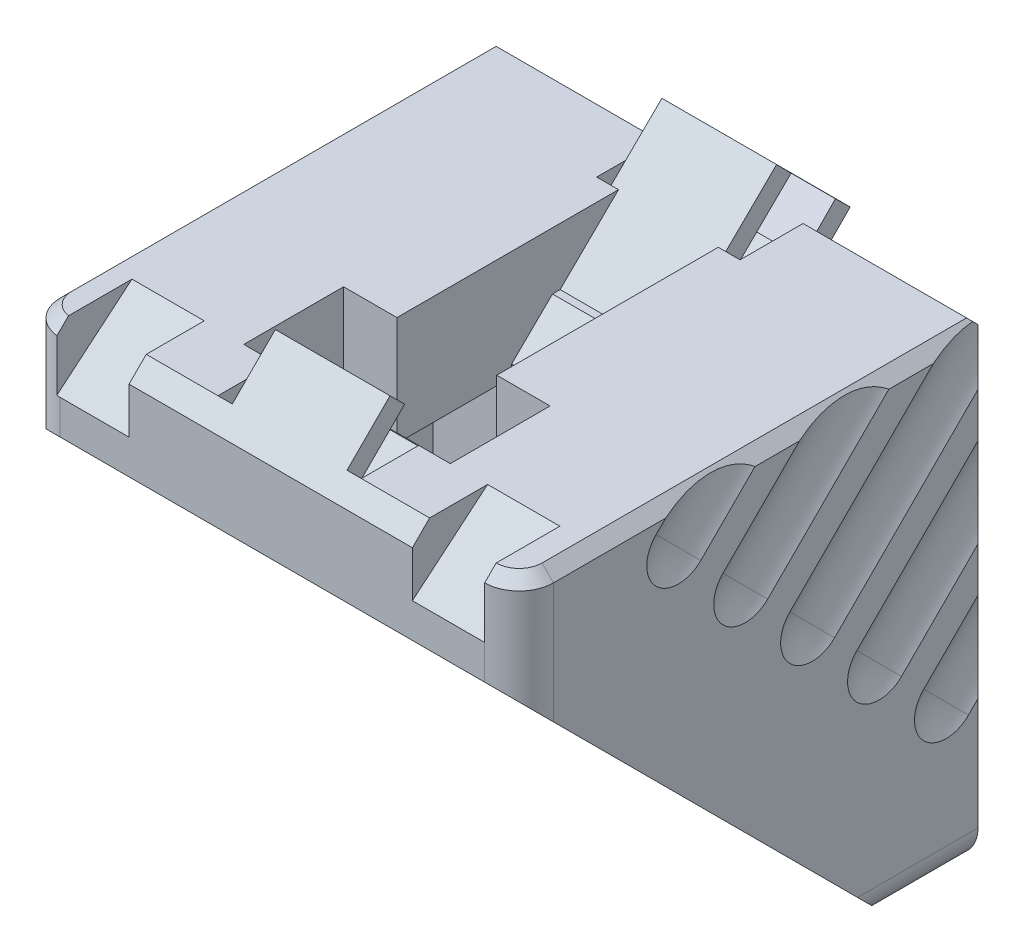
ISO-10303-21;
HEADER;
FILE_DESCRIPTION(('STEP AP214'),'2;1');
FILE_NAME('part.step','',(''),(''),'','','');
FILE_SCHEMA(('AUTOMOTIVE_DESIGN { 1 0 10303 214 1 1 1 1 }'));
ENDSEC;
DATA;
#1=APPLICATION_CONTEXT('core data for automotive mechanical design processes');
#2=APPLICATION_PROTOCOL_DEFINITION('international standard','automotive_design',2000,#1);
#3=PRODUCT_CONTEXT('',#1,'mechanical');
#4=PRODUCT('Part','Part','',(#3));
#5=PRODUCT_RELATED_PRODUCT_CATEGORY('part','',(#4));
#6=PRODUCT_DEFINITION_FORMATION('','',#4);
#7=PRODUCT_DEFINITION_CONTEXT('part definition',#1,'design');
#8=PRODUCT_DEFINITION('design','',#6,#7);
#9=PRODUCT_DEFINITION_SHAPE('','',#8);
#10=(LENGTH_UNIT() NAMED_UNIT(*) SI_UNIT(.MILLI.,.METRE.));
#11=(NAMED_UNIT(*) PLANE_ANGLE_UNIT() SI_UNIT($,.RADIAN.));
#12=(NAMED_UNIT(*) SI_UNIT($,.STERADIAN.) SOLID_ANGLE_UNIT());
#13=UNCERTAINTY_MEASURE_WITH_UNIT(LENGTH_MEASURE(1.E-05),#10,'distance_accuracy_value','');
#14=(GEOMETRIC_REPRESENTATION_CONTEXT(3) GLOBAL_UNCERTAINTY_ASSIGNED_CONTEXT((#13)) GLOBAL_UNIT_ASSIGNED_CONTEXT((#10,
#11,#12)) REPRESENTATION_CONTEXT('',''));
#15=CARTESIAN_POINT('',(0.,0.,0.));
#16=DIRECTION('',(0.,0.,1.));
#17=DIRECTION('',(1.,0.,0.));
#18=AXIS2_PLACEMENT_3D('',#15,#16,#17);
#19=CARTESIAN_POINT('',(5.,-1.27279220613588,38.22720779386));
#20=DIRECTION('',(0.,0.707106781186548,0.707106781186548));
#21=DIRECTION('',(0.,-0.707106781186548,0.707106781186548));
#22=AXIS2_PLACEMENT_3D('',#19,#20,#21);
#23=PLANE('',#22);
#24=DIRECTION('',(0.,0.70710678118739,-0.707106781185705));
#25=VECTOR('',#24,1.);
#26=CARTESIAN_POINT('',(-5.,-1.27279220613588,38.22720779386));
#27=LINE('',#26,#25);
#28=CARTESIAN_POINT('',(-5.,-1.27279220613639,38.2272077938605));
#29=VERTEX_POINT('',#28);
#30=CARTESIAN_POINT('',(-5.,2.47487373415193,34.4795418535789));
#31=VERTEX_POINT('',#30);
#32=EDGE_CURVE('E1501',#29,#31,#27,.T.);
#33=ORIENTED_EDGE('',*,*,#32,.T.);
#34=DIRECTION('',(1.,0.,0.));
#35=VECTOR('',#34,1.);
#36=CARTESIAN_POINT('',(5.,2.47487373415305,34.47954185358));
#37=LINE('',#36,#35);
#38=CARTESIAN_POINT('',(5.,2.47487373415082,34.4795418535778));
#39=VERTEX_POINT('',#38);
#40=EDGE_CURVE('E1493',#31,#39,#37,.T.);
#41=ORIENTED_EDGE('',*,*,#40,.T.);
#42=DIRECTION('',(0.,0.70710678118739,-0.707106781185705));
#43=VECTOR('',#42,1.);
#44=CARTESIAN_POINT('',(5.,-1.27279220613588,38.22720779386));
#45=LINE('',#44,#43);
#46=CARTESIAN_POINT('',(5.,-1.2727922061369,38.227207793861));
#47=VERTEX_POINT('',#46);
#48=EDGE_CURVE('E1488',#47,#39,#45,.T.);
#49=ORIENTED_EDGE('',*,*,#48,.F.);
#50=DIRECTION('',(1.,0.,0.));
#51=VECTOR('',#50,1.);
#52=CARTESIAN_POINT('',(-6.25,-1.27279220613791,38.227207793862));
#53=LINE('',#52,#51);
#54=EDGE_CURVE('E1504',#29,#47,#53,.T.);
#55=ORIENTED_EDGE('',*,*,#54,.F.);
#56=EDGE_LOOP('',(#33,#41,#49,#55));
#57=FACE_BOUND('',#56,.T.);
#58=ADVANCED_FACE('F24',(#57),#23,.F.);
#59=CARTESIAN_POINT('',(-4.35,-4.99999999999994,12.2383741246));
#60=DIRECTION('',(0.,1.,0.));
#61=DIRECTION('',(0.,0.,1.));
#62=AXIS2_PLACEMENT_3D('',#59,#60,#61);
#63=PLANE('',#62);
#64=DIRECTION('',(0.,0.,1.));
#65=VECTOR('',#64,1.);
#66=CARTESIAN_POINT('',(4.35,-4.99999999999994,12.2383741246));
#67=LINE('',#66,#65);
#68=CARTESIAN_POINT('',(4.35,-5.00000000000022,12.2383741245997));
#69=VERTEX_POINT('',#68);
#70=CARTESIAN_POINT('',(4.35,-4.99999999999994,11.57609306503));
#71=VERTEX_POINT('',#70);
#72=EDGE_CURVE('E1553',#69,#71,#67,.F.);
#73=ORIENTED_EDGE('',*,*,#72,.T.);
#74=DIRECTION('',(1.,0.,0.));
#75=VECTOR('',#74,1.);
#76=CARTESIAN_POINT('',(-4.35,-4.99999999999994,11.57609306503));
#77=LINE('',#76,#75);
#78=CARTESIAN_POINT('',(-4.35,-4.99999999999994,11.57609306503));
#79=VERTEX_POINT('',#78);
#80=EDGE_CURVE('E1440',#79,#71,#77,.T.);
#81=ORIENTED_EDGE('',*,*,#80,.F.);
#82=DIRECTION('',(0.,0.,1.));
#83=VECTOR('',#82,1.);
#84=CARTESIAN_POINT('',(-4.35,-4.99999999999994,12.2383741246));
#85=LINE('',#84,#83);
#86=CARTESIAN_POINT('',(-4.35,-5.00000000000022,12.2383741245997));
#87=VERTEX_POINT('',#86);
#88=EDGE_CURVE('E1556',#79,#87,#85,.T.);
#89=ORIENTED_EDGE('',*,*,#88,.T.);
#90=DIRECTION('',(1.,0.,0.));
#91=VECTOR('',#90,1.);
#92=CARTESIAN_POINT('',(-4.35,-5.00000000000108,12.2383741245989));
#93=LINE('',#92,#91);
#94=EDGE_CURVE('E1456',#69,#87,#93,.F.);
#95=ORIENTED_EDGE('',*,*,#94,.F.);
#96=EDGE_LOOP('',(#73,#81,#89,#95));
#97=FACE_BOUND('',#96,.T.);
#98=ADVANCED_FACE('F2295',(#97),#63,.T.);
#99=CARTESIAN_POINT('',(-4.35,-9.49999999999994,15.8));
#100=DIRECTION('',(0.,0.,1.));
#101=DIRECTION('',(1.,0.,0.));
#102=AXIS2_PLACEMENT_3D('',#99,#100,#101);
#103=PLANE('',#102);
#104=DIRECTION('',(1.,0.,0.));
#105=VECTOR('',#104,1.);
#106=CARTESIAN_POINT('',(-4.35,-8.49999999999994,15.8));
#107=LINE('',#106,#105);
#108=CARTESIAN_POINT('',(-4.35,-8.49999999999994,15.8));
#109=VERTEX_POINT('',#108);
#110=CARTESIAN_POINT('',(4.35,-8.49999999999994,15.8));
#111=VERTEX_POINT('',#110);
#112=EDGE_CURVE('E1460',#109,#111,#107,.T.);
#113=ORIENTED_EDGE('',*,*,#112,.F.);
#114=DIRECTION('',(0.,1.,0.));
#115=VECTOR('',#114,1.);
#116=CARTESIAN_POINT('',(-4.35,-9.49999999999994,15.8));
#117=LINE('',#116,#115);
#118=CARTESIAN_POINT('',(-4.35,-9.49999999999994,15.8));
#119=VERTEX_POINT('',#118);
#120=EDGE_CURVE('E1547',#109,#119,#117,.F.);
#121=ORIENTED_EDGE('',*,*,#120,.T.);
#122=DIRECTION('',(1.,0.,0.));
#123=VECTOR('',#122,1.);
#124=CARTESIAN_POINT('',(-17.5,-9.49999999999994,15.8));
#125=LINE('',#124,#123);
#126=CARTESIAN_POINT('',(4.35,-9.49999999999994,15.8));
#127=VERTEX_POINT('',#126);
#128=EDGE_CURVE('E1177',#127,#119,#125,.F.);
#129=ORIENTED_EDGE('',*,*,#128,.F.);
#130=DIRECTION('',(0.,1.,0.));
#131=VECTOR('',#130,1.);
#132=CARTESIAN_POINT('',(4.35,-9.49999999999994,15.8));
#133=LINE('',#132,#131);
#134=EDGE_CURVE('E1550',#127,#111,#133,.T.);
#135=ORIENTED_EDGE('',*,*,#134,.T.);
#136=EDGE_LOOP('',(#113,#121,#129,#135));
#137=FACE_BOUND('',#136,.T.);
#138=ADVANCED_FACE('F2288',(#137),#103,.T.);
#139=CARTESIAN_POINT('',(5.,3.07296224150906,0.7928942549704));
#140=DIRECTION('',(0.,-0.700909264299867,0.713250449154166));
#141=DIRECTION('',(0.,-0.713250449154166,-0.700909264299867));
#142=AXIS2_PLACEMENT_3D('',#139,#140,#141);
#143=PLANE('',#142);
#144=DIRECTION('',(1.,0.,0.));
#145=VECTOR('',#144,1.);
#146=CARTESIAN_POINT('',(5.,3.07296224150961,0.792894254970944));
#147=LINE('',#146,#145);
#148=CARTESIAN_POINT('',(5.,3.0729622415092,0.792894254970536));
#149=VERTEX_POINT('',#148);
#150=CARTESIAN_POINT('',(-5.,3.0729622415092,0.792894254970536));
#151=VERTEX_POINT('',#150);
#152=EDGE_CURVE('E1116',#149,#151,#147,.F.);
#153=ORIENTED_EDGE('',*,*,#152,.T.);
#154=DIRECTION('',(0.,0.713250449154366,0.700909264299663));
#155=VECTOR('',#154,1.);
#156=CARTESIAN_POINT('',(-5.,3.07296224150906,0.7928942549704));
#157=LINE('',#156,#155);
#158=CARTESIAN_POINT('',(-5.,4.35681304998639,2.05453093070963));
#159=VERTEX_POINT('',#158);
#160=EDGE_CURVE('E1127',#151,#159,#157,.T.);
#161=ORIENTED_EDGE('',*,*,#160,.T.);
#162=DIRECTION('',(1.,0.,0.));
#163=VECTOR('',#162,1.);
#164=CARTESIAN_POINT('',(-4.35,4.35681304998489,2.0545309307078));
#165=LINE('',#164,#163);
#166=CARTESIAN_POINT('',(5.,4.35681304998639,2.05453093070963));
#167=VERTEX_POINT('',#166);
#168=EDGE_CURVE('E1449',#167,#159,#165,.F.);
#169=ORIENTED_EDGE('',*,*,#168,.F.);
#170=DIRECTION('',(0.,0.713250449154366,0.700909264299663));
#171=VECTOR('',#170,1.);
#172=CARTESIAN_POINT('',(5.,3.07296224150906,0.7928942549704));
#173=LINE('',#172,#171);
#174=EDGE_CURVE('E1134',#149,#167,#173,.T.);
#175=ORIENTED_EDGE('',*,*,#174,.F.);
#176=EDGE_LOOP('',(#153,#161,#169,#175));
#177=FACE_BOUND('',#176,.T.);
#178=ADVANCED_FACE('F2281',(#177),#143,.F.);
#179=CARTESIAN_POINT('',(-6.25,0.,39.5));
#180=DIRECTION('',(0.,0.707106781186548,-0.707106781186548));
#181=DIRECTION('',(0.,0.707106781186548,0.707106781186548));
#182=AXIS2_PLACEMENT_3D('',#179,#180,#181);
#183=PLANE('',#182);
#184=DIRECTION('',(0.,-0.70710678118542,-0.707106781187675));
#185=VECTOR('',#184,1.);
#186=CARTESIAN_POINT('',(-5.,0.,39.5));
#187=LINE('',#186,#185);
#188=CARTESIAN_POINT('',(-5.,0.,39.5));
#189=VERTEX_POINT('',#188);
#190=EDGE_CURVE('E1500',#189,#29,#187,.T.);
#191=ORIENTED_EDGE('',*,*,#190,.T.);
#192=ORIENTED_EDGE('',*,*,#54,.T.);
#193=DIRECTION('',(0.,-0.70710678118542,-0.707106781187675));
#194=VECTOR('',#193,1.);
#195=CARTESIAN_POINT('',(5.,0.,39.5));
#196=LINE('',#195,#194);
#197=CARTESIAN_POINT('',(5.00000000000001,0.,39.5));
#198=VERTEX_POINT('',#197);
#199=EDGE_CURVE('E1492',#198,#47,#196,.T.);
#200=ORIENTED_EDGE('',*,*,#199,.F.);
#201=DIRECTION('',(1.,0.,0.));
#202=VECTOR('',#201,1.);
#203=CARTESIAN_POINT('',(-6.25,0.,39.5));
#204=LINE('',#203,#202);
#205=CARTESIAN_POINT('',(6.25,0.,39.5));
#206=VERTEX_POINT('',#205);
#207=EDGE_CURVE('E1515',#198,#206,#204,.T.);
#208=ORIENTED_EDGE('',*,*,#207,.T.);
#209=DIRECTION('',(0.,0.707106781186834,0.707106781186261));
#210=VECTOR('',#209,1.);
#211=CARTESIAN_POINT('',(6.25,-2.46621059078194,37.03378940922));
#212=LINE('',#211,#210);
#213=CARTESIAN_POINT('',(6.25000000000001,-2.46621059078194,37.03378940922));
#214=VERTEX_POINT('',#213);
#215=EDGE_CURVE('E1050',#214,#206,#212,.T.);
#216=ORIENTED_EDGE('',*,*,#215,.F.);
#217=DIRECTION('',(1.,0.,0.));
#218=VECTOR('',#217,1.);
#219=CARTESIAN_POINT('',(-6.25,-2.46621059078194,37.03378940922));
#220=LINE('',#219,#218);
#221=CARTESIAN_POINT('',(-6.25,-2.46621059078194,37.03378940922));
#222=VERTEX_POINT('',#221);
#223=EDGE_CURVE('E1042',#222,#214,#220,.T.);
#224=ORIENTED_EDGE('',*,*,#223,.F.);
#225=DIRECTION('',(0.,0.707106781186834,0.707106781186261));
#226=VECTOR('',#225,1.);
#227=CARTESIAN_POINT('',(-6.25,-2.46621059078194,37.03378940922));
#228=LINE('',#227,#226);
#229=CARTESIAN_POINT('',(-6.25,0.,39.5));
#230=VERTEX_POINT('',#229);
#231=EDGE_CURVE('E1020',#222,#230,#228,.T.);
#232=ORIENTED_EDGE('',*,*,#231,.T.);
#233=DIRECTION('',(1.,0.,0.));
#234=VECTOR('',#233,1.);
#235=CARTESIAN_POINT('',(-6.25,0.,39.5));
#236=LINE('',#235,#234);
#237=EDGE_CURVE('E1512',#230,#189,#236,.T.);
#238=ORIENTED_EDGE('',*,*,#237,.T.);
#239=EDGE_LOOP('',(#191,#192,#200,#208,#216,#224,#232,#238));
#240=FACE_BOUND('',#239,.T.);
#241=ADVANCED_FACE('F2274',(#240),#183,.T.);
#242=CARTESIAN_POINT('',(-5.,0.,0.));
#243=DIRECTION('',(1.,0.,0.));
#244=DIRECTION('',(0.,1.,0.));
#245=AXIS2_PLACEMENT_3D('',#242,#243,#244);
#246=PLANE('',#245);
#247=DIRECTION('',(0.,0.707106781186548,-0.707106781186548));
#248=VECTOR('',#247,1.);
#249=CARTESIAN_POINT('',(-5.00000000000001,-1.49999999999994,41.));
#250=LINE('',#249,#248);
#251=CARTESIAN_POINT('',(-5.,3.74766594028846,35.7523340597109));
#252=VERTEX_POINT('',#251);
#253=EDGE_CURVE('E1013',#189,#252,#250,.T.);
#254=ORIENTED_EDGE('',*,*,#253,.T.);
#255=DIRECTION('',(0.,-0.707106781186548,-0.707106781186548));
#256=VECTOR('',#255,1.);
#257=CARTESIAN_POINT('',(-5.,2.47487373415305,34.47954185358));
#258=LINE('',#257,#256);
#259=EDGE_CURVE('E1496',#252,#31,#258,.T.);
#260=ORIENTED_EDGE('',*,*,#259,.T.);
#261=ORIENTED_EDGE('',*,*,#32,.F.);
#262=ORIENTED_EDGE('',*,*,#190,.F.);
#263=EDGE_LOOP('',(#254,#260,#261,#262));
#264=FACE_BOUND('',#263,.T.);
#265=ADVANCED_FACE('F2267',(#264),#246,.F.);
#266=CARTESIAN_POINT('',(5.,2.47487373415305,34.47954185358));
#267=DIRECTION('',(0.,-0.707106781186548,0.707106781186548));
#268=DIRECTION('',(0.,-0.707106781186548,-0.707106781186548));
#269=AXIS2_PLACEMENT_3D('',#266,#267,#268);
#270=PLANE('',#269);
#271=ORIENTED_EDGE('',*,*,#40,.F.);
#272=ORIENTED_EDGE('',*,*,#259,.F.);
#273=DIRECTION('',(1.,0.,0.));
#274=VECTOR('',#273,1.);
#275=CARTESIAN_POINT('',(12.2,3.74766594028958,35.7523340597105));
#276=LINE('',#275,#274);
#277=CARTESIAN_POINT('',(5.,3.74766594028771,35.7523340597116));
#278=VERTEX_POINT('',#277);
#279=EDGE_CURVE('E1010',#252,#278,#276,.T.);
#280=ORIENTED_EDGE('',*,*,#279,.T.);
#281=DIRECTION('',(0.,0.707106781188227,0.707106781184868));
#282=VECTOR('',#281,1.);
#283=CARTESIAN_POINT('',(5.,2.47487373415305,34.47954185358));
#284=LINE('',#283,#282);
#285=EDGE_CURVE('E1473',#39,#278,#284,.T.);
#286=ORIENTED_EDGE('',*,*,#285,.F.);
#287=EDGE_LOOP('',(#271,#272,#280,#286));
#288=FACE_BOUND('',#287,.T.);
#289=ADVANCED_FACE('F2260',(#288),#270,.F.);
#290=CARTESIAN_POINT('',(5.,0.,0.));
#291=DIRECTION('',(1.,0.,0.));
#292=DIRECTION('',(0.,1.,0.));
#293=AXIS2_PLACEMENT_3D('',#290,#291,#292);
#294=PLANE('',#293);
#295=ORIENTED_EDGE('',*,*,#285,.T.);
#296=DIRECTION('',(0.,0.707106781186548,-0.707106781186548));
#297=VECTOR('',#296,1.);
#298=CARTESIAN_POINT('',(5.,-1.49999999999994,41.));
#299=LINE('',#298,#297);
#300=EDGE_CURVE('E1002',#278,#198,#299,.F.);
#301=ORIENTED_EDGE('',*,*,#300,.T.);
#302=ORIENTED_EDGE('',*,*,#199,.T.);
#303=ORIENTED_EDGE('',*,*,#48,.T.);
#304=EDGE_LOOP('',(#295,#301,#302,#303));
#305=FACE_BOUND('',#304,.T.);
#306=ADVANCED_FACE('F2253',(#305),#294,.T.);
#307=CARTESIAN_POINT('',(21.5,0.,41.));
#308=DIRECTION('',(0.,0.,-1.));
#309=DIRECTION('',(-1.,0.,0.));
#310=AXIS2_PLACEMENT_3D('',#307,#308,#309);
#311=PLANE('',#310);
#312=DIRECTION('',(1.,0.,0.));
#313=VECTOR('',#312,1.);
#314=CARTESIAN_POINT('',(-25.8,-8.49999999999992,41.));
#315=LINE('',#314,#313);
#316=CARTESIAN_POINT('',(-18.5,-8.49999999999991,41.));
#317=VERTEX_POINT('',#316);
#318=CARTESIAN_POINT('',(18.5,-8.49999999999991,41.));
#319=VERTEX_POINT('',#318);
#320=EDGE_CURVE('E1193',#317,#319,#315,.T.);
#321=ORIENTED_EDGE('',*,*,#320,.T.);
#322=DIRECTION('',(0.,1.,0.));
#323=VECTOR('',#322,1.);
#324=CARTESIAN_POINT('',(18.5,-24.9362430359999,41.));
#325=LINE('',#324,#323);
#326=CARTESIAN_POINT('',(18.5,-5.49999999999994,41.));
#327=VERTEX_POINT('',#326);
#328=EDGE_CURVE('E1428',#327,#319,#325,.F.);
#329=ORIENTED_EDGE('',*,*,#328,.F.);
#330=DIRECTION('',(1.,0.,0.));
#331=VECTOR('',#330,1.);
#332=CARTESIAN_POINT('',(12.2,-5.49999999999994,41.));
#333=LINE('',#332,#331);
#334=CARTESIAN_POINT('',(12.2,-5.49999999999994,41.));
#335=VERTEX_POINT('',#334);
#336=EDGE_CURVE('E1089',#335,#327,#333,.T.);
#337=ORIENTED_EDGE('',*,*,#336,.F.);
#338=DIRECTION('',(0.,1.,0.));
#339=VECTOR('',#338,1.);
#340=CARTESIAN_POINT('',(12.2,0.,41.));
#341=LINE('',#340,#339);
#342=CARTESIAN_POINT('',(12.2,-1.49999999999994,41.));
#343=VERTEX_POINT('',#342);
#344=EDGE_CURVE('E1077',#343,#335,#341,.F.);
#345=ORIENTED_EDGE('',*,*,#344,.F.);
#346=DIRECTION('',(1.,0.,0.));
#347=VECTOR('',#346,1.);
#348=CARTESIAN_POINT('',(12.2,-1.49999999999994,41.));
#349=LINE('',#348,#347);
#350=CARTESIAN_POINT('',(-12.5,-1.49999999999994,41.));
#351=VERTEX_POINT('',#350);
#352=EDGE_CURVE('E1066',#343,#351,#349,.F.);
#353=ORIENTED_EDGE('',*,*,#352,.T.);
#354=DIRECTION('',(0.,1.,0.));
#355=VECTOR('',#354,1.);
#356=CARTESIAN_POINT('',(-12.5,0.,41.));
#357=LINE('',#356,#355);
#358=CARTESIAN_POINT('',(-12.5,-5.49999999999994,41.));
#359=VERTEX_POINT('',#358);
#360=EDGE_CURVE('E984',#351,#359,#357,.F.);
#361=ORIENTED_EDGE('',*,*,#360,.T.);
#362=DIRECTION('',(1.,0.,0.));
#363=VECTOR('',#362,1.);
#364=CARTESIAN_POINT('',(-12.5,-5.49999999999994,41.));
#365=LINE('',#364,#363);
#366=CARTESIAN_POINT('',(-18.5,-5.49999999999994,41.));
#367=VERTEX_POINT('',#366);
#368=EDGE_CURVE('E979',#367,#359,#365,.T.);
#369=ORIENTED_EDGE('',*,*,#368,.F.);
#370=DIRECTION('',(0.,-1.,0.));
#371=VECTOR('',#370,1.);
#372=CARTESIAN_POINT('',(-18.5,0.17291103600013,41.));
#373=LINE('',#372,#371);
#374=EDGE_CURVE('E1383',#317,#367,#373,.F.);
#375=ORIENTED_EDGE('',*,*,#374,.F.);
#376=EDGE_LOOP('',(#321,#329,#337,#345,#353,#361,#369,#375));
#377=FACE_BOUND('',#376,.T.);
#378=ADVANCED_FACE('F2246',(#377),#311,.F.);
#379=CARTESIAN_POINT('',(-4.35,-8.49999999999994,15.8));
#380=DIRECTION('',(0.,0.713250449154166,0.700909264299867));
#381=DIRECTION('',(0.,-0.700909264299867,0.713250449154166));
#382=AXIS2_PLACEMENT_3D('',#379,#380,#381);
#383=PLANE('',#382);
#384=DIRECTION('',(0.,0.700909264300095,-0.713250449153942));
#385=VECTOR('',#384,1.);
#386=CARTESIAN_POINT('',(4.35,-8.49999999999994,15.8));
#387=LINE('',#386,#385);
#388=EDGE_CURVE('E3633',#111,#69,#387,.T.);
#389=ORIENTED_EDGE('',*,*,#388,.T.);
#390=ORIENTED_EDGE('',*,*,#94,.T.);
#391=DIRECTION('',(0.,0.700909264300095,-0.713250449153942));
#392=VECTOR('',#391,1.);
#393=CARTESIAN_POINT('',(-4.35,-8.49999999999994,15.8));
#394=LINE('',#393,#392);
#395=EDGE_CURVE('E3687',#109,#87,#394,.T.);
#396=ORIENTED_EDGE('',*,*,#395,.F.);
#397=ORIENTED_EDGE('',*,*,#112,.T.);
#398=EDGE_LOOP('',(#389,#390,#396,#397));
#399=FACE_BOUND('',#398,.T.);
#400=ADVANCED_FACE('F2242',(#399),#383,.T.);
#401=CARTESIAN_POINT('',(-4.35,-4.99999999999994,11.57609306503));
#402=DIRECTION('',(0.,0.713250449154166,0.700909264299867));
#403=DIRECTION('',(0.,-0.700909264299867,0.713250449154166));
#404=AXIS2_PLACEMENT_3D('',#401,#402,#403);
#405=PLANE('',#404);
#406=DIRECTION('',(0.,0.700909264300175,-0.713250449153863));
#407=VECTOR('',#406,1.);
#408=CARTESIAN_POINT('',(-4.35,-4.99999999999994,11.57609306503));
#409=LINE('',#408,#407);
#410=CARTESIAN_POINT('',(-4.35,-1.04095252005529E-12,6.48805610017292));
#411=VERTEX_POINT('',#410);
#412=EDGE_CURVE('E3684',#79,#411,#409,.T.);
#413=ORIENTED_EDGE('',*,*,#412,.F.);
#414=ORIENTED_EDGE('',*,*,#80,.T.);
#415=DIRECTION('',(0.,0.700909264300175,-0.713250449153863));
#416=VECTOR('',#415,1.);
#417=CARTESIAN_POINT('',(4.35,-4.99999999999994,11.57609306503));
#418=LINE('',#417,#416);
#419=CARTESIAN_POINT('',(4.35,-1.04146280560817E-12,6.48805610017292));
#420=VERTEX_POINT('',#419);
#421=EDGE_CURVE('E3630',#71,#420,#418,.T.);
#422=ORIENTED_EDGE('',*,*,#421,.T.);
#423=DIRECTION('',(1.,0.,0.));
#424=VECTOR('',#423,1.);
#425=CARTESIAN_POINT('',(-4.35,-2.14064876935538E-12,6.48805610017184));
#426=LINE('',#425,#424);
#427=CARTESIAN_POINT('',(5.,-1.04207971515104E-12,6.48805610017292));
#428=VERTEX_POINT('',#427);
#429=EDGE_CURVE('E1453',#420,#428,#426,.T.);
#430=ORIENTED_EDGE('',*,*,#429,.T.);
#431=DIRECTION('',(0.,-0.700909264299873,0.71325044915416));
#432=VECTOR('',#431,1.);
#433=CARTESIAN_POINT('',(5.,4.35681304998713,2.05453093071));
#434=LINE('',#433,#432);
#435=EDGE_CURVE('E1130',#167,#428,#434,.T.);
#436=ORIENTED_EDGE('',*,*,#435,.F.);
#437=ORIENTED_EDGE('',*,*,#168,.T.);
#438=DIRECTION('',(0.,-0.700909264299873,0.71325044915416));
#439=VECTOR('',#438,1.);
#440=CARTESIAN_POINT('',(-5.,4.35681304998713,2.05453093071));
#441=LINE('',#440,#439);
#442=CARTESIAN_POINT('',(-5.,-1.04120415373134E-12,6.48805610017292));
#443=VERTEX_POINT('',#442);
#444=EDGE_CURVE('E1123',#159,#443,#441,.T.);
#445=ORIENTED_EDGE('',*,*,#444,.T.);
#446=DIRECTION('',(1.,0.,0.));
#447=VECTOR('',#446,1.);
#448=CARTESIAN_POINT('',(-4.35,-2.13978140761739E-12,6.48805610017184));
#449=LINE('',#448,#447);
#450=EDGE_CURVE('E1446',#443,#411,#449,.T.);
#451=ORIENTED_EDGE('',*,*,#450,.T.);
#452=EDGE_LOOP('',(#413,#414,#422,#430,#436,#437,#445,#451));
#453=FACE_BOUND('',#452,.T.);
#454=ADVANCED_FACE('F2236',(#453),#405,.T.);
#455=CARTESIAN_POINT('',(18.5,-24.9362430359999,38.));
#456=DIRECTION('',(0.,1.,0.));
#457=DIRECTION('',(-1.,0.,0.));
#458=AXIS2_PLACEMENT_3D('',#455,#456,#457);
#459=CYLINDRICAL_SURFACE('',#458,3.);
#460=ORIENTED_EDGE('',*,*,#328,.T.);
#461=CARTESIAN_POINT('',(18.5,-11.4999999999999,38.));
#462=DIRECTION('',(0.,0.707106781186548,-0.707106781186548));
#463=DIRECTION('',(0.,0.707106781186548,0.707106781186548));
#464=AXIS2_PLACEMENT_3D('',#461,#462,#463);
#465=ELLIPSE('',#464,4.24264068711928,3.);
#466=CARTESIAN_POINT('',(21.5,-11.4999999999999,38.));
#467=VERTEX_POINT('',#466);
#468=EDGE_CURVE('E1192',#319,#467,#465,.T.);
#469=ORIENTED_EDGE('',*,*,#468,.T.);
#470=DIRECTION('',(0.,-1.,0.));
#471=VECTOR('',#470,1.);
#472=CARTESIAN_POINT('',(21.5,0.,38.));
#473=LINE('',#472,#471);
#474=CARTESIAN_POINT('',(21.50000000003,-0.999999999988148,38.));
#475=VERTEX_POINT('',#474);
#476=EDGE_CURVE('E1331',#467,#475,#473,.F.);
#477=ORIENTED_EDGE('',*,*,#476,.T.);
#478=CARTESIAN_POINT('',(18.5,-0.999999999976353,38.));
#479=DIRECTION('',(0.,-1.,0.));
#480=DIRECTION('',(1.,0.,0.));
#481=AXIS2_PLACEMENT_3D('',#478,#479,#480);
#482=CIRCLE('',#481,3.00000000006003);
#483=CARTESIAN_POINT('',(18.5,-0.999999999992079,41.00000000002));
#484=VERTEX_POINT('',#483);
#485=EDGE_CURVE('E1103',#484,#475,#482,.F.);
#486=ORIENTED_EDGE('',*,*,#485,.F.);
#487=DIRECTION('',(0.,1.,0.));
#488=VECTOR('',#487,1.);
#489=CARTESIAN_POINT('',(18.5,0.,41.));
#490=LINE('',#489,#488);
#491=EDGE_CURVE('E1096',#484,#327,#490,.F.);
#492=ORIENTED_EDGE('',*,*,#491,.T.);
#493=EDGE_LOOP('',(#460,#469,#477,#486,#492));
#494=FACE_BOUND('',#493,.T.);
#495=ADVANCED_FACE('F1416',(#494),#459,.T.);
#496=CARTESIAN_POINT('',(26.26,-3.77918098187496,27.11370476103));
#497=DIRECTION('',(-1.,1.67219773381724E-13,1.67300516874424E-13));
#498=DIRECTION('',(-2.36541565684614E-13,-0.707106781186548,-0.707106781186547));
#499=AXIS2_PLACEMENT_3D('',#496,#497,#498);
#500=SPHERICAL_SURFACE('',#499,5.5);
#501=CARTESIAN_POINT('',(21.5,-3.77918098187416,27.1137047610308));
#502=DIRECTION('',(-1.,1.67219773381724E-13,1.67300516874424E-13));
#503=DIRECTION('',(1.67300516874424E-13,0.,1.));
#504=AXIS2_PLACEMENT_3D('',#501,#502,#503);
#505=CIRCLE('',#504,2.7554310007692);
#506=CARTESIAN_POINT('',(21.5,-1.83079703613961,29.0620887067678));
#507=VERTEX_POINT('',#506);
#508=CARTESIAN_POINT('',(21.4999999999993,-5.72756492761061,25.1653208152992));
#509=VERTEX_POINT('',#508);
#510=EDGE_CURVE('E1434',#507,#509,#505,.F.);
#511=ORIENTED_EDGE('',*,*,#510,.T.);
#512=CARTESIAN_POINT('',(26.26,-3.77918098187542,27.1137047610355));
#513=DIRECTION('',(0.,0.707106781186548,-0.707106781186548));
#514=DIRECTION('',(0.,0.707106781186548,0.707106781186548));
#515=AXIS2_PLACEMENT_3D('',#512,#513,#514);
#516=CIRCLE('',#515,5.5);
#517=CARTESIAN_POINT('',(20.76,-3.77918098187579,27.1137047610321));
#518=VERTEX_POINT('',#517);
#519=EDGE_CURVE('E1427',#509,#518,#516,.T.);
#520=ORIENTED_EDGE('',*,*,#519,.T.);
#521=CARTESIAN_POINT('',(26.26,-3.77918098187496,27.11370476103));
#522=DIRECTION('',(0.,0.707106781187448,-0.707106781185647));
#523=DIRECTION('',(-1.,1.67196433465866E-13,1.67436771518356E-13));
#524=AXIS2_PLACEMENT_3D('',#521,#522,#523);
#525=CIRCLE('',#524,5.5);
#526=EDGE_CURVE('E1424',#507,#518,#525,.F.);
#527=ORIENTED_EDGE('',*,*,#526,.F.);
#528=EDGE_LOOP('',(#511,#520,#527));
#529=FACE_BOUND('',#528,.T.);
#530=ADVANCED_FACE('F1411',(#529),#500,.F.);
#531=CARTESIAN_POINT('',(26.26,-6.59730626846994,29.93183004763));
#532=DIRECTION('',(0.,0.707106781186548,-0.707106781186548));
#533=DIRECTION('',(0.,0.707106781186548,0.707106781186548));
#534=AXIS2_PLACEMENT_3D('',#531,#532,#533);
#535=CYLINDRICAL_SURFACE('',#534,5.5);
#536=ORIENTED_EDGE('',*,*,#519,.F.);
#537=DIRECTION('',(0.,0.707106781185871,-0.707106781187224));
#538=VECTOR('',#537,1.);
#539=CARTESIAN_POINT('',(21.5,-5.7275649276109,25.1653208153));
#540=LINE('',#539,#538);
#541=CARTESIAN_POINT('',(21.5,-0.999999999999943,20.4377558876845));
#542=VERTEX_POINT('',#541);
#543=EDGE_CURVE('E3174',#509,#542,#540,.T.);
#544=ORIENTED_EDGE('',*,*,#543,.T.);
#545=CARTESIAN_POINT('',(26.26,-5.75999999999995,29.09452377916));
#546=DIRECTION('',(-0.707106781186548,-0.707106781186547,0.));
#547=DIRECTION('',(-0.408248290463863,0.408248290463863,-0.816496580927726));
#548=AXIS2_PLACEMENT_3D('',#545,#546,#547);
#549=ELLIPSE('',#548,11.,5.5);
#550=CARTESIAN_POINT('',(21.4999999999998,-0.999999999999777,28.2312916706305));
#551=VERTEX_POINT('',#550);
#552=EDGE_CURVE('E1541',#542,#551,#549,.F.);
#553=ORIENTED_EDGE('',*,*,#552,.T.);
#554=DIRECTION('',(0.,0.707106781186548,-0.707106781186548));
#555=VECTOR('',#554,1.);
#556=CARTESIAN_POINT('',(21.4999999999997,-4.6489223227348,31.8802139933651));
#557=LINE('',#556,#555);
#558=EDGE_CURVE('E1525',#507,#551,#557,.T.);
#559=ORIENTED_EDGE('',*,*,#558,.F.);
#560=ORIENTED_EDGE('',*,*,#526,.T.);
#561=EDGE_LOOP('',(#536,#544,#553,#559,#560));
#562=FACE_BOUND('',#561,.T.);
#563=ADVANCED_FACE('F1407',(#562),#535,.F.);
#564=CARTESIAN_POINT('',(26.26,-9.61281192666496,21.28007381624));
#565=DIRECTION('',(-1.,2.07026315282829E-13,2.06703341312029E-13));
#566=DIRECTION('',(-2.92551045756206E-13,-0.707106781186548,-0.707106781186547));
#567=AXIS2_PLACEMENT_3D('',#564,#565,#566);
#568=SPHERICAL_SURFACE('',#567,5.5);
#569=CARTESIAN_POINT('',(21.5,-9.61281192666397,21.280073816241));
#570=DIRECTION('',(-1.,2.07026315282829E-13,2.06703341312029E-13));
#571=DIRECTION('',(-2.07026315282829E-13,-1.,0.));
#572=AXIS2_PLACEMENT_3D('',#569,#570,#571);
#573=CIRCLE('',#572,2.7554310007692);
#574=CARTESIAN_POINT('',(21.5,-7.66442798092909,23.2284577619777));
#575=VERTEX_POINT('',#574);
#576=CARTESIAN_POINT('',(21.4999999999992,-11.5611958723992,19.3316898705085));
#577=VERTEX_POINT('',#576);
#578=EDGE_CURVE('E3169',#575,#577,#573,.F.);
#579=ORIENTED_EDGE('',*,*,#578,.T.);
#580=CARTESIAN_POINT('',(26.26,-9.6128119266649,21.280073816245));
#581=DIRECTION('',(0.,0.707106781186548,-0.707106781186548));
#582=DIRECTION('',(0.,0.707106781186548,0.707106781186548));
#583=AXIS2_PLACEMENT_3D('',#580,#581,#582);
#584=CIRCLE('',#583,5.5);
#585=CARTESIAN_POINT('',(20.76,-9.61281192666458,21.2800738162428));
#586=VERTEX_POINT('',#585);
#587=EDGE_CURVE('E1384',#577,#586,#584,.T.);
#588=ORIENTED_EDGE('',*,*,#587,.T.);
#589=CARTESIAN_POINT('',(26.26,-9.61281192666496,21.28007381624));
#590=DIRECTION('',(0.,0.707106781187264,-0.707106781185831));
#591=DIRECTION('',(-1.,2.07147430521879E-13,2.06501482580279E-13));
#592=AXIS2_PLACEMENT_3D('',#589,#590,#591);
#593=CIRCLE('',#592,5.5);
#594=EDGE_CURVE('E1396',#575,#586,#593,.F.);
#595=ORIENTED_EDGE('',*,*,#594,.F.);
#596=EDGE_LOOP('',(#579,#588,#595));
#597=FACE_BOUND('',#596,.T.);
#598=ADVANCED_FACE('F1403',(#597),#568,.F.);
#599=CARTESIAN_POINT('',(26.26,-12.4309372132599,24.09819910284));
#600=DIRECTION('',(0.,0.707106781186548,-0.707106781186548));
#601=DIRECTION('',(0.,0.707106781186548,0.707106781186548));
#602=AXIS2_PLACEMENT_3D('',#599,#600,#601);
#603=CYLINDRICAL_SURFACE('',#602,5.5);
#604=ORIENTED_EDGE('',*,*,#587,.F.);
#605=DIRECTION('',(0.,0.707106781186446,-0.707106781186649));
#606=VECTOR('',#605,1.);
#607=CARTESIAN_POINT('',(21.5,-11.5611958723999,19.33168987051));
#608=LINE('',#607,#606);
#609=CARTESIAN_POINT('',(21.5,-0.999999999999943,8.77049399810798));
#610=VERTEX_POINT('',#609);
#611=EDGE_CURVE('E1392',#577,#610,#608,.T.);
#612=ORIENTED_EDGE('',*,*,#611,.T.);
#613=CARTESIAN_POINT('',(26.26,-5.75999999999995,17.4272618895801));
#614=DIRECTION('',(-0.707106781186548,-0.707106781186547,0.));
#615=DIRECTION('',(-0.408248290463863,0.408248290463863,-0.816496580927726));
#616=AXIS2_PLACEMENT_3D('',#613,#614,#615);
#617=ELLIPSE('',#616,11.,5.5);
#618=CARTESIAN_POINT('',(21.5,-0.999999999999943,16.5640297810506));
#619=VERTEX_POINT('',#618);
#620=EDGE_CURVE('E3050',#610,#619,#617,.F.);
#621=ORIENTED_EDGE('',*,*,#620,.T.);
#622=DIRECTION('',(0.,-0.707106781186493,0.707106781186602));
#623=VECTOR('',#622,1.);
#624=CARTESIAN_POINT('',(21.5,-0.999999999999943,16.56402978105));
#625=LINE('',#624,#623);
#626=EDGE_CURVE('E3172',#619,#575,#625,.T.);
#627=ORIENTED_EDGE('',*,*,#626,.T.);
#628=ORIENTED_EDGE('',*,*,#594,.T.);
#629=EDGE_LOOP('',(#604,#612,#621,#627,#628));
#630=FACE_BOUND('',#629,.T.);
#631=ADVANCED_FACE('F1406',(#630),#603,.F.);
#632=CARTESIAN_POINT('',(26.26,-15.44644287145,15.44644287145));
#633=DIRECTION('',(-1.,0.,0.));
#634=DIRECTION('',(0.,0.707106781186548,0.707106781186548));
#635=AXIS2_PLACEMENT_3D('',#632,#633,#634);
#636=SPHERICAL_SURFACE('',#635,5.5);
#637=CARTESIAN_POINT('',(21.5,-15.44644287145,15.44644287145));
#638=DIRECTION('',(-1.,0.,0.));
#639=DIRECTION('',(0.,0.,1.));
#640=AXIS2_PLACEMENT_3D('',#637,#638,#639);
#641=CIRCLE('',#640,2.7554310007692);
#642=CARTESIAN_POINT('',(21.5,-13.4980589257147,17.3948268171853));
#643=VERTEX_POINT('',#642);
#644=CARTESIAN_POINT('',(21.5,-17.3948268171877,13.4980589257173));
#645=VERTEX_POINT('',#644);
#646=EDGE_CURVE('E3165',#643,#645,#641,.F.);
#647=ORIENTED_EDGE('',*,*,#646,.T.);
#648=CARTESIAN_POINT('',(26.26,-15.4464428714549,15.446442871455));
#649=DIRECTION('',(0.,-0.707106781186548,0.707106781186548));
#650=DIRECTION('',(0.,-0.707106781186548,-0.707106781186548));
#651=AXIS2_PLACEMENT_3D('',#648,#649,#650);
#652=CIRCLE('',#651,5.5);
#653=CARTESIAN_POINT('',(20.76,-15.4464428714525,15.4464428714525));
#654=VERTEX_POINT('',#653);
#655=EDGE_CURVE('E1342',#645,#654,#652,.F.);
#656=ORIENTED_EDGE('',*,*,#655,.T.);
#657=CARTESIAN_POINT('',(26.26,-15.44644287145,15.44644287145));
#658=DIRECTION('',(0.,0.707106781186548,-0.707106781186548));
#659=DIRECTION('',(-1.,0.,0.));
#660=AXIS2_PLACEMENT_3D('',#657,#658,#659);
#661=CIRCLE('',#660,5.5);
#662=EDGE_CURVE('E1380',#643,#654,#661,.F.);
#663=ORIENTED_EDGE('',*,*,#662,.F.);
#664=EDGE_LOOP('',(#647,#656,#663));
#665=FACE_BOUND('',#664,.T.);
#666=ADVANCED_FACE('F1359',(#665),#636,.F.);
#667=CARTESIAN_POINT('',(26.26,-21.28007381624,9.612811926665));
#668=DIRECTION('',(-1.,-2.00889809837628E-13,-2.00889809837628E-13));
#669=DIRECTION('',(-2.84101093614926E-13,0.707106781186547,0.707106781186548));
#670=AXIS2_PLACEMENT_3D('',#667,#668,#669);
#671=SPHERICAL_SURFACE('',#670,5.5);
#672=CARTESIAN_POINT('',(21.5,-21.280073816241,9.61281192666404));
#673=DIRECTION('',(-1.,-2.00889809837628E-13,-2.00889809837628E-13));
#674=DIRECTION('',(-2.00889809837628E-13,0.,1.));
#675=AXIS2_PLACEMENT_3D('',#672,#673,#674);
#676=CIRCLE('',#675,2.7554310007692);
#677=CARTESIAN_POINT('',(21.5,-19.3316898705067,11.5611958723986));
#678=VERTEX_POINT('',#677);
#679=CARTESIAN_POINT('',(21.5000000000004,-23.2284577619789,7.66442798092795));
#680=VERTEX_POINT('',#679);
#681=EDGE_CURVE('E3160',#678,#680,#676,.F.);
#682=ORIENTED_EDGE('',*,*,#681,.T.);
#683=CARTESIAN_POINT('',(26.26,-21.2800738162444,9.6128119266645));
#684=DIRECTION('',(0.,-0.707106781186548,0.707106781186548));
#685=DIRECTION('',(0.,-0.707106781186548,-0.707106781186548));
#686=AXIS2_PLACEMENT_3D('',#683,#684,#685);
#687=CIRCLE('',#686,5.5);
#688=CARTESIAN_POINT('',(20.76,-21.2800738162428,9.61281192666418));
#689=VERTEX_POINT('',#688);
#690=EDGE_CURVE('E1336',#680,#689,#687,.F.);
#691=ORIENTED_EDGE('',*,*,#690,.T.);
#692=CARTESIAN_POINT('',(26.26,-21.2800738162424,9.61281192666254));
#693=DIRECTION('',(0.,-0.707106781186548,0.707106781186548));
#694=DIRECTION('',(0.,-0.707106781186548,-0.707106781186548));
#695=AXIS2_PLACEMENT_3D('',#692,#693,#694);
#696=CIRCLE('',#695,5.5);
#697=EDGE_CURVE('E1368',#689,#678,#696,.F.);
#698=ORIENTED_EDGE('',*,*,#697,.T.);
#699=EDGE_LOOP('',(#682,#691,#698));
#700=FACE_BOUND('',#699,.T.);
#701=ADVANCED_FACE('F1354',(#700),#671,.F.);
#702=CARTESIAN_POINT('',(26.26,-27.11370476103,3.779180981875));
#703=DIRECTION('',(-1.,-1.62132933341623E-13,-1.61971446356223E-13));
#704=DIRECTION('',(-2.29176404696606E-13,0.707106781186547,0.707106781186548));
#705=AXIS2_PLACEMENT_3D('',#702,#703,#704);
#706=SPHERICAL_SURFACE('',#705,5.5);
#707=CARTESIAN_POINT('',(21.5,-27.1137047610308,3.77918098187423));
#708=DIRECTION('',(-1.,-1.62132933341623E-13,-1.61971446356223E-13));
#709=DIRECTION('',(1.62132933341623E-13,-1.,0.));
#710=AXIS2_PLACEMENT_3D('',#707,#708,#709);
#711=CIRCLE('',#710,2.7554310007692);
#712=CARTESIAN_POINT('',(21.5,-25.1653208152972,5.72756492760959));
#713=VERTEX_POINT('',#712);
#714=CARTESIAN_POINT('',(21.5000000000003,-29.0620887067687,1.83079703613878));
#715=VERTEX_POINT('',#714);
#716=EDGE_CURVE('E3156',#713,#715,#711,.F.);
#717=ORIENTED_EDGE('',*,*,#716,.T.);
#718=CARTESIAN_POINT('',(26.26,-27.1137047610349,3.77918098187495));
#719=DIRECTION('',(0.,-0.707106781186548,0.707106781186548));
#720=DIRECTION('',(0.,-0.707106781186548,-0.707106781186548));
#721=AXIS2_PLACEMENT_3D('',#718,#719,#720);
#722=CIRCLE('',#721,5.5);
#723=CARTESIAN_POINT('',(20.76,-27.1137047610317,3.77918098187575));
#724=VERTEX_POINT('',#723);
#725=EDGE_CURVE('E1339',#715,#724,#722,.F.);
#726=ORIENTED_EDGE('',*,*,#725,.T.);
#727=CARTESIAN_POINT('',(26.26,-27.1137047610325,3.77918098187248));
#728=DIRECTION('',(0.,-0.707106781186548,0.707106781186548));
#729=DIRECTION('',(0.,-0.707106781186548,-0.707106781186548));
#730=AXIS2_PLACEMENT_3D('',#727,#728,#729);
#731=CIRCLE('',#730,5.5);
#732=EDGE_CURVE('E1343',#724,#713,#731,.F.);
#733=ORIENTED_EDGE('',*,*,#732,.T.);
#734=EDGE_LOOP('',(#717,#726,#733));
#735=FACE_BOUND('',#734,.T.);
#736=ADVANCED_FACE('F1350',(#735),#706,.F.);
#737=CARTESIAN_POINT('',(5.,-38.2272077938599,1.272792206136));
#738=DIRECTION('',(0.,0.707106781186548,0.707106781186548));
#739=DIRECTION('',(0.,-0.707106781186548,0.707106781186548));
#740=AXIS2_PLACEMENT_3D('',#737,#738,#739);
#741=PLANE('',#740);
#742=DIRECTION('',(1.,0.,0.));
#743=VECTOR('',#742,1.);
#744=CARTESIAN_POINT('',(5.,-34.47954185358,-2.474873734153));
#745=LINE('',#744,#743);
#746=CARTESIAN_POINT('',(-5.00000000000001,-34.4795418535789,-2.47487373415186));
#747=VERTEX_POINT('',#746);
#748=CARTESIAN_POINT('',(5.,-34.4795418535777,-2.47487373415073));
#749=VERTEX_POINT('',#748);
#750=EDGE_CURVE('E3566',#747,#749,#745,.T.);
#751=ORIENTED_EDGE('',*,*,#750,.F.);
#752=DIRECTION('',(0.,0.707106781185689,-0.707106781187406));
#753=VECTOR('',#752,1.);
#754=CARTESIAN_POINT('',(-5.,-38.2272077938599,1.272792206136));
#755=LINE('',#754,#753);
#756=CARTESIAN_POINT('',(-5.00000000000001,-38.2272077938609,1.27279220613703));
#757=VERTEX_POINT('',#756);
#758=EDGE_CURVE('E1299',#757,#747,#755,.T.);
#759=ORIENTED_EDGE('',*,*,#758,.F.);
#760=DIRECTION('',(1.,0.,0.));
#761=VECTOR('',#760,1.);
#762=CARTESIAN_POINT('',(-6.25000000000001,-38.227207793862,1.27279220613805));
#763=LINE('',#762,#761);
#764=CARTESIAN_POINT('',(5.,-38.2272077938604,1.27279220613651));
#765=VERTEX_POINT('',#764);
#766=EDGE_CURVE('E1300',#757,#765,#763,.T.);
#767=ORIENTED_EDGE('',*,*,#766,.T.);
#768=DIRECTION('',(0.,0.707106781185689,-0.707106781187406));
#769=VECTOR('',#768,1.);
#770=CARTESIAN_POINT('',(5.,-38.2272077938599,1.272792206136));
#771=LINE('',#770,#769);
#772=EDGE_CURVE('E3573',#765,#749,#771,.T.);
#773=ORIENTED_EDGE('',*,*,#772,.T.);
#774=EDGE_LOOP('',(#751,#759,#767,#773));
#775=FACE_BOUND('',#774,.T.);
#776=ADVANCED_FACE('F1353',(#775),#741,.T.);
#777=CARTESIAN_POINT('',(-26.26,-15.44644287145,15.44644287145));
#778=DIRECTION('',(1.,0.,0.));
#779=DIRECTION('',(0.,0.707106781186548,0.707106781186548));
#780=AXIS2_PLACEMENT_3D('',#777,#778,#779);
#781=SPHERICAL_SURFACE('',#780,5.5);
#782=CARTESIAN_POINT('',(-26.26,-15.44644287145,15.44644287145));
#783=DIRECTION('',(0.,0.707106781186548,-0.707106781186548));
#784=DIRECTION('',(0.,0.707106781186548,0.707106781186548));
#785=AXIS2_PLACEMENT_3D('',#782,#783,#784);
#786=CIRCLE('',#785,5.5);
#787=CARTESIAN_POINT('',(-20.76,-15.4464428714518,15.4464428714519));
#788=VERTEX_POINT('',#787);
#789=CARTESIAN_POINT('',(-21.5,-17.3948268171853,13.4980589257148));
#790=VERTEX_POINT('',#789);
#791=EDGE_CURVE('E922',#788,#790,#786,.T.);
#792=ORIENTED_EDGE('',*,*,#791,.T.);
#793=CARTESIAN_POINT('',(-21.5,-15.44644287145,15.44644287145));
#794=DIRECTION('',(1.,0.,0.));
#795=DIRECTION('',(0.,0.,-1.));
#796=AXIS2_PLACEMENT_3D('',#793,#794,#795);
#797=CIRCLE('',#796,2.75543100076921);
#798=CARTESIAN_POINT('',(-21.5,-13.4980589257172,17.3948268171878));
#799=VERTEX_POINT('',#798);
#800=EDGE_CURVE('E3002',#799,#790,#797,.T.);
#801=ORIENTED_EDGE('',*,*,#800,.F.);
#802=CARTESIAN_POINT('',(-26.26,-15.4464428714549,15.446442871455));
#803=DIRECTION('',(0.,0.707106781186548,-0.707106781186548));
#804=DIRECTION('',(0.,0.707106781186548,0.707106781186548));
#805=AXIS2_PLACEMENT_3D('',#802,#803,#804);
#806=CIRCLE('',#805,5.5);
#807=EDGE_CURVE('E3505',#799,#788,#806,.T.);
#808=ORIENTED_EDGE('',*,*,#807,.T.);
#809=EDGE_LOOP('',(#792,#801,#808));
#810=FACE_BOUND('',#809,.T.);
#811=ADVANCED_FACE('F1270',(#810),#781,.F.);
#812=CARTESIAN_POINT('',(-26.26,-21.28007381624,9.612811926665));
#813=DIRECTION('',(1.,-2.00889809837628E-13,-2.00889809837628E-13));
#814=DIRECTION('',(2.84101093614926E-13,0.707106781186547,0.707106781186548));
#815=AXIS2_PLACEMENT_3D('',#812,#813,#814);
#816=SPHERICAL_SURFACE('',#815,5.5);
#817=CARTESIAN_POINT('',(-26.26,-21.2800738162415,9.61281192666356));
#818=DIRECTION('',(0.,0.707106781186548,-0.707106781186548));
#819=DIRECTION('',(0.,0.707106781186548,0.707106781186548));
#820=AXIS2_PLACEMENT_3D('',#817,#818,#819);
#821=CIRCLE('',#820,5.5);
#822=CARTESIAN_POINT('',(-20.76,-21.2800738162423,9.61281192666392));
#823=VERTEX_POINT('',#822);
#824=CARTESIAN_POINT('',(-21.5000000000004,-23.2284577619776,7.66442798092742));
#825=VERTEX_POINT('',#824);
#826=EDGE_CURVE('E1281',#823,#825,#821,.T.);
#827=ORIENTED_EDGE('',*,*,#826,.T.);
#828=CARTESIAN_POINT('',(-21.5,-21.280073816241,9.61281192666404));
#829=DIRECTION('',(1.,-2.00889809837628E-13,-2.00889809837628E-13));
#830=DIRECTION('',(-2.00889809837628E-13,0.,-1.));
#831=AXIS2_PLACEMENT_3D('',#828,#829,#830);
#832=CIRCLE('',#831,2.75543100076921);
#833=CARTESIAN_POINT('',(-21.5,-19.3316898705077,11.5611958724));
#834=VERTEX_POINT('',#833);
#835=EDGE_CURVE('E2993',#834,#825,#832,.T.);
#836=ORIENTED_EDGE('',*,*,#835,.F.);
#837=CARTESIAN_POINT('',(-26.26,-21.2800738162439,9.61281192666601));
#838=DIRECTION('',(0.,0.707106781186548,-0.707106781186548));
#839=DIRECTION('',(0.,0.707106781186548,0.707106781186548));
#840=AXIS2_PLACEMENT_3D('',#837,#838,#839);
#841=CIRCLE('',#840,5.5);
#842=EDGE_CURVE('E921',#834,#823,#841,.T.);
#843=ORIENTED_EDGE('',*,*,#842,.T.);
#844=EDGE_LOOP('',(#827,#836,#843));
#845=FACE_BOUND('',#844,.T.);
#846=ADVANCED_FACE('F1265',(#845),#816,.F.);
#847=CARTESIAN_POINT('',(-18.5,0.17291103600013,38.));
#848=DIRECTION('',(0.,-1.,0.));
#849=DIRECTION('',(1.,0.,0.));
#850=AXIS2_PLACEMENT_3D('',#847,#848,#849);
#851=CYLINDRICAL_SURFACE('',#850,3.);
#852=DIRECTION('',(0.,1.,0.));
#853=VECTOR('',#852,1.);
#854=CARTESIAN_POINT('',(-18.8,0.,40.98496231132));
#855=LINE('',#854,#853);
#856=CARTESIAN_POINT('',(-18.8,-0.999999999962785,40.9849623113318));
#857=VERTEX_POINT('',#856);
#858=CARTESIAN_POINT('',(-18.8,-5.48738188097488,40.9849623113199));
#859=VERTEX_POINT('',#858);
#860=EDGE_CURVE('E969',#857,#859,#855,.F.);
#861=ORIENTED_EDGE('',*,*,#860,.F.);
#862=CARTESIAN_POINT('',(-18.5,-0.999999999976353,38.));
#863=DIRECTION('',(0.,-1.,0.));
#864=DIRECTION('',(1.,0.,0.));
#865=AXIS2_PLACEMENT_3D('',#862,#863,#864);
#866=CIRCLE('',#865,3.00000000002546);
#867=CARTESIAN_POINT('',(-21.5000000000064,-0.999999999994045,38.));
#868=VERTEX_POINT('',#867);
#869=EDGE_CURVE('E968',#868,#857,#866,.F.);
#870=ORIENTED_EDGE('',*,*,#869,.F.);
#871=DIRECTION('',(0.,-1.,0.));
#872=VECTOR('',#871,1.);
#873=CARTESIAN_POINT('',(-21.5,0.,38.));
#874=LINE('',#873,#872);
#875=CARTESIAN_POINT('',(-21.5,-11.4999999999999,38.));
#876=VERTEX_POINT('',#875);
#877=EDGE_CURVE('E3190',#876,#868,#874,.F.);
#878=ORIENTED_EDGE('',*,*,#877,.F.);
#879=CARTESIAN_POINT('',(-18.5,-11.4999999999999,38.));
#880=DIRECTION('',(0.,0.707106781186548,-0.707106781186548));
#881=DIRECTION('',(0.,-0.707106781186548,-0.707106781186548));
#882=AXIS2_PLACEMENT_3D('',#879,#880,#881);
#883=ELLIPSE('',#882,4.24264068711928,3.);
#884=EDGE_CURVE('E27',#876,#317,#883,.T.);
#885=ORIENTED_EDGE('',*,*,#884,.T.);
#886=ORIENTED_EDGE('',*,*,#374,.T.);
#887=CARTESIAN_POINT('',(-18.5,-2.98270110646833,38.));
#888=DIRECTION('',(0.,0.766044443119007,0.642787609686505));
#889=DIRECTION('',(0.,-0.642787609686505,0.766044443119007));
#890=AXIS2_PLACEMENT_3D('',#887,#888,#889);
#891=ELLIPSE('',#890,3.91622186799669,3.);
#892=EDGE_CURVE('E990',#859,#367,#891,.T.);
#893=ORIENTED_EDGE('',*,*,#892,.F.);
#894=EDGE_LOOP('',(#861,#870,#878,#885,#886,#893));
#895=FACE_BOUND('',#894,.T.);
#896=ADVANCED_FACE('F1261',(#895),#851,.T.);
#897=CARTESIAN_POINT('',(-26.26,-3.77918098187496,27.11370476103));
#898=DIRECTION('',(1.,1.67058286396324E-13,1.67300516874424E-13));
#899=DIRECTION('',(2.36427377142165E-13,-0.707106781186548,-0.707106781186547));
#900=AXIS2_PLACEMENT_3D('',#897,#898,#899);
#901=SPHERICAL_SURFACE('',#900,5.5);
#902=CARTESIAN_POINT('',(-26.26,-3.77918098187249,27.1137047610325));
#903=DIRECTION('',(0.,-0.707106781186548,0.707106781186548));
#904=DIRECTION('',(0.,-0.707106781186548,-0.707106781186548));
#905=AXIS2_PLACEMENT_3D('',#902,#903,#904);
#906=CIRCLE('',#905,5.5);
#907=CARTESIAN_POINT('',(-20.76,-3.7791809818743,27.1137047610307));
#908=VERTEX_POINT('',#907);
#909=CARTESIAN_POINT('',(-21.4999999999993,-5.72756492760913,25.1653208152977));
#910=VERTEX_POINT('',#909);
#911=EDGE_CURVE('E1241',#908,#910,#906,.F.);
#912=ORIENTED_EDGE('',*,*,#911,.T.);
#913=CARTESIAN_POINT('',(-21.5,-3.77918098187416,27.1137047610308));
#914=DIRECTION('',(1.,1.67058286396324E-13,1.67300516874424E-13));
#915=DIRECTION('',(1.67300516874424E-13,0.,-1.));
#916=AXIS2_PLACEMENT_3D('',#913,#914,#915);
#917=CIRCLE('',#916,2.75543100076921);
#918=CARTESIAN_POINT('',(-21.5,-1.83079703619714,29.0620887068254));
#919=VERTEX_POINT('',#918);
#920=EDGE_CURVE('E2987',#919,#910,#917,.T.);
#921=ORIENTED_EDGE('',*,*,#920,.F.);
#922=CARTESIAN_POINT('',(-26.26,-3.77918098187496,27.11370476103));
#923=DIRECTION('',(0.,-0.707106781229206,0.707106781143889));
#924=DIRECTION('',(1.,1.67031161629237E-13,1.67436771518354E-13));
#925=AXIS2_PLACEMENT_3D('',#922,#923,#924);
#926=CIRCLE('',#925,5.5);
#927=EDGE_CURVE('E1252',#908,#919,#926,.T.);
#928=ORIENTED_EDGE('',*,*,#927,.F.);
#929=EDGE_LOOP('',(#912,#921,#928));
#930=FACE_BOUND('',#929,.T.);
#931=ADVANCED_FACE('F1258',(#930),#901,.F.);
#932=CARTESIAN_POINT('',(-26.26,12.53700323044,10.79752054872));
#933=DIRECTION('',(0.,-0.707106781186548,0.707106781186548));
#934=DIRECTION('',(0.,-0.707106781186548,-0.707106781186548));
#935=AXIS2_PLACEMENT_3D('',#932,#933,#934);
#936=CYLINDRICAL_SURFACE('',#935,5.5);
#937=CARTESIAN_POINT('',(-26.26,-5.75999999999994,29.0945237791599));
#938=DIRECTION('',(-0.707106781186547,0.707106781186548,0.));
#939=DIRECTION('',(-0.408248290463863,-0.408248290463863,0.816496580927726));
#940=AXIS2_PLACEMENT_3D('',#937,#938,#939);
#941=ELLIPSE('',#940,11.,5.5);
#942=CARTESIAN_POINT('',(-21.5,-0.999999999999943,20.4377558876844));
#943=VERTEX_POINT('',#942);
#944=CARTESIAN_POINT('',(-21.4999999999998,-0.99999999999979,28.2312916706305));
#945=VERTEX_POINT('',#944);
#946=EDGE_CURVE('E3175',#943,#945,#941,.F.);
#947=ORIENTED_EDGE('',*,*,#946,.F.);
#948=DIRECTION('',(0.,0.707106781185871,-0.707106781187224));
#949=VECTOR('',#948,1.);
#950=CARTESIAN_POINT('',(-21.5,-5.7275649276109,25.1653208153));
#951=LINE('',#950,#949);
#952=EDGE_CURVE('E1249',#910,#943,#951,.T.);
#953=ORIENTED_EDGE('',*,*,#952,.F.);
#954=ORIENTED_EDGE('',*,*,#911,.F.);
#955=ORIENTED_EDGE('',*,*,#927,.T.);
#956=DIRECTION('',(0.,-0.707106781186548,0.707106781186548));
#957=VECTOR('',#956,1.);
#958=CARTESIAN_POINT('',(-21.4999999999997,14.4853871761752,12.7459044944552));
#959=LINE('',#958,#957);
#960=EDGE_CURVE('E1464',#945,#919,#959,.T.);
#961=ORIENTED_EDGE('',*,*,#960,.F.);
#962=EDGE_LOOP('',(#947,#953,#954,#955,#961));
#963=FACE_BOUND('',#962,.T.);
#964=ADVANCED_FACE('F1228',(#963),#936,.F.);
#965=CARTESIAN_POINT('',(-26.26,-9.61281192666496,21.28007381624));
#966=DIRECTION('',(1.,2.06703341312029E-13,2.06703341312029E-13));
#967=DIRECTION('',(2.92322668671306E-13,-0.707106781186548,-0.707106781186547));
#968=AXIS2_PLACEMENT_3D('',#965,#966,#967);
#969=SPHERICAL_SURFACE('',#968,5.5);
#970=CARTESIAN_POINT('',(-26.26,-9.61281192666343,21.2800738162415));
#971=DIRECTION('',(0.,-0.707106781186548,0.707106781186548));
#972=DIRECTION('',(0.,-0.707106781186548,-0.707106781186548));
#973=AXIS2_PLACEMENT_3D('',#970,#971,#972);
#974=CIRCLE('',#973,5.5);
#975=CARTESIAN_POINT('',(-20.76,-9.6128119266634,21.2800738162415));
#976=VERTEX_POINT('',#975);
#977=CARTESIAN_POINT('',(-21.4999999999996,-11.5611958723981,19.3316898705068));
#978=VERTEX_POINT('',#977);
#979=EDGE_CURVE('E1240',#976,#978,#974,.F.);
#980=ORIENTED_EDGE('',*,*,#979,.T.);
#981=CARTESIAN_POINT('',(-21.5,-9.61281192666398,21.280073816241));
#982=DIRECTION('',(1.,2.06703341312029E-13,2.06703341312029E-13));
#983=DIRECTION('',(2.06703341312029E-13,0.,-1.));
#984=AXIS2_PLACEMENT_3D('',#981,#982,#983);
#985=CIRCLE('',#984,2.75543100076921);
#986=CARTESIAN_POINT('',(-21.5,-7.66442798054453,23.2284577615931));
#987=VERTEX_POINT('',#986);
#988=EDGE_CURVE('E2980',#987,#978,#985,.T.);
#989=ORIENTED_EDGE('',*,*,#988,.F.);
#990=CARTESIAN_POINT('',(-26.26,-9.61281192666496,21.28007381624));
#991=DIRECTION('',(0.,-0.707106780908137,0.707106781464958));
#992=DIRECTION('',(1.,2.06816886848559E-13,2.06501482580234E-13));
#993=AXIS2_PLACEMENT_3D('',#990,#991,#992);
#994=CIRCLE('',#993,5.5);
#995=EDGE_CURVE('E1236',#976,#987,#994,.T.);
#996=ORIENTED_EDGE('',*,*,#995,.F.);
#997=EDGE_LOOP('',(#980,#989,#996));
#998=FACE_BOUND('',#997,.T.);
#999=ADVANCED_FACE('F1223',(#998),#969,.F.);
#1000=CARTESIAN_POINT('',(-26.26,6.70337228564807,4.96388960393));
#1001=DIRECTION('',(0.,-0.707106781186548,0.707106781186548));
#1002=DIRECTION('',(0.,-0.707106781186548,-0.707106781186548));
#1003=AXIS2_PLACEMENT_3D('',#1000,#1001,#1002);
#1004=CYLINDRICAL_SURFACE('',#1003,5.5);
#1005=CARTESIAN_POINT('',(-26.26,-5.75999999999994,17.427261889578));
#1006=DIRECTION('',(-0.707106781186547,0.707106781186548,0.));
#1007=DIRECTION('',(-0.408248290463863,-0.408248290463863,0.816496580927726));
#1008=AXIS2_PLACEMENT_3D('',#1005,#1006,#1007);
#1009=ELLIPSE('',#1008,11.,5.5);
#1010=CARTESIAN_POINT('',(-21.5,-0.999999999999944,8.77049399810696));
#1011=VERTEX_POINT('',#1010);
#1012=CARTESIAN_POINT('',(-21.5,-0.999999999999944,16.5640297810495));
#1013=VERTEX_POINT('',#1012);
#1014=EDGE_CURVE('E934',#1011,#1013,#1009,.F.);
#1015=ORIENTED_EDGE('',*,*,#1014,.F.);
#1016=DIRECTION('',(0.,0.707106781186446,-0.707106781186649));
#1017=VECTOR('',#1016,1.);
#1018=CARTESIAN_POINT('',(-21.5,-11.5611958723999,19.33168987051));
#1019=LINE('',#1018,#1017);
#1020=EDGE_CURVE('E2976',#978,#1011,#1019,.T.);
#1021=ORIENTED_EDGE('',*,*,#1020,.F.);
#1022=ORIENTED_EDGE('',*,*,#979,.F.);
#1023=ORIENTED_EDGE('',*,*,#995,.T.);
#1024=DIRECTION('',(0.,-0.707106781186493,0.707106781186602));
#1025=VECTOR('',#1024,1.);
#1026=CARTESIAN_POINT('',(-21.5,-0.999999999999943,16.56402978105));
#1027=LINE('',#1026,#1025);
#1028=EDGE_CURVE('E1248',#1013,#987,#1027,.T.);
#1029=ORIENTED_EDGE('',*,*,#1028,.F.);
#1030=EDGE_LOOP('',(#1015,#1021,#1022,#1023,#1029));
#1031=FACE_BOUND('',#1030,.T.);
#1032=ADVANCED_FACE('F1218',(#1031),#1004,.F.);
#1033=CARTESIAN_POINT('',(-26.26,-27.11370476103,3.779180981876));
#1034=DIRECTION('',(1.,-2.00889809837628E-13,-2.00889809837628E-13));
#1035=DIRECTION('',(2.84101093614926E-13,0.707106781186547,0.707106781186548));
#1036=AXIS2_PLACEMENT_3D('',#1033,#1034,#1035);
#1037=SPHERICAL_SURFACE('',#1036,5.5);
#1038=CARTESIAN_POINT('',(-26.26,-27.1137047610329,3.77918098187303));
#1039=DIRECTION('',(0.,0.707106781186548,-0.707106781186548));
#1040=DIRECTION('',(0.,0.707106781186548,0.707106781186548));
#1041=AXIS2_PLACEMENT_3D('',#1038,#1039,#1040);
#1042=CIRCLE('',#1041,5.5);
#1043=CARTESIAN_POINT('',(-20.76,-27.1137047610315,3.77918098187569));
#1044=VERTEX_POINT('',#1043);
#1045=CARTESIAN_POINT('',(-21.5000000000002,-29.062088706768,1.83079703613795));
#1046=VERTEX_POINT('',#1045);
#1047=EDGE_CURVE('E1199',#1044,#1046,#1042,.T.);
#1048=ORIENTED_EDGE('',*,*,#1047,.T.);
#1049=CARTESIAN_POINT('',(-21.5,-27.113704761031,3.77918098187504));
#1050=DIRECTION('',(1.,-2.00889809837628E-13,-2.00889809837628E-13));
#1051=DIRECTION('',(-2.00889809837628E-13,0.,-1.));
#1052=AXIS2_PLACEMENT_3D('',#1049,#1050,#1051);
#1053=CIRCLE('',#1052,2.75543100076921);
#1054=CARTESIAN_POINT('',(-21.5000000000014,-25.1653208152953,5.72756492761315));
#1055=VERTEX_POINT('',#1054);
#1056=EDGE_CURVE('E2992',#1055,#1046,#1053,.T.);
#1057=ORIENTED_EDGE('',*,*,#1056,.F.);
#1058=CARTESIAN_POINT('',(-26.26,-27.1137047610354,3.7791809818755));
#1059=DIRECTION('',(0.,0.707106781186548,-0.707106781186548));
#1060=DIRECTION('',(0.,0.707106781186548,0.707106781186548));
#1061=AXIS2_PLACEMENT_3D('',#1058,#1059,#1060);
#1062=CIRCLE('',#1061,5.5);
#1063=EDGE_CURVE('E1196',#1055,#1044,#1062,.T.);
#1064=ORIENTED_EDGE('',*,*,#1063,.T.);
#1065=EDGE_LOOP('',(#1048,#1057,#1064));
#1066=FACE_BOUND('',#1065,.T.);
#1067=ADVANCED_FACE('F1213',(#1066),#1037,.F.);
#1068=CARTESIAN_POINT('',(-25.8,-24.7499999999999,24.75));
#1069=DIRECTION('',(0.,0.707106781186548,-0.707106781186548));
#1070=DIRECTION('',(0.,0.707106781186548,0.707106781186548));
#1071=AXIS2_PLACEMENT_3D('',#1068,#1069,#1070);
#1072=PLANE('',#1071);
#1073=DIRECTION('',(-1.,0.,0.));
#1074=VECTOR('',#1073,1.);
#1075=CARTESIAN_POINT('',(-17.5,-40.,9.5));
#1076=LINE('',#1075,#1074);
#1077=CARTESIAN_POINT('',(17.5,-40.,9.49999999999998));
#1078=VERTEX_POINT('',#1077);
#1079=CARTESIAN_POINT('',(-17.5,-40.,9.49999999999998));
#1080=VERTEX_POINT('',#1079);
#1081=EDGE_CURVE('E2966',#1078,#1080,#1076,.T.);
#1082=ORIENTED_EDGE('',*,*,#1081,.T.);
#1083=DIRECTION('',(0.,0.707106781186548,0.707106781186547));
#1084=VECTOR('',#1083,1.);
#1085=CARTESIAN_POINT('',(-17.5,-40.,9.5));
#1086=LINE('',#1085,#1084);
#1087=CARTESIAN_POINT('',(-17.5,-9.49999999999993,40.));
#1088=VERTEX_POINT('',#1087);
#1089=EDGE_CURVE('E1189',#1080,#1088,#1086,.T.);
#1090=ORIENTED_EDGE('',*,*,#1089,.T.);
#1091=DIRECTION('',(1.,0.,0.));
#1092=VECTOR('',#1091,1.);
#1093=CARTESIAN_POINT('',(-17.5,-9.49999999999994,40.));
#1094=LINE('',#1093,#1092);
#1095=CARTESIAN_POINT('',(17.5,-9.49999999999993,40.));
#1096=VERTEX_POINT('',#1095);
#1097=EDGE_CURVE('E1181',#1096,#1088,#1094,.F.);
#1098=ORIENTED_EDGE('',*,*,#1097,.F.);
#1099=DIRECTION('',(0.,0.707106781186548,0.707106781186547));
#1100=VECTOR('',#1099,1.);
#1101=CARTESIAN_POINT('',(17.5,-40.,9.5));
#1102=LINE('',#1101,#1100);
#1103=EDGE_CURVE('E1173',#1078,#1096,#1102,.T.);
#1104=ORIENTED_EDGE('',*,*,#1103,.F.);
#1105=EDGE_LOOP('',(#1082,#1090,#1098,#1104));
#1106=FACE_BOUND('',#1105,.T.);
#1107=CARTESIAN_POINT('',(-18.5,-38.,11.4999999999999));
#1108=DIRECTION('',(0.,0.707106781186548,-0.707106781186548));
#1109=DIRECTION('',(0.,-0.707106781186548,-0.707106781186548));
#1110=AXIS2_PLACEMENT_3D('',#1107,#1108,#1109);
#1111=ELLIPSE('',#1110,4.24264068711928,3.);
#1112=CARTESIAN_POINT('',(-18.5,-41.,8.49999999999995));
#1113=VERTEX_POINT('',#1112);
#1114=CARTESIAN_POINT('',(-21.5,-38.,11.5));
#1115=VERTEX_POINT('',#1114);
#1116=EDGE_CURVE('E1286',#1113,#1115,#1111,.T.);
#1117=ORIENTED_EDGE('',*,*,#1116,.F.);
#1118=DIRECTION('',(1.,0.,0.));
#1119=VECTOR('',#1118,1.);
#1120=CARTESIAN_POINT('',(21.5,-41.,8.5));
#1121=LINE('',#1120,#1119);
#1122=CARTESIAN_POINT('',(18.5,-41.,8.49999999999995));
#1123=VERTEX_POINT('',#1122);
#1124=EDGE_CURVE('E1290',#1123,#1113,#1121,.F.);
#1125=ORIENTED_EDGE('',*,*,#1124,.F.);
#1126=CARTESIAN_POINT('',(18.5,-38.,11.4999999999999));
#1127=DIRECTION('',(0.,0.707106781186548,-0.707106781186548));
#1128=DIRECTION('',(0.,0.707106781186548,0.707106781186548));
#1129=AXIS2_PLACEMENT_3D('',#1126,#1127,#1128);
#1130=ELLIPSE('',#1129,4.24264068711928,3.);
#1131=CARTESIAN_POINT('',(21.5,-38.,11.5));
#1132=VERTEX_POINT('',#1131);
#1133=EDGE_CURVE('E3064',#1132,#1123,#1130,.T.);
#1134=ORIENTED_EDGE('',*,*,#1133,.F.);
#1135=DIRECTION('',(0.,0.707106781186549,0.707106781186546));
#1136=VECTOR('',#1135,1.);
#1137=CARTESIAN_POINT('',(21.5,-38.,11.5));
#1138=LINE('',#1137,#1136);
#1139=EDGE_CURVE('E1325',#1132,#467,#1138,.T.);
#1140=ORIENTED_EDGE('',*,*,#1139,.T.);
#1141=ORIENTED_EDGE('',*,*,#468,.F.);
#1142=ORIENTED_EDGE('',*,*,#320,.F.);
#1143=ORIENTED_EDGE('',*,*,#884,.F.);
#1144=DIRECTION('',(0.,0.707106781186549,0.707106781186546));
#1145=VECTOR('',#1144,1.);
#1146=CARTESIAN_POINT('',(-21.5,-38.,11.5));
#1147=LINE('',#1146,#1145);
#1148=EDGE_CURVE('E3013',#1115,#876,#1147,.T.);
#1149=ORIENTED_EDGE('',*,*,#1148,.F.);
#1150=EDGE_LOOP('',(#1117,#1125,#1134,#1140,#1141,#1142,#1143,#1149));
#1151=FACE_BOUND('',#1150,.T.);
#1152=ADVANCED_FACE('F1217',(#1106,#1151),#1072,.F.);
#1153=CARTESIAN_POINT('',(-17.5,0.,0.));
#1154=DIRECTION('',(-1.,0.,0.));
#1155=DIRECTION('',(0.,-1.,0.));
#1156=AXIS2_PLACEMENT_3D('',#1153,#1154,#1155);
#1157=PLANE('',#1156);
#1158=DIRECTION('',(0.,1.,0.));
#1159=VECTOR('',#1158,1.);
#1160=CARTESIAN_POINT('',(-17.5,-9.49999999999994,9.5));
#1161=LINE('',#1160,#1159);
#1162=CARTESIAN_POINT('',(-17.5,-9.49999999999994,9.5));
#1163=VERTEX_POINT('',#1162);
#1164=EDGE_CURVE('E2963',#1080,#1163,#1161,.T.);
#1165=ORIENTED_EDGE('',*,*,#1164,.T.);
#1166=DIRECTION('',(0.,0.,1.));
#1167=VECTOR('',#1166,1.);
#1168=CARTESIAN_POINT('',(-17.5,-9.49999999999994,9.5));
#1169=LINE('',#1168,#1167);
#1170=EDGE_CURVE('E1185',#1088,#1163,#1169,.F.);
#1171=ORIENTED_EDGE('',*,*,#1170,.F.);
#1172=ORIENTED_EDGE('',*,*,#1089,.F.);
#1173=EDGE_LOOP('',(#1165,#1171,#1172));
#1174=FACE_BOUND('',#1173,.T.);
#1175=ADVANCED_FACE('F2166',(#1174),#1157,.F.);
#1176=CARTESIAN_POINT('',(-17.5,-9.49999999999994,9.5));
#1177=DIRECTION('',(0.,-1.,0.));
#1178=DIRECTION('',(1.,0.,0.));
#1179=AXIS2_PLACEMENT_3D('',#1176,#1177,#1178);
#1180=PLANE('',#1179);
#1181=DIRECTION('',(0.,0.,1.));
#1182=VECTOR('',#1181,1.);
#1183=CARTESIAN_POINT('',(4.35,-9.49999999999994,0.));
#1184=LINE('',#1183,#1182);
#1185=CARTESIAN_POINT('',(4.35,-9.49999999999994,25.8));
#1186=VERTEX_POINT('',#1185);
#1187=EDGE_CURVE('E3637',#1186,#127,#1184,.F.);
#1188=ORIENTED_EDGE('',*,*,#1187,.T.);
#1189=ORIENTED_EDGE('',*,*,#128,.T.);
#1190=DIRECTION('',(0.,0.,1.));
#1191=VECTOR('',#1190,1.);
#1192=CARTESIAN_POINT('',(-4.35,-9.49999999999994,0.));
#1193=LINE('',#1192,#1191);
#1194=CARTESIAN_POINT('',(-4.35,-9.49999999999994,25.8));
#1195=VERTEX_POINT('',#1194);
#1196=EDGE_CURVE('E952',#1195,#119,#1193,.F.);
#1197=ORIENTED_EDGE('',*,*,#1196,.F.);
#1198=DIRECTION('',(1.,0.,0.));
#1199=VECTOR('',#1198,1.);
#1200=CARTESIAN_POINT('',(-9.,-9.49999999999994,25.8));
#1201=LINE('',#1200,#1199);
#1202=CARTESIAN_POINT('',(-9.,-9.49999999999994,25.8));
#1203=VERTEX_POINT('',#1202);
#1204=EDGE_CURVE('E3676',#1203,#1195,#1201,.T.);
#1205=ORIENTED_EDGE('',*,*,#1204,.F.);
#1206=DIRECTION('',(0.,0.,1.));
#1207=VECTOR('',#1206,1.);
#1208=CARTESIAN_POINT('',(-9.,-9.49999999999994,0.));
#1209=LINE('',#1208,#1207);
#1210=CARTESIAN_POINT('',(-9.,-9.49999999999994,34.5));
#1211=VERTEX_POINT('',#1210);
#1212=EDGE_CURVE('E3672',#1211,#1203,#1209,.F.);
#1213=ORIENTED_EDGE('',*,*,#1212,.F.);
#1214=DIRECTION('',(-1.,0.,0.));
#1215=VECTOR('',#1214,1.);
#1216=CARTESIAN_POINT('',(-9.,-9.49999999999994,34.5));
#1217=LINE('',#1216,#1215);
#1218=CARTESIAN_POINT('',(9.,-9.49999999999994,34.5));
#1219=VERTEX_POINT('',#1218);
#1220=EDGE_CURVE('E3664',#1219,#1211,#1217,.T.);
#1221=ORIENTED_EDGE('',*,*,#1220,.F.);
#1222=DIRECTION('',(0.,0.,1.));
#1223=VECTOR('',#1222,1.);
#1224=CARTESIAN_POINT('',(9.,-9.49999999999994,0.));
#1225=LINE('',#1224,#1223);
#1226=CARTESIAN_POINT('',(9.,-9.49999999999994,25.8));
#1227=VERTEX_POINT('',#1226);
#1228=EDGE_CURVE('E3653',#1219,#1227,#1225,.F.);
#1229=ORIENTED_EDGE('',*,*,#1228,.T.);
#1230=DIRECTION('',(1.,0.,0.));
#1231=VECTOR('',#1230,1.);
#1232=CARTESIAN_POINT('',(-9.,-9.49999999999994,25.8));
#1233=LINE('',#1232,#1231);
#1234=EDGE_CURVE('E3649',#1186,#1227,#1233,.T.);
#1235=ORIENTED_EDGE('',*,*,#1234,.F.);
#1236=EDGE_LOOP('',(#1188,#1189,#1197,#1205,#1213,#1221,#1229,#1235));
#1237=FACE_BOUND('',#1236,.T.);
#1238=DIRECTION('',(0.,0.,1.));
#1239=VECTOR('',#1238,1.);
#1240=CARTESIAN_POINT('',(17.5,-9.49999999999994,0.));
#1241=LINE('',#1240,#1239);
#1242=CARTESIAN_POINT('',(17.5,-9.49999999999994,9.5));
#1243=VERTEX_POINT('',#1242);
#1244=EDGE_CURVE('E1169',#1096,#1243,#1241,.F.);
#1245=ORIENTED_EDGE('',*,*,#1244,.F.);
#1246=ORIENTED_EDGE('',*,*,#1097,.T.);
#1247=ORIENTED_EDGE('',*,*,#1170,.T.);
#1248=DIRECTION('',(-1.,0.,0.));
#1249=VECTOR('',#1248,1.);
#1250=CARTESIAN_POINT('',(-17.5,-9.49999999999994,9.5));
#1251=LINE('',#1250,#1249);
#1252=EDGE_CURVE('E2960',#1163,#1243,#1251,.F.);
#1253=ORIENTED_EDGE('',*,*,#1252,.T.);
#1254=EDGE_LOOP('',(#1245,#1246,#1247,#1253));
#1255=FACE_BOUND('',#1254,.T.);
#1256=ADVANCED_FACE('F2161',(#1237,#1255),#1180,.T.);
#1257=CARTESIAN_POINT('',(17.5,0.,0.));
#1258=DIRECTION('',(-1.,0.,0.));
#1259=DIRECTION('',(0.,-1.,0.));
#1260=AXIS2_PLACEMENT_3D('',#1257,#1258,#1259);
#1261=PLANE('',#1260);
#1262=ORIENTED_EDGE('',*,*,#1103,.T.);
#1263=ORIENTED_EDGE('',*,*,#1244,.T.);
#1264=DIRECTION('',(0.,1.,0.));
#1265=VECTOR('',#1264,1.);
#1266=CARTESIAN_POINT('',(17.5,-9.49999999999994,9.5));
#1267=LINE('',#1266,#1265);
#1268=EDGE_CURVE('E2956',#1243,#1078,#1267,.F.);
#1269=ORIENTED_EDGE('',*,*,#1268,.T.);
#1270=EDGE_LOOP('',(#1262,#1263,#1269));
#1271=FACE_BOUND('',#1270,.T.);
#1272=ADVANCED_FACE('F2154',(#1271),#1261,.T.);
#1273=CARTESIAN_POINT('',(-4.35,-15.7999999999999,9.5));
#1274=DIRECTION('',(0.,1.,0.));
#1275=DIRECTION('',(0.,0.,1.));
#1276=AXIS2_PLACEMENT_3D('',#1273,#1274,#1275);
#1277=PLANE('',#1276);
#1278=DIRECTION('',(0.,0.,1.));
#1279=VECTOR('',#1278,1.);
#1280=CARTESIAN_POINT('',(-4.35,-15.7999999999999,9.5));
#1281=LINE('',#1280,#1279);
#1282=CARTESIAN_POINT('',(-4.35,-15.7999999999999,8.5));
#1283=VERTEX_POINT('',#1282);
#1284=CARTESIAN_POINT('',(-4.35,-15.7999999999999,9.5));
#1285=VERTEX_POINT('',#1284);
#1286=EDGE_CURVE('E1163',#1283,#1285,#1281,.T.);
#1287=ORIENTED_EDGE('',*,*,#1286,.F.);
#1288=DIRECTION('',(1.,0.,0.));
#1289=VECTOR('',#1288,1.);
#1290=CARTESIAN_POINT('',(-4.35,-15.7999999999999,8.5));
#1291=LINE('',#1290,#1289);
#1292=CARTESIAN_POINT('',(4.35,-15.7999999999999,8.5));
#1293=VERTEX_POINT('',#1292);
#1294=EDGE_CURVE('E2948',#1283,#1293,#1291,.T.);
#1295=ORIENTED_EDGE('',*,*,#1294,.T.);
#1296=DIRECTION('',(0.,0.,1.));
#1297=VECTOR('',#1296,1.);
#1298=CARTESIAN_POINT('',(4.35,-15.7999999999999,9.5));
#1299=LINE('',#1298,#1297);
#1300=CARTESIAN_POINT('',(4.35,-15.7999999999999,9.5));
#1301=VERTEX_POINT('',#1300);
#1302=EDGE_CURVE('E1166',#1301,#1293,#1299,.F.);
#1303=ORIENTED_EDGE('',*,*,#1302,.F.);
#1304=DIRECTION('',(-1.,0.,0.));
#1305=VECTOR('',#1304,1.);
#1306=CARTESIAN_POINT('',(-17.5,-15.7999999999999,9.5));
#1307=LINE('',#1306,#1305);
#1308=EDGE_CURVE('E2952',#1301,#1285,#1307,.T.);
#1309=ORIENTED_EDGE('',*,*,#1308,.T.);
#1310=EDGE_LOOP('',(#1287,#1295,#1303,#1309));
#1311=FACE_BOUND('',#1310,.T.);
#1312=ADVANCED_FACE('F2147',(#1311),#1277,.F.);
#1313=CARTESIAN_POINT('',(5.,-0.792894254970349,-3.072962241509));
#1314=DIRECTION('',(0.,0.713250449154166,-0.700909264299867));
#1315=DIRECTION('',(0.,0.700909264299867,0.713250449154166));
#1316=AXIS2_PLACEMENT_3D('',#1313,#1314,#1315);
#1317=PLANE('',#1316);
#1318=DIRECTION('',(0.,-0.700909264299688,-0.713250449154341));
#1319=VECTOR('',#1318,1.);
#1320=CARTESIAN_POINT('',(-5.,-0.792894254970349,-3.072962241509));
#1321=LINE('',#1320,#1319);
#1322=CARTESIAN_POINT('',(-5.,-0.792894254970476,-3.07296224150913));
#1323=VERTEX_POINT('',#1322);
#1324=CARTESIAN_POINT('',(-5.,-2.05453093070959,-4.3568130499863));
#1325=VERTEX_POINT('',#1324);
#1326=EDGE_CURVE('E1153',#1323,#1325,#1321,.T.);
#1327=ORIENTED_EDGE('',*,*,#1326,.F.);
#1328=DIRECTION('',(1.,0.,0.));
#1329=VECTOR('',#1328,1.);
#1330=CARTESIAN_POINT('',(5.,-0.792894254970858,-3.07296224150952));
#1331=LINE('',#1330,#1329);
#1332=CARTESIAN_POINT('',(5.,-0.792894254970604,-3.07296224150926));
#1333=VERTEX_POINT('',#1332);
#1334=EDGE_CURVE('E1149',#1333,#1323,#1331,.F.);
#1335=ORIENTED_EDGE('',*,*,#1334,.F.);
#1336=DIRECTION('',(0.,-0.700909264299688,-0.713250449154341));
#1337=VECTOR('',#1336,1.);
#1338=CARTESIAN_POINT('',(5.,-0.792894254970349,-3.072962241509));
#1339=LINE('',#1338,#1337);
#1340=CARTESIAN_POINT('',(5.,-2.05453093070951,-4.35681304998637));
#1341=VERTEX_POINT('',#1340);
#1342=EDGE_CURVE('E1138',#1333,#1341,#1339,.T.);
#1343=ORIENTED_EDGE('',*,*,#1342,.T.);
#1344=DIRECTION('',(1.,0.,0.));
#1345=VECTOR('',#1344,1.);
#1346=CARTESIAN_POINT('',(-4.35,-2.05453093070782,-4.35681304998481));
#1347=LINE('',#1346,#1345);
#1348=EDGE_CURVE('E2934',#1341,#1325,#1347,.F.);
#1349=ORIENTED_EDGE('',*,*,#1348,.T.);
#1350=EDGE_LOOP('',(#1327,#1335,#1343,#1349));
#1351=FACE_BOUND('',#1350,.T.);
#1352=ADVANCED_FACE('F2140',(#1351),#1317,.T.);
#1353=CARTESIAN_POINT('',(-4.35,-12.2383741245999,5.));
#1354=DIRECTION('',(0.,0.,1.));
#1355=DIRECTION('',(1.,0.,0.));
#1356=AXIS2_PLACEMENT_3D('',#1353,#1354,#1355);
#1357=PLANE('',#1356);
#1358=DIRECTION('',(1.,0.,0.));
#1359=VECTOR('',#1358,1.);
#1360=CARTESIAN_POINT('',(-4.35,-11.57609306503,5.));
#1361=LINE('',#1360,#1359);
#1362=CARTESIAN_POINT('',(-4.35,-11.57609306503,5.));
#1363=VERTEX_POINT('',#1362);
#1364=CARTESIAN_POINT('',(4.35,-11.57609306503,5.));
#1365=VERTEX_POINT('',#1364);
#1366=EDGE_CURVE('E2908',#1363,#1365,#1361,.T.);
#1367=ORIENTED_EDGE('',*,*,#1366,.T.);
#1368=DIRECTION('',(0.,1.,0.));
#1369=VECTOR('',#1368,1.);
#1370=CARTESIAN_POINT('',(4.35,-12.2383741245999,5.));
#1371=LINE('',#1370,#1369);
#1372=CARTESIAN_POINT('',(4.35,-12.2383741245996,5.00000000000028));
#1373=VERTEX_POINT('',#1372);
#1374=EDGE_CURVE('E1160',#1373,#1365,#1371,.T.);
#1375=ORIENTED_EDGE('',*,*,#1374,.F.);
#1376=DIRECTION('',(1.,0.,0.));
#1377=VECTOR('',#1376,1.);
#1378=CARTESIAN_POINT('',(-4.35,-12.2383741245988,5.00000000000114));
#1379=LINE('',#1378,#1377);
#1380=CARTESIAN_POINT('',(-4.35,-12.2383741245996,5.00000000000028));
#1381=VERTEX_POINT('',#1380);
#1382=EDGE_CURVE('E2944',#1373,#1381,#1379,.F.);
#1383=ORIENTED_EDGE('',*,*,#1382,.T.);
#1384=DIRECTION('',(0.,1.,0.));
#1385=VECTOR('',#1384,1.);
#1386=CARTESIAN_POINT('',(-4.35,-12.2383741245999,5.));
#1387=LINE('',#1386,#1385);
#1388=EDGE_CURVE('E1157',#1363,#1381,#1387,.F.);
#1389=ORIENTED_EDGE('',*,*,#1388,.F.);
#1390=EDGE_LOOP('',(#1367,#1375,#1383,#1389));
#1391=FACE_BOUND('',#1390,.T.);
#1392=ADVANCED_FACE('F2133',(#1391),#1357,.F.);
#1393=CARTESIAN_POINT('',(-5.,0.,0.));
#1394=DIRECTION('',(-1.,0.,0.));
#1395=DIRECTION('',(0.,-1.,0.));
#1396=AXIS2_PLACEMENT_3D('',#1393,#1394,#1395);
#1397=PLANE('',#1396);
#1398=ORIENTED_EDGE('',*,*,#1326,.T.);
#1399=DIRECTION('',(0.,-0.713250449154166,0.700909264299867));
#1400=VECTOR('',#1399,1.);
#1401=CARTESIAN_POINT('',(-5.,-11.57609306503,5.));
#1402=LINE('',#1401,#1400);
#1403=CARTESIAN_POINT('',(-5.,-6.48805610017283,1.069460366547E-12));
#1404=VERTEX_POINT('',#1403);
#1405=EDGE_CURVE('E2931',#1325,#1404,#1402,.T.);
#1406=ORIENTED_EDGE('',*,*,#1405,.T.);
#1407=DIRECTION('',(0.,-0.707106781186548,-0.707106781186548));
#1408=VECTOR('',#1407,1.);
#1409=CARTESIAN_POINT('',(-5.,-6.48805610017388,0.));
#1410=LINE('',#1409,#1408);
#1411=CARTESIAN_POINT('',(-5.,-5.21521542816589,1.272840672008));
#1412=VERTEX_POINT('',#1411);
#1413=EDGE_CURVE('E2899',#1404,#1412,#1410,.F.);
#1414=ORIENTED_EDGE('',*,*,#1413,.T.);
#1415=DIRECTION('',(0.,-0.713250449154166,0.700909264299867));
#1416=VECTOR('',#1415,1.);
#1417=CARTESIAN_POINT('',(-5.,-5.21521542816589,1.272840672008));
#1418=LINE('',#1417,#1416);
#1419=EDGE_CURVE('E1145',#1323,#1412,#1418,.T.);
#1420=ORIENTED_EDGE('',*,*,#1419,.F.);
#1421=EDGE_LOOP('',(#1398,#1406,#1414,#1420));
#1422=FACE_BOUND('',#1421,.T.);
#1423=ADVANCED_FACE('F2126',(#1422),#1397,.T.);
#1424=CARTESIAN_POINT('',(5.,-5.21521542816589,1.272840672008));
#1425=DIRECTION('',(0.,0.700909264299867,0.713250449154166));
#1426=DIRECTION('',(0.,-0.713250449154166,0.700909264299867));
#1427=AXIS2_PLACEMENT_3D('',#1424,#1425,#1426);
#1428=PLANE('',#1427);
#1429=ORIENTED_EDGE('',*,*,#1334,.T.);
#1430=ORIENTED_EDGE('',*,*,#1419,.T.);
#1431=DIRECTION('',(1.,0.,0.));
#1432=VECTOR('',#1431,1.);
#1433=CARTESIAN_POINT('',(-6.25,-5.21521542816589,1.272840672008));
#1434=LINE('',#1433,#1432);
#1435=CARTESIAN_POINT('',(5.,-5.21521542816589,1.272840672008));
#1436=VERTEX_POINT('',#1435);
#1437=EDGE_CURVE('E2896',#1412,#1436,#1434,.T.);
#1438=ORIENTED_EDGE('',*,*,#1437,.T.);
#1439=DIRECTION('',(0.,0.713250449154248,-0.700909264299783));
#1440=VECTOR('',#1439,1.);
#1441=CARTESIAN_POINT('',(5.,-5.21521542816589,1.272840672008));
#1442=LINE('',#1441,#1440);
#1443=EDGE_CURVE('E1141',#1436,#1333,#1442,.T.);
#1444=ORIENTED_EDGE('',*,*,#1443,.T.);
#1445=EDGE_LOOP('',(#1429,#1430,#1438,#1444));
#1446=FACE_BOUND('',#1445,.T.);
#1447=ADVANCED_FACE('F2119',(#1446),#1428,.T.);
#1448=CARTESIAN_POINT('',(5.,0.,0.));
#1449=DIRECTION('',(-1.,0.,0.));
#1450=DIRECTION('',(0.,-1.,0.));
#1451=AXIS2_PLACEMENT_3D('',#1448,#1449,#1450);
#1452=PLANE('',#1451);
#1453=DIRECTION('',(0.,-0.713250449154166,0.700909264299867));
#1454=VECTOR('',#1453,1.);
#1455=CARTESIAN_POINT('',(5.,-11.57609306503,5.));
#1456=LINE('',#1455,#1454);
#1457=CARTESIAN_POINT('',(5.,-6.48805610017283,1.06955428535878E-12));
#1458=VERTEX_POINT('',#1457);
#1459=EDGE_CURVE('E2937',#1458,#1341,#1456,.F.);
#1460=ORIENTED_EDGE('',*,*,#1459,.T.);
#1461=ORIENTED_EDGE('',*,*,#1342,.F.);
#1462=ORIENTED_EDGE('',*,*,#1443,.F.);
#1463=DIRECTION('',(0.,-0.707106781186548,-0.707106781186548));
#1464=VECTOR('',#1463,1.);
#1465=CARTESIAN_POINT('',(5.,-6.48805610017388,0.));
#1466=LINE('',#1465,#1464);
#1467=EDGE_CURVE('E2892',#1436,#1458,#1466,.T.);
#1468=ORIENTED_EDGE('',*,*,#1467,.T.);
#1469=EDGE_LOOP('',(#1460,#1461,#1462,#1468));
#1470=FACE_BOUND('',#1469,.T.);
#1471=ADVANCED_FACE('F2112',(#1470),#1452,.F.);
#1472=CARTESIAN_POINT('',(5.,0.,0.));
#1473=DIRECTION('',(1.,0.,0.));
#1474=DIRECTION('',(0.,1.,0.));
#1475=AXIS2_PLACEMENT_3D('',#1472,#1473,#1474);
#1476=PLANE('',#1475);
#1477=ORIENTED_EDGE('',*,*,#174,.T.);
#1478=ORIENTED_EDGE('',*,*,#435,.T.);
#1479=DIRECTION('',(0.,0.707106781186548,0.707106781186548));
#1480=VECTOR('',#1479,1.);
#1481=CARTESIAN_POINT('',(5.,0.,6.488056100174));
#1482=LINE('',#1481,#1480);
#1483=CARTESIAN_POINT('',(5.,-1.27284067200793,5.215215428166));
#1484=VERTEX_POINT('',#1483);
#1485=EDGE_CURVE('E2879',#1484,#428,#1482,.T.);
#1486=ORIENTED_EDGE('',*,*,#1485,.F.);
#1487=DIRECTION('',(0.,-0.700909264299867,0.713250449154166));
#1488=VECTOR('',#1487,1.);
#1489=CARTESIAN_POINT('',(5.,-1.27284067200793,5.215215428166));
#1490=LINE('',#1489,#1488);
#1491=EDGE_CURVE('E1119',#1484,#149,#1490,.F.);
#1492=ORIENTED_EDGE('',*,*,#1491,.T.);
#1493=EDGE_LOOP('',(#1477,#1478,#1486,#1492));
#1494=FACE_BOUND('',#1493,.T.);
#1495=ADVANCED_FACE('F2107',(#1494),#1476,.T.);
#1496=CARTESIAN_POINT('',(-5.,0.,0.));
#1497=DIRECTION('',(1.,0.,0.));
#1498=DIRECTION('',(0.,1.,0.));
#1499=AXIS2_PLACEMENT_3D('',#1496,#1497,#1498);
#1500=PLANE('',#1499);
#1501=ORIENTED_EDGE('',*,*,#444,.F.);
#1502=ORIENTED_EDGE('',*,*,#160,.F.);
#1503=DIRECTION('',(0.,-0.700909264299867,0.713250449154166));
#1504=VECTOR('',#1503,1.);
#1505=CARTESIAN_POINT('',(-5.,-1.27284067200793,5.215215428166));
#1506=LINE('',#1505,#1504);
#1507=CARTESIAN_POINT('',(-5.,-1.27284067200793,5.215215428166));
#1508=VERTEX_POINT('',#1507);
#1509=EDGE_CURVE('E1111',#151,#1508,#1506,.T.);
#1510=ORIENTED_EDGE('',*,*,#1509,.T.);
#1511=DIRECTION('',(0.,0.707106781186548,0.707106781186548));
#1512=VECTOR('',#1511,1.);
#1513=CARTESIAN_POINT('',(-5.,0.,6.488056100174));
#1514=LINE('',#1513,#1512);
#1515=EDGE_CURVE('E2871',#443,#1508,#1514,.F.);
#1516=ORIENTED_EDGE('',*,*,#1515,.F.);
#1517=EDGE_LOOP('',(#1501,#1502,#1510,#1516));
#1518=FACE_BOUND('',#1517,.T.);
#1519=ADVANCED_FACE('F2100',(#1518),#1500,.F.);
#1520=CARTESIAN_POINT('',(5.,-1.27284067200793,5.215215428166));
#1521=DIRECTION('',(0.,0.713250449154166,0.700909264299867));
#1522=DIRECTION('',(0.,-0.700909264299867,0.713250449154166));
#1523=AXIS2_PLACEMENT_3D('',#1520,#1521,#1522);
#1524=PLANE('',#1523);
#1525=ORIENTED_EDGE('',*,*,#1509,.F.);
#1526=ORIENTED_EDGE('',*,*,#152,.F.);
#1527=ORIENTED_EDGE('',*,*,#1491,.F.);
#1528=DIRECTION('',(1.,0.,0.));
#1529=VECTOR('',#1528,1.);
#1530=CARTESIAN_POINT('',(-6.25,-1.27284067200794,5.21521542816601));
#1531=LINE('',#1530,#1529);
#1532=EDGE_CURVE('E2865',#1508,#1484,#1531,.T.);
#1533=ORIENTED_EDGE('',*,*,#1532,.F.);
#1534=EDGE_LOOP('',(#1525,#1526,#1527,#1533));
#1535=FACE_BOUND('',#1534,.T.);
#1536=ADVANCED_FACE('F2093',(#1535),#1524,.F.);
#1537=CARTESIAN_POINT('',(21.5,-0.999999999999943,1.));
#1538=DIRECTION('',(-0.707106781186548,-0.707106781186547,0.));
#1539=DIRECTION('',(0.707106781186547,-0.707106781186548,0.));
#1540=AXIS2_PLACEMENT_3D('',#1537,#1538,#1539);
#1541=PLANE('',#1540);
#1542=DIRECTION('',(0.,0.,1.));
#1543=VECTOR('',#1542,1.);
#1544=CARTESIAN_POINT('',(21.5,-0.999999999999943,0.));
#1545=LINE('',#1544,#1543);
#1546=EDGE_CURVE('E3627',#542,#619,#1545,.F.);
#1547=ORIENTED_EDGE('',*,*,#1546,.T.);
#1548=ORIENTED_EDGE('',*,*,#620,.F.);
#1549=DIRECTION('',(0.,0.,1.));
#1550=VECTOR('',#1549,1.);
#1551=CARTESIAN_POINT('',(21.5,-0.999999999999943,0.));
#1552=LINE('',#1551,#1550);
#1553=CARTESIAN_POINT('',(21.5,-0.999999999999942,4.89676789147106));
#1554=VERTEX_POINT('',#1553);
#1555=EDGE_CURVE('E1387',#610,#1554,#1552,.F.);
#1556=ORIENTED_EDGE('',*,*,#1555,.T.);
#1557=CARTESIAN_POINT('',(26.26,-5.75999999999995,5.76000000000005));
#1558=DIRECTION('',(-0.707106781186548,-0.707106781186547,0.));
#1559=DIRECTION('',(0.408248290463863,-0.408248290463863,0.816496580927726));
#1560=AXIS2_PLACEMENT_3D('',#1557,#1558,#1559);
#1561=ELLIPSE('',#1560,11.,5.5);
#1562=CARTESIAN_POINT('',(20.7696554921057,-0.269655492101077,0.730344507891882));
#1563=VERTEX_POINT('',#1562);
#1564=EDGE_CURVE('E1110',#1563,#1554,#1561,.F.);
#1565=ORIENTED_EDGE('',*,*,#1564,.F.);
#1566=DIRECTION('',(0.57735026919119,-0.577350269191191,-0.577350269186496));
#1567=VECTOR('',#1566,1.);
#1568=CARTESIAN_POINT('',(20.5,0.,1.));
#1569=LINE('',#1568,#1567);
#1570=CARTESIAN_POINT('',(20.5,0.,1.));
#1571=VERTEX_POINT('',#1570);
#1572=EDGE_CURVE('E1106',#1571,#1563,#1569,.T.);
#1573=ORIENTED_EDGE('',*,*,#1572,.F.);
#1574=DIRECTION('',(0.,0.,1.));
#1575=VECTOR('',#1574,1.);
#1576=CARTESIAN_POINT('',(20.5,0.,0.));
#1577=LINE('',#1576,#1575);
#1578=CARTESIAN_POINT('',(20.5000000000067,8.65497138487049E-12,38.));
#1579=VERTEX_POINT('',#1578);
#1580=EDGE_CURVE('E2855',#1571,#1579,#1577,.T.);
#1581=ORIENTED_EDGE('',*,*,#1580,.T.);
#1582=DIRECTION('',(-0.707106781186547,0.707106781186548,0.));
#1583=VECTOR('',#1582,1.);
#1584=CARTESIAN_POINT('',(499000.,-498979.500000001,38.));
#1585=LINE('',#1584,#1583);
#1586=EDGE_CURVE('E1097',#475,#1579,#1585,.T.);
#1587=ORIENTED_EDGE('',*,*,#1586,.F.);
#1588=DIRECTION('',(0.,0.,1.));
#1589=VECTOR('',#1588,1.);
#1590=CARTESIAN_POINT('',(21.5,-0.999999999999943,0.));
#1591=LINE('',#1590,#1589);
#1592=EDGE_CURVE('E1335',#475,#551,#1591,.F.);
#1593=ORIENTED_EDGE('',*,*,#1592,.T.);
#1594=ORIENTED_EDGE('',*,*,#552,.F.);
#1595=EDGE_LOOP('',(#1547,#1548,#1556,#1565,#1573,#1581,#1587,#1593,#1594));
#1596=FACE_BOUND('',#1595,.T.);
#1597=ADVANCED_FACE('F2086',(#1596),#1541,.F.);
#1598=CARTESIAN_POINT('',(18.5,-0.999999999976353,38.));
#1599=DIRECTION('',(0.,-1.,0.));
#1600=DIRECTION('',(1.,0.,0.));
#1601=AXIS2_PLACEMENT_3D('',#1598,#1599,#1600);
#1602=CONICAL_SURFACE('',#1601,3.00000000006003,0.78539816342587);
#1603=CARTESIAN_POINT('',(18.5,1.72817489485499E-11,38.));
#1604=DIRECTION('',(0.,-1.,0.));
#1605=DIRECTION('',(1.,0.,0.));
#1606=AXIS2_PLACEMENT_3D('',#1603,#1604,#1605);
#1607=CIRCLE('',#1606,2.00000000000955);
#1608=CARTESIAN_POINT('',(18.5,1.72817489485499E-11,39.9999999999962));
#1609=VERTEX_POINT('',#1608);
#1610=EDGE_CURVE('E2852',#1579,#1609,#1607,.T.);
#1611=ORIENTED_EDGE('',*,*,#1610,.T.);
#1612=DIRECTION('',(0.,-0.707106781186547,0.707106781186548));
#1613=VECTOR('',#1612,1.);
#1614=CARTESIAN_POINT('',(18.5,0.,40.));
#1615=LINE('',#1614,#1613);
#1616=EDGE_CURVE('E1092',#1609,#484,#1615,.T.);
#1617=ORIENTED_EDGE('',*,*,#1616,.T.);
#1618=ORIENTED_EDGE('',*,*,#485,.T.);
#1619=ORIENTED_EDGE('',*,*,#1586,.T.);
#1620=EDGE_LOOP('',(#1611,#1617,#1618,#1619));
#1621=FACE_BOUND('',#1620,.T.);
#1622=ADVANCED_FACE('F2079',(#1621),#1602,.T.);
#1623=CARTESIAN_POINT('',(18.5,0.,0.));
#1624=DIRECTION('',(1.,0.,0.));
#1625=DIRECTION('',(0.,1.,0.));
#1626=AXIS2_PLACEMENT_3D('',#1623,#1624,#1625);
#1627=PLANE('',#1626);
#1628=ORIENTED_EDGE('',*,*,#1616,.F.);
#1629=DIRECTION('',(0.,0.,1.));
#1630=VECTOR('',#1629,1.);
#1631=CARTESIAN_POINT('',(18.5,0.,0.));
#1632=LINE('',#1631,#1630);
#1633=CARTESIAN_POINT('',(18.5,2.62787232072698E-13,34.4453552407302));
#1634=VERTEX_POINT('',#1633);
#1635=EDGE_CURVE('E1082',#1609,#1634,#1632,.F.);
#1636=ORIENTED_EDGE('',*,*,#1635,.T.);
#1637=DIRECTION('',(0.,-0.642787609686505,0.766044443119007));
#1638=VECTOR('',#1637,1.);
#1639=CARTESIAN_POINT('',(18.5,-5.49999999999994,41.));
#1640=LINE('',#1639,#1638);
#1641=EDGE_CURVE('E1085',#327,#1634,#1640,.F.);
#1642=ORIENTED_EDGE('',*,*,#1641,.F.);
#1643=ORIENTED_EDGE('',*,*,#491,.F.);
#1644=EDGE_LOOP('',(#1628,#1636,#1642,#1643));
#1645=FACE_BOUND('',#1644,.T.);
#1646=ADVANCED_FACE('F2072',(#1645),#1627,.F.);
#1647=CARTESIAN_POINT('',(12.2,-5.49999999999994,41.));
#1648=DIRECTION('',(0.,0.766044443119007,0.642787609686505));
#1649=DIRECTION('',(0.,-0.642787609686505,0.766044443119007));
#1650=AXIS2_PLACEMENT_3D('',#1647,#1648,#1649);
#1651=PLANE('',#1650);
#1652=DIRECTION('',(1.,0.,0.));
#1653=VECTOR('',#1652,1.);
#1654=CARTESIAN_POINT('',(21.5,0.,34.44535524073));
#1655=LINE('',#1654,#1653);
#1656=CARTESIAN_POINT('',(12.2,0.,34.44535524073));
#1657=VERTEX_POINT('',#1656);
#1658=EDGE_CURVE('E1071',#1634,#1657,#1655,.F.);
#1659=ORIENTED_EDGE('',*,*,#1658,.T.);
#1660=DIRECTION('',(0.,0.642787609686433,-0.766044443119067));
#1661=VECTOR('',#1660,1.);
#1662=CARTESIAN_POINT('',(12.2,-5.49999999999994,41.));
#1663=LINE('',#1662,#1661);
#1664=EDGE_CURVE('E1054',#335,#1657,#1663,.T.);
#1665=ORIENTED_EDGE('',*,*,#1664,.F.);
#1666=ORIENTED_EDGE('',*,*,#336,.T.);
#1667=ORIENTED_EDGE('',*,*,#1641,.T.);
#1668=EDGE_LOOP('',(#1659,#1665,#1666,#1667));
#1669=FACE_BOUND('',#1668,.T.);
#1670=ADVANCED_FACE('F2065',(#1669),#1651,.T.);
#1671=CARTESIAN_POINT('',(12.2,0.,0.));
#1672=DIRECTION('',(1.,0.,0.));
#1673=DIRECTION('',(0.,1.,0.));
#1674=AXIS2_PLACEMENT_3D('',#1671,#1672,#1673);
#1675=PLANE('',#1674);
#1676=ORIENTED_EDGE('',*,*,#344,.T.);
#1677=ORIENTED_EDGE('',*,*,#1664,.T.);
#1678=DIRECTION('',(0.,0.,1.));
#1679=VECTOR('',#1678,1.);
#1680=CARTESIAN_POINT('',(12.2,0.,0.));
#1681=LINE('',#1680,#1679);
#1682=CARTESIAN_POINT('',(12.2,0.,39.5));
#1683=VERTEX_POINT('',#1682);
#1684=EDGE_CURVE('E1060',#1657,#1683,#1681,.T.);
#1685=ORIENTED_EDGE('',*,*,#1684,.T.);
#1686=DIRECTION('',(0.,0.707106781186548,-0.707106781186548));
#1687=VECTOR('',#1686,1.);
#1688=CARTESIAN_POINT('',(12.2,-1.49999999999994,41.));
#1689=LINE('',#1688,#1687);
#1690=EDGE_CURVE('E1024',#1683,#343,#1689,.F.);
#1691=ORIENTED_EDGE('',*,*,#1690,.T.);
#1692=EDGE_LOOP('',(#1676,#1677,#1685,#1691));
#1693=FACE_BOUND('',#1692,.T.);
#1694=ADVANCED_FACE('F2058',(#1693),#1675,.T.);
#1695=CARTESIAN_POINT('',(6.25,0.,0.));
#1696=DIRECTION('',(-1.,0.,0.));
#1697=DIRECTION('',(0.,-1.,0.));
#1698=AXIS2_PLACEMENT_3D('',#1695,#1696,#1697);
#1699=PLANE('',#1698);
#1700=DIRECTION('',(0.,0.,1.));
#1701=VECTOR('',#1700,1.);
#1702=CARTESIAN_POINT('',(6.25,0.,0.));
#1703=LINE('',#1702,#1701);
#1704=CARTESIAN_POINT('',(6.25,-2.73832356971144E-13,34.5675788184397));
#1705=VERTEX_POINT('',#1704);
#1706=EDGE_CURVE('E1036',#206,#1705,#1703,.F.);
#1707=ORIENTED_EDGE('',*,*,#1706,.T.);
#1708=DIRECTION('',(0.,-0.707106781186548,0.707106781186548));
#1709=VECTOR('',#1708,1.);
#1710=CARTESIAN_POINT('',(6.25000000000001,-2.46621059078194,37.03378940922));
#1711=LINE('',#1710,#1709);
#1712=EDGE_CURVE('E1031',#214,#1705,#1711,.F.);
#1713=ORIENTED_EDGE('',*,*,#1712,.F.);
#1714=ORIENTED_EDGE('',*,*,#215,.T.);
#1715=EDGE_LOOP('',(#1707,#1713,#1714));
#1716=FACE_BOUND('',#1715,.T.);
#1717=ADVANCED_FACE('F2051',(#1716),#1699,.T.);
#1718=CARTESIAN_POINT('',(-6.25,-2.46621059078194,37.03378940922));
#1719=DIRECTION('',(0.,0.707106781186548,0.707106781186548));
#1720=DIRECTION('',(0.,-0.707106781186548,0.707106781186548));
#1721=AXIS2_PLACEMENT_3D('',#1718,#1719,#1720);
#1722=PLANE('',#1721);
#1723=ORIENTED_EDGE('',*,*,#223,.T.);
#1724=ORIENTED_EDGE('',*,*,#1712,.T.);
#1725=DIRECTION('',(1.,0.,0.));
#1726=VECTOR('',#1725,1.);
#1727=CARTESIAN_POINT('',(21.5,0.,34.56757881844));
#1728=LINE('',#1727,#1726);
#1729=CARTESIAN_POINT('',(-6.25,0.,34.56757881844));
#1730=VERTEX_POINT('',#1729);
#1731=EDGE_CURVE('E1017',#1705,#1730,#1728,.F.);
#1732=ORIENTED_EDGE('',*,*,#1731,.T.);
#1733=DIRECTION('',(0.,-0.707106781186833,0.707106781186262));
#1734=VECTOR('',#1733,1.);
#1735=CARTESIAN_POINT('',(-6.25,0.,34.56757881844));
#1736=LINE('',#1735,#1734);
#1737=EDGE_CURVE('E1025',#1730,#222,#1736,.T.);
#1738=ORIENTED_EDGE('',*,*,#1737,.T.);
#1739=EDGE_LOOP('',(#1723,#1724,#1732,#1738));
#1740=FACE_BOUND('',#1739,.T.);
#1741=ADVANCED_FACE('F2044',(#1740),#1722,.T.);
#1742=CARTESIAN_POINT('',(-6.25,0.,0.));
#1743=DIRECTION('',(-1.,0.,0.));
#1744=DIRECTION('',(0.,-1.,0.));
#1745=AXIS2_PLACEMENT_3D('',#1742,#1743,#1744);
#1746=PLANE('',#1745);
#1747=ORIENTED_EDGE('',*,*,#1737,.F.);
#1748=DIRECTION('',(0.,0.,1.));
#1749=VECTOR('',#1748,1.);
#1750=CARTESIAN_POINT('',(-6.25,0.,0.));
#1751=LINE('',#1750,#1749);
#1752=EDGE_CURVE('E1007',#1730,#230,#1751,.T.);
#1753=ORIENTED_EDGE('',*,*,#1752,.T.);
#1754=ORIENTED_EDGE('',*,*,#231,.F.);
#1755=EDGE_LOOP('',(#1747,#1753,#1754));
#1756=FACE_BOUND('',#1755,.T.);
#1757=ADVANCED_FACE('F2037',(#1756),#1746,.F.);
#1758=CARTESIAN_POINT('',(12.2,-1.49999999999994,41.));
#1759=DIRECTION('',(0.,-0.707106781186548,-0.707106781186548));
#1760=DIRECTION('',(0.,0.707106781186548,-0.707106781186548));
#1761=AXIS2_PLACEMENT_3D('',#1758,#1759,#1760);
#1762=PLANE('',#1761);
#1763=ORIENTED_EDGE('',*,*,#300,.F.);
#1764=ORIENTED_EDGE('',*,*,#279,.F.);
#1765=ORIENTED_EDGE('',*,*,#253,.F.);
#1766=ORIENTED_EDGE('',*,*,#237,.F.);
#1767=DIRECTION('',(1.,0.,0.));
#1768=VECTOR('',#1767,1.);
#1769=CARTESIAN_POINT('',(21.5,0.,39.5));
#1770=LINE('',#1769,#1768);
#1771=CARTESIAN_POINT('',(-12.5,0.,39.5));
#1772=VERTEX_POINT('',#1771);
#1773=EDGE_CURVE('E995',#230,#1772,#1770,.F.);
#1774=ORIENTED_EDGE('',*,*,#1773,.T.);
#1775=DIRECTION('',(0.,-0.707106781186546,0.707106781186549));
#1776=VECTOR('',#1775,1.);
#1777=CARTESIAN_POINT('',(-12.5,0.,39.5));
#1778=LINE('',#1777,#1776);
#1779=EDGE_CURVE('E998',#1772,#351,#1778,.T.);
#1780=ORIENTED_EDGE('',*,*,#1779,.T.);
#1781=ORIENTED_EDGE('',*,*,#352,.F.);
#1782=ORIENTED_EDGE('',*,*,#1690,.F.);
#1783=DIRECTION('',(1.,0.,0.));
#1784=VECTOR('',#1783,1.);
#1785=CARTESIAN_POINT('',(21.5,0.,39.5));
#1786=LINE('',#1785,#1784);
#1787=EDGE_CURVE('E1047',#1683,#206,#1786,.F.);
#1788=ORIENTED_EDGE('',*,*,#1787,.T.);
#1789=ORIENTED_EDGE('',*,*,#207,.F.);
#1790=EDGE_LOOP('',(#1763,#1764,#1765,#1766,#1774,#1780,#1781,#1782,#1788,#1789));
#1791=FACE_BOUND('',#1790,.T.);
#1792=ADVANCED_FACE('F2030',(#1791),#1762,.F.);
#1793=CARTESIAN_POINT('',(-12.5,0.,0.));
#1794=DIRECTION('',(1.,0.,0.));
#1795=DIRECTION('',(0.,1.,0.));
#1796=AXIS2_PLACEMENT_3D('',#1793,#1794,#1795);
#1797=PLANE('',#1796);
#1798=ORIENTED_EDGE('',*,*,#1779,.F.);
#1799=DIRECTION('',(0.,0.,1.));
#1800=VECTOR('',#1799,1.);
#1801=CARTESIAN_POINT('',(-12.5,0.,0.));
#1802=LINE('',#1801,#1800);
#1803=CARTESIAN_POINT('',(-12.5,2.65896409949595E-13,34.4453552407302));
#1804=VERTEX_POINT('',#1803);
#1805=EDGE_CURVE('E976',#1772,#1804,#1802,.F.);
#1806=ORIENTED_EDGE('',*,*,#1805,.T.);
#1807=DIRECTION('',(0.,-0.642787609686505,0.766044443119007));
#1808=VECTOR('',#1807,1.);
#1809=CARTESIAN_POINT('',(-12.5,-5.49999999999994,41.));
#1810=LINE('',#1809,#1808);
#1811=EDGE_CURVE('E983',#359,#1804,#1810,.F.);
#1812=ORIENTED_EDGE('',*,*,#1811,.F.);
#1813=ORIENTED_EDGE('',*,*,#360,.F.);
#1814=EDGE_LOOP('',(#1798,#1806,#1812,#1813));
#1815=FACE_BOUND('',#1814,.T.);
#1816=ADVANCED_FACE('F2023',(#1815),#1797,.F.);
#1817=CARTESIAN_POINT('',(-12.5,-5.49999999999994,41.));
#1818=DIRECTION('',(0.,0.766044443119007,0.642787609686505));
#1819=DIRECTION('',(0.,-0.642787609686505,0.766044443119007));
#1820=AXIS2_PLACEMENT_3D('',#1817,#1818,#1819);
#1821=PLANE('',#1820);
#1822=DIRECTION('',(0.,0.642787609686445,-0.766044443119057));
#1823=VECTOR('',#1822,1.);
#1824=CARTESIAN_POINT('',(-18.8,-5.48738188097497,40.98496231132));
#1825=LINE('',#1824,#1823);
#1826=CARTESIAN_POINT('',(-18.8,0.,34.44535524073));
#1827=VERTEX_POINT('',#1826);
#1828=EDGE_CURVE('E964',#859,#1827,#1825,.T.);
#1829=ORIENTED_EDGE('',*,*,#1828,.F.);
#1830=ORIENTED_EDGE('',*,*,#892,.T.);
#1831=ORIENTED_EDGE('',*,*,#368,.T.);
#1832=ORIENTED_EDGE('',*,*,#1811,.T.);
#1833=DIRECTION('',(1.,0.,0.));
#1834=VECTOR('',#1833,1.);
#1835=CARTESIAN_POINT('',(21.5,0.,34.44535524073));
#1836=LINE('',#1835,#1834);
#1837=EDGE_CURVE('E972',#1804,#1827,#1836,.F.);
#1838=ORIENTED_EDGE('',*,*,#1837,.T.);
#1839=EDGE_LOOP('',(#1829,#1830,#1831,#1832,#1838));
#1840=FACE_BOUND('',#1839,.T.);
#1841=ADVANCED_FACE('F2016',(#1840),#1821,.T.);
#1842=CARTESIAN_POINT('',(-18.8,0.,0.));
#1843=DIRECTION('',(1.,0.,0.));
#1844=DIRECTION('',(0.,1.,0.));
#1845=AXIS2_PLACEMENT_3D('',#1842,#1843,#1844);
#1846=PLANE('',#1845);
#1847=DIRECTION('',(0.,0.,1.));
#1848=VECTOR('',#1847,1.);
#1849=CARTESIAN_POINT('',(-18.8,0.,0.));
#1850=LINE('',#1849,#1848);
#1851=CARTESIAN_POINT('',(-18.8,2.84516338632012E-11,39.9773719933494));
#1852=VERTEX_POINT('',#1851);
#1853=EDGE_CURVE('E975',#1827,#1852,#1850,.T.);
#1854=ORIENTED_EDGE('',*,*,#1853,.T.);
#1855=CARTESIAN_POINT('',(-18.8,-0.999999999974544,40.9849623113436));
#1856=CARTESIAN_POINT('',(-18.8,-0.916560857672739,40.9011015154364));
#1857=CARTESIAN_POINT('',(-18.8,-0.83313807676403,40.8172244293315));
#1858=CARTESIAN_POINT('',(-18.8,-0.666338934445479,40.6494242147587));
#1859=CARTESIAN_POINT('',(-18.8,-0.582962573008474,40.565501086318));
#1860=CARTESIAN_POINT('',(-18.8,-0.416269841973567,40.3975952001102));
#1861=CARTESIAN_POINT('',(-18.8,-0.33295347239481,40.3136124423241));
#1862=CARTESIAN_POINT('',(-18.8,-0.166406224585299,40.1455621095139));
#1863=CARTESIAN_POINT('',(-18.8,-0.0831753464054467,40.0614945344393));
#1864=CARTESIAN_POINT('',(-18.8,3.24550308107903E-11,39.9773719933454));
#1865=B_SPLINE_CURVE_WITH_KNOTS('',3,(#1855,#1856,#1857,#1858,#1859,#1860,#1861,#1862,#1863,
#1864),.UNSPECIFIED.,.F.,.F.,(4,2,2,2,4),(0.,0.354897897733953,0.709795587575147,
1.06469339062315,1.41959140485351),.UNSPECIFIED.);
#1866=EDGE_CURVE('E948',#857,#1852,#1865,.T.);
#1867=ORIENTED_EDGE('',*,*,#1866,.F.);
#1868=ORIENTED_EDGE('',*,*,#860,.T.);
#1869=ORIENTED_EDGE('',*,*,#1828,.T.);
#1870=EDGE_LOOP('',(#1854,#1867,#1868,#1869));
#1871=FACE_BOUND('',#1870,.T.);
#1872=ADVANCED_FACE('F2009',(#1871),#1846,.T.);
#1873=CARTESIAN_POINT('',(-18.5,-0.999999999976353,38.));
#1874=DIRECTION('',(0.,-1.,0.));
#1875=DIRECTION('',(1.,0.,0.));
#1876=AXIS2_PLACEMENT_3D('',#1873,#1874,#1875);
#1877=CONICAL_SURFACE('',#1876,3.00000000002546,0.785398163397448);
#1878=CARTESIAN_POINT('',(-18.5,5.68414672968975E-11,38.));
#1879=DIRECTION('',(0.,-1.,0.));
#1880=DIRECTION('',(1.,0.,0.));
#1881=AXIS2_PLACEMENT_3D('',#1878,#1879,#1880);
#1882=CIRCLE('',#1881,1.99999999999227);
#1883=CARTESIAN_POINT('',(-20.4999999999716,2.84511381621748E-11,38.));
#1884=VERTEX_POINT('',#1883);
#1885=EDGE_CURVE('E3122',#1852,#1884,#1882,.T.);
#1886=ORIENTED_EDGE('',*,*,#1885,.T.);
#1887=DIRECTION('',(-0.707106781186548,-0.707106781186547,0.));
#1888=VECTOR('',#1887,1.);
#1889=CARTESIAN_POINT('',(-21.5,-0.999999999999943,38.));
#1890=LINE('',#1889,#1888);
#1891=EDGE_CURVE('E943',#868,#1884,#1890,.F.);
#1892=ORIENTED_EDGE('',*,*,#1891,.F.);
#1893=ORIENTED_EDGE('',*,*,#869,.T.);
#1894=ORIENTED_EDGE('',*,*,#1866,.T.);
#1895=EDGE_LOOP('',(#1886,#1892,#1893,#1894));
#1896=FACE_BOUND('',#1895,.T.);
#1897=ADVANCED_FACE('F2003',(#1896),#1877,.T.);
#1898=CARTESIAN_POINT('',(-21.5,-0.999999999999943,1.));
#1899=DIRECTION('',(-0.707106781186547,0.707106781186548,0.));
#1900=DIRECTION('',(-0.707106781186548,-0.707106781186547,0.));
#1901=AXIS2_PLACEMENT_3D('',#1898,#1899,#1900);
#1902=PLANE('',#1901);
#1903=DIRECTION('',(0.,0.,1.));
#1904=VECTOR('',#1903,1.);
#1905=CARTESIAN_POINT('',(-21.5,-0.999999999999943,0.));
#1906=LINE('',#1905,#1904);
#1907=EDGE_CURVE('E1244',#943,#1013,#1906,.F.);
#1908=ORIENTED_EDGE('',*,*,#1907,.F.);
#1909=ORIENTED_EDGE('',*,*,#946,.T.);
#1910=DIRECTION('',(0.,0.,1.));
#1911=VECTOR('',#1910,1.);
#1912=CARTESIAN_POINT('',(-21.5,-0.999999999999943,0.));
#1913=LINE('',#1912,#1911);
#1914=EDGE_CURVE('E3141',#868,#945,#1913,.F.);
#1915=ORIENTED_EDGE('',*,*,#1914,.F.);
#1916=ORIENTED_EDGE('',*,*,#1891,.T.);
#1917=DIRECTION('',(0.,0.,1.));
#1918=VECTOR('',#1917,1.);
#1919=CARTESIAN_POINT('',(-20.5,0.,0.));
#1920=LINE('',#1919,#1918);
#1921=CARTESIAN_POINT('',(-20.5,0.,1.));
#1922=VERTEX_POINT('',#1921);
#1923=EDGE_CURVE('E940',#1884,#1922,#1920,.F.);
#1924=ORIENTED_EDGE('',*,*,#1923,.T.);
#1925=DIRECTION('',(-0.577350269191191,-0.577350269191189,-0.577350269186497));
#1926=VECTOR('',#1925,1.);
#1927=CARTESIAN_POINT('',(-20.5,0.,1.));
#1928=LINE('',#1927,#1926);
#1929=CARTESIAN_POINT('',(-20.7696554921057,-0.269655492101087,0.73034450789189));
#1930=VERTEX_POINT('',#1929);
#1931=EDGE_CURVE('E914',#1922,#1930,#1928,.T.);
#1932=ORIENTED_EDGE('',*,*,#1931,.T.);
#1933=CARTESIAN_POINT('',(-26.26,-5.75999999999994,5.75999999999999));
#1934=DIRECTION('',(-0.707106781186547,0.707106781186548,0.));
#1935=DIRECTION('',(0.408248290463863,0.408248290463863,-0.816496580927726));
#1936=AXIS2_PLACEMENT_3D('',#1933,#1934,#1935);
#1937=ELLIPSE('',#1936,11.,5.5);
#1938=CARTESIAN_POINT('',(-21.5,-0.999999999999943,4.89676789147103));
#1939=VERTEX_POINT('',#1938);
#1940=EDGE_CURVE('E925',#1930,#1939,#1937,.F.);
#1941=ORIENTED_EDGE('',*,*,#1940,.T.);
#1942=DIRECTION('',(0.,0.,1.));
#1943=VECTOR('',#1942,1.);
#1944=CARTESIAN_POINT('',(-21.5,-0.999999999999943,0.));
#1945=LINE('',#1944,#1943);
#1946=EDGE_CURVE('E1210',#1011,#1939,#1945,.F.);
#1947=ORIENTED_EDGE('',*,*,#1946,.F.);
#1948=ORIENTED_EDGE('',*,*,#1014,.T.);
#1949=EDGE_LOOP('',(#1908,#1909,#1915,#1916,#1924,#1932,#1941,#1947,#1948));
#1950=FACE_BOUND('',#1949,.T.);
#1951=ADVANCED_FACE('F937',(#1950),#1902,.T.);
#1952=CARTESIAN_POINT('',(-4.35,0.,0.));
#1953=DIRECTION('',(1.,0.,0.));
#1954=DIRECTION('',(0.,1.,0.));
#1955=AXIS2_PLACEMENT_3D('',#1952,#1953,#1954);
#1956=PLANE('',#1955);
#1957=ORIENTED_EDGE('',*,*,#88,.F.);
#1958=ORIENTED_EDGE('',*,*,#412,.T.);
#1959=DIRECTION('',(0.,0.,1.));
#1960=VECTOR('',#1959,1.);
#1961=CARTESIAN_POINT('',(-4.35,0.,0.));
#1962=LINE('',#1961,#1960);
#1963=CARTESIAN_POINT('',(-4.35,0.,25.8));
#1964=VERTEX_POINT('',#1963);
#1965=EDGE_CURVE('E3113',#411,#1964,#1962,.T.);
#1966=ORIENTED_EDGE('',*,*,#1965,.T.);
#1967=DIRECTION('',(0.,1.,0.));
#1968=VECTOR('',#1967,1.);
#1969=CARTESIAN_POINT('',(-4.35,-9.49999999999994,25.8));
#1970=LINE('',#1969,#1968);
#1971=EDGE_CURVE('E3680',#1195,#1964,#1970,.T.);
#1972=ORIENTED_EDGE('',*,*,#1971,.F.);
#1973=ORIENTED_EDGE('',*,*,#1196,.T.);
#1974=ORIENTED_EDGE('',*,*,#120,.F.);
#1975=ORIENTED_EDGE('',*,*,#395,.T.);
#1976=EDGE_LOOP('',(#1957,#1958,#1966,#1972,#1973,#1974,#1975));
#1977=FACE_BOUND('',#1976,.T.);
#1978=ADVANCED_FACE('F1992',(#1977),#1956,.T.);
#1979=CARTESIAN_POINT('',(-9.,-9.49999999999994,25.8));
#1980=DIRECTION('',(0.,0.,1.));
#1981=DIRECTION('',(1.,0.,0.));
#1982=AXIS2_PLACEMENT_3D('',#1979,#1980,#1981);
#1983=PLANE('',#1982);
#1984=DIRECTION('',(0.,1.,0.));
#1985=VECTOR('',#1984,1.);
#1986=CARTESIAN_POINT('',(-9.,0.,25.8));
#1987=LINE('',#1986,#1985);
#1988=CARTESIAN_POINT('',(-9.,0.,25.8));
#1989=VERTEX_POINT('',#1988);
#1990=EDGE_CURVE('E3668',#1203,#1989,#1987,.T.);
#1991=ORIENTED_EDGE('',*,*,#1990,.F.);
#1992=ORIENTED_EDGE('',*,*,#1204,.T.);
#1993=ORIENTED_EDGE('',*,*,#1971,.T.);
#1994=DIRECTION('',(1.,0.,0.));
#1995=VECTOR('',#1994,1.);
#1996=CARTESIAN_POINT('',(21.5,0.,25.8));
#1997=LINE('',#1996,#1995);
#1998=EDGE_CURVE('E3110',#1964,#1989,#1997,.F.);
#1999=ORIENTED_EDGE('',*,*,#1998,.T.);
#2000=EDGE_LOOP('',(#1991,#1992,#1993,#1999));
#2001=FACE_BOUND('',#2000,.T.);
#2002=ADVANCED_FACE('F1985',(#2001),#1983,.T.);
#2003=CARTESIAN_POINT('',(-9.,0.,0.));
#2004=DIRECTION('',(1.,0.,0.));
#2005=DIRECTION('',(0.,1.,0.));
#2006=AXIS2_PLACEMENT_3D('',#2003,#2004,#2005);
#2007=PLANE('',#2006);
#2008=ORIENTED_EDGE('',*,*,#1212,.T.);
#2009=ORIENTED_EDGE('',*,*,#1990,.T.);
#2010=DIRECTION('',(0.,0.,1.));
#2011=VECTOR('',#2010,1.);
#2012=CARTESIAN_POINT('',(-9.,0.,0.));
#2013=LINE('',#2012,#2011);
#2014=CARTESIAN_POINT('',(-9.,0.,34.5));
#2015=VERTEX_POINT('',#2014);
#2016=EDGE_CURVE('E3107',#1989,#2015,#2013,.T.);
#2017=ORIENTED_EDGE('',*,*,#2016,.T.);
#2018=DIRECTION('',(0.,1.,0.));
#2019=VECTOR('',#2018,1.);
#2020=CARTESIAN_POINT('',(-9.,0.,34.5));
#2021=LINE('',#2020,#2019);
#2022=EDGE_CURVE('E3660',#1211,#2015,#2021,.T.);
#2023=ORIENTED_EDGE('',*,*,#2022,.F.);
#2024=EDGE_LOOP('',(#2008,#2009,#2017,#2023));
#2025=FACE_BOUND('',#2024,.T.);
#2026=ADVANCED_FACE('F1978',(#2025),#2007,.T.);
#2027=CARTESIAN_POINT('',(-9.,0.,34.5));
#2028=DIRECTION('',(0.,0.,-1.));
#2029=DIRECTION('',(-1.,0.,0.));
#2030=AXIS2_PLACEMENT_3D('',#2027,#2028,#2029);
#2031=PLANE('',#2030);
#2032=ORIENTED_EDGE('',*,*,#1220,.T.);
#2033=ORIENTED_EDGE('',*,*,#2022,.T.);
#2034=DIRECTION('',(1.,0.,0.));
#2035=VECTOR('',#2034,1.);
#2036=CARTESIAN_POINT('',(21.5,0.,34.5));
#2037=LINE('',#2036,#2035);
#2038=CARTESIAN_POINT('',(9.,0.,34.5));
#2039=VERTEX_POINT('',#2038);
#2040=EDGE_CURVE('E3104',#2015,#2039,#2037,.T.);
#2041=ORIENTED_EDGE('',*,*,#2040,.T.);
#2042=DIRECTION('',(0.,1.,0.));
#2043=VECTOR('',#2042,1.);
#2044=CARTESIAN_POINT('',(9.,0.,34.5));
#2045=LINE('',#2044,#2043);
#2046=EDGE_CURVE('E3656',#2039,#1219,#2045,.F.);
#2047=ORIENTED_EDGE('',*,*,#2046,.T.);
#2048=EDGE_LOOP('',(#2032,#2033,#2041,#2047));
#2049=FACE_BOUND('',#2048,.T.);
#2050=ADVANCED_FACE('F1972',(#2049),#2031,.T.);
#2051=CARTESIAN_POINT('',(9.,0.,0.));
#2052=DIRECTION('',(1.,0.,0.));
#2053=DIRECTION('',(0.,1.,0.));
#2054=AXIS2_PLACEMENT_3D('',#2051,#2052,#2053);
#2055=PLANE('',#2054);
#2056=DIRECTION('',(0.,1.,0.));
#2057=VECTOR('',#2056,1.);
#2058=CARTESIAN_POINT('',(9.,-9.49999999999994,25.8));
#2059=LINE('',#2058,#2057);
#2060=CARTESIAN_POINT('',(9.,0.,25.8));
#2061=VERTEX_POINT('',#2060);
#2062=EDGE_CURVE('E3645',#1227,#2061,#2059,.T.);
#2063=ORIENTED_EDGE('',*,*,#2062,.F.);
#2064=ORIENTED_EDGE('',*,*,#1228,.F.);
#2065=ORIENTED_EDGE('',*,*,#2046,.F.);
#2066=DIRECTION('',(0.,0.,1.));
#2067=VECTOR('',#2066,1.);
#2068=CARTESIAN_POINT('',(9.,0.,0.));
#2069=LINE('',#2068,#2067);
#2070=EDGE_CURVE('E3101',#2039,#2061,#2069,.F.);
#2071=ORIENTED_EDGE('',*,*,#2070,.T.);
#2072=EDGE_LOOP('',(#2063,#2064,#2065,#2071));
#2073=FACE_BOUND('',#2072,.T.);
#2074=ADVANCED_FACE('F1966',(#2073),#2055,.F.);
#2075=CARTESIAN_POINT('',(-9.,-9.49999999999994,25.8));
#2076=DIRECTION('',(0.,0.,1.));
#2077=DIRECTION('',(1.,0.,0.));
#2078=AXIS2_PLACEMENT_3D('',#2075,#2076,#2077);
#2079=PLANE('',#2078);
#2080=ORIENTED_EDGE('',*,*,#2062,.T.);
#2081=DIRECTION('',(1.,0.,0.));
#2082=VECTOR('',#2081,1.);
#2083=CARTESIAN_POINT('',(21.5,0.,25.8));
#2084=LINE('',#2083,#2082);
#2085=CARTESIAN_POINT('',(4.35,0.,25.8));
#2086=VERTEX_POINT('',#2085);
#2087=EDGE_CURVE('E3094',#2061,#2086,#2084,.F.);
#2088=ORIENTED_EDGE('',*,*,#2087,.T.);
#2089=DIRECTION('',(0.,1.,0.));
#2090=VECTOR('',#2089,1.);
#2091=CARTESIAN_POINT('',(4.35,0.,25.8));
#2092=LINE('',#2091,#2090);
#2093=EDGE_CURVE('E3641',#2086,#1186,#2092,.F.);
#2094=ORIENTED_EDGE('',*,*,#2093,.T.);
#2095=ORIENTED_EDGE('',*,*,#1234,.T.);
#2096=EDGE_LOOP('',(#2080,#2088,#2094,#2095));
#2097=FACE_BOUND('',#2096,.T.);
#2098=ADVANCED_FACE('F1961',(#2097),#2079,.T.);
#2099=CARTESIAN_POINT('',(4.35,0.,0.));
#2100=DIRECTION('',(1.,0.,0.));
#2101=DIRECTION('',(0.,1.,0.));
#2102=AXIS2_PLACEMENT_3D('',#2099,#2100,#2101);
#2103=PLANE('',#2102);
#2104=ORIENTED_EDGE('',*,*,#421,.F.);
#2105=ORIENTED_EDGE('',*,*,#72,.F.);
#2106=ORIENTED_EDGE('',*,*,#388,.F.);
#2107=ORIENTED_EDGE('',*,*,#134,.F.);
#2108=ORIENTED_EDGE('',*,*,#1187,.F.);
#2109=ORIENTED_EDGE('',*,*,#2093,.F.);
#2110=DIRECTION('',(0.,0.,1.));
#2111=VECTOR('',#2110,1.);
#2112=CARTESIAN_POINT('',(4.35,0.,0.));
#2113=LINE('',#2112,#2111);
#2114=EDGE_CURVE('E3089',#2086,#420,#2113,.F.);
#2115=ORIENTED_EDGE('',*,*,#2114,.T.);
#2116=EDGE_LOOP('',(#2104,#2105,#2106,#2107,#2108,#2109,#2115));
#2117=FACE_BOUND('',#2116,.T.);
#2118=ADVANCED_FACE('F1954',(#2117),#2103,.F.);
#2119=CARTESIAN_POINT('',(26.26,-29.93183004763,6.59730626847));
#2120=DIRECTION('',(0.,-0.707106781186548,0.707106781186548));
#2121=DIRECTION('',(0.,-0.707106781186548,-0.707106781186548));
#2122=AXIS2_PLACEMENT_3D('',#2119,#2120,#2121);
#2123=CYLINDRICAL_SURFACE('',#2122,5.5);
#2124=ORIENTED_EDGE('',*,*,#725,.F.);
#2125=DIRECTION('',(0.,0.707106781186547,-0.707106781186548));
#2126=VECTOR('',#2125,1.);
#2127=CARTESIAN_POINT('',(21.5,-29.0620887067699,1.83079703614));
#2128=LINE('',#2127,#2126);
#2129=CARTESIAN_POINT('',(21.5,-28.2312916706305,1.));
#2130=VERTEX_POINT('',#2129);
#2131=EDGE_CURVE('E1330',#715,#2130,#2128,.T.);
#2132=ORIENTED_EDGE('',*,*,#2131,.T.);
#2133=CARTESIAN_POINT('',(26.26,-29.09452377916,5.76000000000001));
#2134=DIRECTION('',(0.707106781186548,0.,-0.707106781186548));
#2135=DIRECTION('',(0.408248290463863,-0.816496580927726,0.408248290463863));
#2136=AXIS2_PLACEMENT_3D('',#2133,#2134,#2135);
#2137=ELLIPSE('',#2136,11.,5.5);
#2138=CARTESIAN_POINT('',(21.5,-20.4377558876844,1.));
#2139=VERTEX_POINT('',#2138);
#2140=EDGE_CURVE('E3388',#2139,#2130,#2137,.F.);
#2141=ORIENTED_EDGE('',*,*,#2140,.F.);
#2142=DIRECTION('',(0.,-0.707106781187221,0.707106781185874));
#2143=VECTOR('',#2142,1.);
#2144=CARTESIAN_POINT('',(21.5,-20.4377558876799,1.));
#2145=LINE('',#2144,#2143);
#2146=EDGE_CURVE('E3159',#2139,#713,#2145,.T.);
#2147=ORIENTED_EDGE('',*,*,#2146,.T.);
#2148=ORIENTED_EDGE('',*,*,#732,.F.);
#2149=EDGE_LOOP('',(#2124,#2132,#2141,#2147,#2148));
#2150=FACE_BOUND('',#2149,.T.);
#2151=ADVANCED_FACE('F1947',(#2150),#2123,.F.);
#2152=CARTESIAN_POINT('',(26.26,-18.2645681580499,18.26456815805));
#2153=DIRECTION('',(0.,-0.707106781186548,0.707106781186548));
#2154=DIRECTION('',(0.,-0.707106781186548,-0.707106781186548));
#2155=AXIS2_PLACEMENT_3D('',#2152,#2153,#2154);
#2156=CYLINDRICAL_SURFACE('',#2155,5.5);
#2157=ORIENTED_EDGE('',*,*,#655,.F.);
#2158=DIRECTION('',(0.,0.707106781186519,-0.707106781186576));
#2159=VECTOR('',#2158,1.);
#2160=CARTESIAN_POINT('',(21.5,-17.3948268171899,13.49805892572));
#2161=LINE('',#2160,#2159);
#2162=CARTESIAN_POINT('',(21.5,-4.89676789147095,1.));
#2163=VERTEX_POINT('',#2162);
#2164=EDGE_CURVE('E3168',#645,#2163,#2161,.T.);
#2165=ORIENTED_EDGE('',*,*,#2164,.T.);
#2166=CARTESIAN_POINT('',(26.26,-5.7599999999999,5.76));
#2167=DIRECTION('',(0.707106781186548,0.,-0.707106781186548));
#2168=DIRECTION('',(0.408248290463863,-0.816496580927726,0.408248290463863));
#2169=AXIS2_PLACEMENT_3D('',#2166,#2167,#2168);
#2170=ELLIPSE('',#2169,11.,5.5);
#2171=CARTESIAN_POINT('',(20.7696554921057,-0.730344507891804,0.269655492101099));
#2172=VERTEX_POINT('',#2171);
#2173=EDGE_CURVE('E3377',#2172,#2163,#2170,.F.);
#2174=ORIENTED_EDGE('',*,*,#2173,.F.);
#2175=CARTESIAN_POINT('',(26.26,-0.499999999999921,0.500000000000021));
#2176=DIRECTION('',(0.,-0.707106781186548,0.707106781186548));
#2177=DIRECTION('',(0.,-0.707106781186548,-0.707106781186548));
#2178=AXIS2_PLACEMENT_3D('',#2175,#2176,#2177);
#2179=CIRCLE('',#2178,5.5);
#2180=EDGE_CURVE('E2913',#1563,#2172,#2179,.T.);
#2181=ORIENTED_EDGE('',*,*,#2180,.F.);
#2182=ORIENTED_EDGE('',*,*,#1564,.T.);
#2183=DIRECTION('',(0.,-0.707106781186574,0.70710678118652));
#2184=VECTOR('',#2183,1.);
#2185=CARTESIAN_POINT('',(21.5,-0.999999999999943,4.896767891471));
#2186=LINE('',#2185,#2184);
#2187=EDGE_CURVE('E1391',#1554,#643,#2186,.T.);
#2188=ORIENTED_EDGE('',*,*,#2187,.T.);
#2189=ORIENTED_EDGE('',*,*,#662,.T.);
#2190=EDGE_LOOP('',(#2157,#2165,#2174,#2181,#2182,#2188,#2189));
#2191=FACE_BOUND('',#2190,.T.);
#2192=ADVANCED_FACE('F1942',(#2191),#2156,.F.);
#2193=CARTESIAN_POINT('',(26.26,-24.0981991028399,12.43093721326));
#2194=DIRECTION('',(0.,-0.707106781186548,0.707106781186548));
#2195=DIRECTION('',(0.,-0.707106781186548,-0.707106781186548));
#2196=AXIS2_PLACEMENT_3D('',#2193,#2194,#2195);
#2197=CYLINDRICAL_SURFACE('',#2196,5.5);
#2198=ORIENTED_EDGE('',*,*,#690,.F.);
#2199=DIRECTION('',(0.,0.707106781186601,-0.707106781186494));
#2200=VECTOR('',#2199,1.);
#2201=CARTESIAN_POINT('',(21.5,-23.2284577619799,7.664427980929));
#2202=LINE('',#2201,#2200);
#2203=CARTESIAN_POINT('',(21.5,-16.5640297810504,1.));
#2204=VERTEX_POINT('',#2203);
#2205=EDGE_CURVE('E3163',#680,#2204,#2202,.T.);
#2206=ORIENTED_EDGE('',*,*,#2205,.T.);
#2207=CARTESIAN_POINT('',(26.26,-17.4272618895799,5.76000000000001));
#2208=DIRECTION('',(0.707106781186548,0.,-0.707106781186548));
#2209=DIRECTION('',(0.408248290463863,-0.816496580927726,0.408248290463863));
#2210=AXIS2_PLACEMENT_3D('',#2207,#2208,#2209);
#2211=ELLIPSE('',#2210,11.,5.5);
#2212=CARTESIAN_POINT('',(21.5,-8.77049399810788,1.));
#2213=VERTEX_POINT('',#2212);
#2214=EDGE_CURVE('E1614',#2213,#2204,#2211,.F.);
#2215=ORIENTED_EDGE('',*,*,#2214,.F.);
#2216=DIRECTION('',(0.,-0.707106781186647,0.707106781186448));
#2217=VECTOR('',#2216,1.);
#2218=CARTESIAN_POINT('',(21.5,-8.77049399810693,1.));
#2219=LINE('',#2218,#2217);
#2220=EDGE_CURVE('E3164',#2213,#678,#2219,.T.);
#2221=ORIENTED_EDGE('',*,*,#2220,.T.);
#2222=ORIENTED_EDGE('',*,*,#697,.F.);
#2223=EDGE_LOOP('',(#2198,#2206,#2215,#2221,#2222));
#2224=FACE_BOUND('',#2223,.T.);
#2225=ADVANCED_FACE('F1937',(#2224),#2197,.F.);
#2226=CARTESIAN_POINT('',(21.5,0.,0.));
#2227=DIRECTION('',(-1.,0.,0.));
#2228=DIRECTION('',(0.,-1.,0.));
#2229=AXIS2_PLACEMENT_3D('',#2226,#2227,#2228);
#2230=PLANE('',#2229);
#2231=DIRECTION('',(0.,0.,1.));
#2232=VECTOR('',#2231,1.);
#2233=CARTESIAN_POINT('',(21.5,-38.,24.936243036));
#2234=LINE('',#2233,#2232);
#2235=CARTESIAN_POINT('',(21.5000000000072,-38.,1.0000000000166));
#2236=VERTEX_POINT('',#2235);
#2237=EDGE_CURVE('E1329',#2236,#1132,#2234,.T.);
#2238=ORIENTED_EDGE('',*,*,#2237,.F.);
#2239=DIRECTION('',(0.,1.,0.));
#2240=VECTOR('',#2239,1.);
#2241=CARTESIAN_POINT('',(21.5,-0.999999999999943,1.));
#2242=LINE('',#2241,#2240);
#2243=EDGE_CURVE('E3382',#2130,#2236,#2242,.F.);
#2244=ORIENTED_EDGE('',*,*,#2243,.F.);
#2245=ORIENTED_EDGE('',*,*,#2131,.F.);
#2246=ORIENTED_EDGE('',*,*,#716,.F.);
#2247=ORIENTED_EDGE('',*,*,#2146,.F.);
#2248=DIRECTION('',(0.,1.,0.));
#2249=VECTOR('',#2248,1.);
#2250=CARTESIAN_POINT('',(21.5,-0.999999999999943,1.));
#2251=LINE('',#2250,#2249);
#2252=EDGE_CURVE('E3369',#2204,#2139,#2251,.F.);
#2253=ORIENTED_EDGE('',*,*,#2252,.F.);
#2254=ORIENTED_EDGE('',*,*,#2205,.F.);
#2255=ORIENTED_EDGE('',*,*,#681,.F.);
#2256=ORIENTED_EDGE('',*,*,#2220,.F.);
#2257=DIRECTION('',(0.,1.,0.));
#2258=VECTOR('',#2257,1.);
#2259=CARTESIAN_POINT('',(21.5,-0.999999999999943,1.));
#2260=LINE('',#2259,#2258);
#2261=EDGE_CURVE('E3373',#2163,#2213,#2260,.F.);
#2262=ORIENTED_EDGE('',*,*,#2261,.F.);
#2263=ORIENTED_EDGE('',*,*,#2164,.F.);
#2264=ORIENTED_EDGE('',*,*,#646,.F.);
#2265=ORIENTED_EDGE('',*,*,#2187,.F.);
#2266=ORIENTED_EDGE('',*,*,#1555,.F.);
#2267=ORIENTED_EDGE('',*,*,#611,.F.);
#2268=ORIENTED_EDGE('',*,*,#578,.F.);
#2269=ORIENTED_EDGE('',*,*,#626,.F.);
#2270=ORIENTED_EDGE('',*,*,#1546,.F.);
#2271=ORIENTED_EDGE('',*,*,#543,.F.);
#2272=ORIENTED_EDGE('',*,*,#510,.F.);
#2273=ORIENTED_EDGE('',*,*,#558,.T.);
#2274=ORIENTED_EDGE('',*,*,#1592,.F.);
#2275=ORIENTED_EDGE('',*,*,#476,.F.);
#2276=ORIENTED_EDGE('',*,*,#1139,.F.);
#2277=EDGE_LOOP('',(#2238,#2244,#2245,#2246,#2247,#2253,#2254,#2255,#2256,#2262,#2263,#2264,
#2265,#2266,#2267,#2268,#2269,#2270,#2271,#2272,#2273,#2274,#2275,#2276));
#2278=FACE_BOUND('',#2277,.T.);
#2279=ADVANCED_FACE('F1929',(#2278),#2230,.F.);
#2280=CARTESIAN_POINT('',(18.5,-38.,24.936243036));
#2281=DIRECTION('',(0.,0.,1.));
#2282=DIRECTION('',(1.,0.,0.));
#2283=AXIS2_PLACEMENT_3D('',#2280,#2281,#2282);
#2284=CYLINDRICAL_SURFACE('',#2283,3.);
#2285=DIRECTION('',(0.,0.,1.));
#2286=VECTOR('',#2285,1.);
#2287=CARTESIAN_POINT('',(18.5,-41.,0.));
#2288=LINE('',#2287,#2286);
#2289=CARTESIAN_POINT('',(18.5,-41.0000000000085,1.00000000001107));
#2290=VERTEX_POINT('',#2289);
#2291=CARTESIAN_POINT('',(18.5,-41.,5.5));
#2292=VERTEX_POINT('',#2291);
#2293=EDGE_CURVE('E3359',#2290,#2292,#2288,.T.);
#2294=ORIENTED_EDGE('',*,*,#2293,.F.);
#2295=CARTESIAN_POINT('',(18.5,-38.,1.0000000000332));
#2296=DIRECTION('',(0.,0.,1.));
#2297=DIRECTION('',(-1.,0.,0.));
#2298=AXIS2_PLACEMENT_3D('',#2295,#2296,#2297);
#2299=CIRCLE('',#2298,3.00000000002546);
#2300=EDGE_CURVE('E3366',#2236,#2290,#2299,.F.);
#2301=ORIENTED_EDGE('',*,*,#2300,.F.);
#2302=ORIENTED_EDGE('',*,*,#2237,.T.);
#2303=ORIENTED_EDGE('',*,*,#1133,.T.);
#2304=DIRECTION('',(0.,0.,1.));
#2305=VECTOR('',#2304,1.);
#2306=CARTESIAN_POINT('',(18.5,-41.,0.));
#2307=LINE('',#2306,#2305);
#2308=EDGE_CURVE('E1294',#2292,#1123,#2307,.T.);
#2309=ORIENTED_EDGE('',*,*,#2308,.F.);
#2310=EDGE_LOOP('',(#2294,#2301,#2302,#2303,#2309));
#2311=FACE_BOUND('',#2310,.T.);
#2312=ADVANCED_FACE('F1922',(#2311),#2284,.T.);
#2313=CARTESIAN_POINT('',(-6.25000000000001,-39.5,0.));
#2314=DIRECTION('',(0.,-0.707106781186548,0.707106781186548));
#2315=DIRECTION('',(0.,-0.707106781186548,-0.707106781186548));
#2316=AXIS2_PLACEMENT_3D('',#2313,#2314,#2315);
#2317=PLANE('',#2316);
#2318=ORIENTED_EDGE('',*,*,#766,.F.);
#2319=DIRECTION('',(0.,0.707106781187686,0.707106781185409));
#2320=VECTOR('',#2319,1.);
#2321=CARTESIAN_POINT('',(-5.00000000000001,-39.5,0.));
#2322=LINE('',#2321,#2320);
#2323=CARTESIAN_POINT('',(-5.00000000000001,-39.5,0.));
#2324=VERTEX_POINT('',#2323);
#2325=EDGE_CURVE('E1295',#2324,#757,#2322,.T.);
#2326=ORIENTED_EDGE('',*,*,#2325,.F.);
#2327=DIRECTION('',(1.,0.,0.));
#2328=VECTOR('',#2327,1.);
#2329=CARTESIAN_POINT('',(-6.25000000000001,-39.5,0.));
#2330=LINE('',#2329,#2328);
#2331=CARTESIAN_POINT('',(-6.25000000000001,-39.5,0.));
#2332=VERTEX_POINT('',#2331);
#2333=EDGE_CURVE('E3553',#2332,#2324,#2330,.T.);
#2334=ORIENTED_EDGE('',*,*,#2333,.F.);
#2335=DIRECTION('',(0.,0.707106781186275,0.70710678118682));
#2336=VECTOR('',#2335,1.);
#2337=CARTESIAN_POINT('',(-6.25000000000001,-39.5,0.));
#2338=LINE('',#2337,#2336);
#2339=CARTESIAN_POINT('',(-6.25000000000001,-37.0337894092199,2.466210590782));
#2340=VERTEX_POINT('',#2339);
#2341=EDGE_CURVE('E3285',#2332,#2340,#2338,.T.);
#2342=ORIENTED_EDGE('',*,*,#2341,.T.);
#2343=DIRECTION('',(1.,0.,0.));
#2344=VECTOR('',#2343,1.);
#2345=CARTESIAN_POINT('',(-6.25000000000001,-37.0337894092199,2.466210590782));
#2346=LINE('',#2345,#2344);
#2347=CARTESIAN_POINT('',(6.25000000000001,-37.0337894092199,2.466210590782));
#2348=VERTEX_POINT('',#2347);
#2349=EDGE_CURVE('E3306',#2340,#2348,#2346,.T.);
#2350=ORIENTED_EDGE('',*,*,#2349,.T.);
#2351=DIRECTION('',(0.,0.707106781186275,0.70710678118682));
#2352=VECTOR('',#2351,1.);
#2353=CARTESIAN_POINT('',(6.25,-39.5,0.));
#2354=LINE('',#2353,#2352);
#2355=CARTESIAN_POINT('',(6.25,-39.5,0.));
#2356=VERTEX_POINT('',#2355);
#2357=EDGE_CURVE('E3315',#2356,#2348,#2354,.T.);
#2358=ORIENTED_EDGE('',*,*,#2357,.F.);
#2359=DIRECTION('',(1.,0.,0.));
#2360=VECTOR('',#2359,1.);
#2361=CARTESIAN_POINT('',(-6.25000000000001,-39.5,0.));
#2362=LINE('',#2361,#2360);
#2363=CARTESIAN_POINT('',(5.00000000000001,-39.5,0.));
#2364=VERTEX_POINT('',#2363);
#2365=EDGE_CURVE('E3155',#2364,#2356,#2362,.T.);
#2366=ORIENTED_EDGE('',*,*,#2365,.F.);
#2367=DIRECTION('',(0.,0.707106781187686,0.707106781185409));
#2368=VECTOR('',#2367,1.);
#2369=CARTESIAN_POINT('',(4.99999999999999,-39.5,0.));
#2370=LINE('',#2369,#2368);
#2371=EDGE_CURVE('E1311',#2364,#765,#2370,.T.);
#2372=ORIENTED_EDGE('',*,*,#2371,.T.);
#2373=EDGE_LOOP('',(#2318,#2326,#2334,#2342,#2350,#2358,#2366,#2372));
#2374=FACE_BOUND('',#2373,.T.);
#2375=ADVANCED_FACE('F1915',(#2374),#2317,.F.);
#2376=CARTESIAN_POINT('',(-5.,0.,0.));
#2377=DIRECTION('',(-1.,0.,0.));
#2378=DIRECTION('',(0.,-1.,0.));
#2379=AXIS2_PLACEMENT_3D('',#2376,#2377,#2378);
#2380=PLANE('',#2379);
#2381=DIRECTION('',(0.,0.707106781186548,0.707106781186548));
#2382=VECTOR('',#2381,1.);
#2383=CARTESIAN_POINT('',(-5.00000000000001,-34.47954185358,-2.474873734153));
#2384=LINE('',#2383,#2382);
#2385=CARTESIAN_POINT('',(-5.00000000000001,-35.7523340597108,-3.74766594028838));
#2386=VERTEX_POINT('',#2385);
#2387=EDGE_CURVE('E3561',#2386,#747,#2384,.T.);
#2388=ORIENTED_EDGE('',*,*,#2387,.F.);
#2389=DIRECTION('',(0.,0.707106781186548,-0.707106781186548));
#2390=VECTOR('',#2389,1.);
#2391=CARTESIAN_POINT('',(-5.00000000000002,-41.,1.5));
#2392=LINE('',#2391,#2390);
#2393=EDGE_CURVE('E1303',#2324,#2386,#2392,.T.);
#2394=ORIENTED_EDGE('',*,*,#2393,.F.);
#2395=ORIENTED_EDGE('',*,*,#2325,.T.);
#2396=ORIENTED_EDGE('',*,*,#758,.T.);
#2397=EDGE_LOOP('',(#2388,#2394,#2395,#2396));
#2398=FACE_BOUND('',#2397,.T.);
#2399=ADVANCED_FACE('F1908',(#2398),#2380,.T.);
#2400=CARTESIAN_POINT('',(5.,-34.47954185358,-2.474873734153));
#2401=DIRECTION('',(0.,0.707106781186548,-0.707106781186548));
#2402=DIRECTION('',(0.,0.707106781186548,0.707106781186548));
#2403=AXIS2_PLACEMENT_3D('',#2400,#2401,#2402);
#2404=PLANE('',#2403);
#2405=ORIENTED_EDGE('',*,*,#2387,.T.);
#2406=ORIENTED_EDGE('',*,*,#750,.T.);
#2407=DIRECTION('',(0.,-0.707106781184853,-0.707106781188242));
#2408=VECTOR('',#2407,1.);
#2409=CARTESIAN_POINT('',(5.,-34.47954185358,-2.474873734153));
#2410=LINE('',#2409,#2408);
#2411=CARTESIAN_POINT('',(5.,-35.7523340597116,-3.74766594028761));
#2412=VERTEX_POINT('',#2411);
#2413=EDGE_CURVE('E1315',#749,#2412,#2410,.T.);
#2414=ORIENTED_EDGE('',*,*,#2413,.T.);
#2415=DIRECTION('',(1.,0.,0.));
#2416=VECTOR('',#2415,1.);
#2417=CARTESIAN_POINT('',(12.2,-35.7523340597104,-3.74766594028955));
#2418=LINE('',#2417,#2416);
#2419=EDGE_CURVE('E1307',#2386,#2412,#2418,.T.);
#2420=ORIENTED_EDGE('',*,*,#2419,.F.);
#2421=EDGE_LOOP('',(#2405,#2406,#2414,#2420));
#2422=FACE_BOUND('',#2421,.T.);
#2423=ADVANCED_FACE('F1901',(#2422),#2404,.T.);
#2424=CARTESIAN_POINT('',(5.,0.,0.));
#2425=DIRECTION('',(-1.,0.,0.));
#2426=DIRECTION('',(0.,-1.,0.));
#2427=AXIS2_PLACEMENT_3D('',#2424,#2425,#2426);
#2428=PLANE('',#2427);
#2429=DIRECTION('',(0.,0.707106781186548,-0.707106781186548));
#2430=VECTOR('',#2429,1.);
#2431=CARTESIAN_POINT('',(5.,-41.,1.5));
#2432=LINE('',#2431,#2430);
#2433=EDGE_CURVE('E1318',#2412,#2364,#2432,.F.);
#2434=ORIENTED_EDGE('',*,*,#2433,.F.);
#2435=ORIENTED_EDGE('',*,*,#2413,.F.);
#2436=ORIENTED_EDGE('',*,*,#772,.F.);
#2437=ORIENTED_EDGE('',*,*,#2371,.F.);
#2438=EDGE_LOOP('',(#2434,#2435,#2436,#2437));
#2439=FACE_BOUND('',#2438,.T.);
#2440=ADVANCED_FACE('F1894',(#2439),#2428,.F.);
#2441=CARTESIAN_POINT('',(21.5,-41.,0.));
#2442=DIRECTION('',(0.,-1.,0.));
#2443=DIRECTION('',(1.,0.,0.));
#2444=AXIS2_PLACEMENT_3D('',#2441,#2442,#2443);
#2445=PLANE('',#2444);
#2446=ORIENTED_EDGE('',*,*,#2308,.T.);
#2447=ORIENTED_EDGE('',*,*,#1124,.T.);
#2448=DIRECTION('',(0.,0.,-1.));
#2449=VECTOR('',#2448,1.);
#2450=CARTESIAN_POINT('',(-18.5,-41.,-0.172911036));
#2451=LINE('',#2450,#2449);
#2452=CARTESIAN_POINT('',(-18.5,-41.,5.5));
#2453=VERTEX_POINT('',#2452);
#2454=EDGE_CURVE('E1293',#2453,#1113,#2451,.F.);
#2455=ORIENTED_EDGE('',*,*,#2454,.F.);
#2456=DIRECTION('',(1.,0.,0.));
#2457=VECTOR('',#2456,1.);
#2458=CARTESIAN_POINT('',(-12.5,-41.,5.5));
#2459=LINE('',#2458,#2457);
#2460=CARTESIAN_POINT('',(-12.5,-41.,5.5));
#2461=VERTEX_POINT('',#2460);
#2462=EDGE_CURVE('E3025',#2453,#2461,#2459,.T.);
#2463=ORIENTED_EDGE('',*,*,#2462,.T.);
#2464=DIRECTION('',(0.,0.,1.));
#2465=VECTOR('',#2464,1.);
#2466=CARTESIAN_POINT('',(-12.5,-41.,0.));
#2467=LINE('',#2466,#2465);
#2468=CARTESIAN_POINT('',(-12.5,-41.,1.5));
#2469=VERTEX_POINT('',#2468);
#2470=EDGE_CURVE('E1322',#2469,#2461,#2467,.T.);
#2471=ORIENTED_EDGE('',*,*,#2470,.F.);
#2472=DIRECTION('',(1.,0.,0.));
#2473=VECTOR('',#2472,1.);
#2474=CARTESIAN_POINT('',(12.2,-41.,1.5));
#2475=LINE('',#2474,#2473);
#2476=CARTESIAN_POINT('',(12.2,-41.,1.5));
#2477=VERTEX_POINT('',#2476);
#2478=EDGE_CURVE('E1308',#2477,#2469,#2475,.F.);
#2479=ORIENTED_EDGE('',*,*,#2478,.F.);
#2480=DIRECTION('',(0.,0.,1.));
#2481=VECTOR('',#2480,1.);
#2482=CARTESIAN_POINT('',(12.2,-41.,0.));
#2483=LINE('',#2482,#2481);
#2484=CARTESIAN_POINT('',(12.2,-41.,5.5));
#2485=VERTEX_POINT('',#2484);
#2486=EDGE_CURVE('E3341',#2477,#2485,#2483,.T.);
#2487=ORIENTED_EDGE('',*,*,#2486,.T.);
#2488=DIRECTION('',(1.,0.,0.));
#2489=VECTOR('',#2488,1.);
#2490=CARTESIAN_POINT('',(12.2,-41.,5.5));
#2491=LINE('',#2490,#2489);
#2492=EDGE_CURVE('E3352',#2485,#2292,#2491,.T.);
#2493=ORIENTED_EDGE('',*,*,#2492,.T.);
#2494=EDGE_LOOP('',(#2446,#2447,#2455,#2463,#2471,#2479,#2487,#2493));
#2495=FACE_BOUND('',#2494,.T.);
#2496=ADVANCED_FACE('F1887',(#2495),#2445,.T.);
#2497=CARTESIAN_POINT('',(-18.5,-38.,-0.172911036));
#2498=DIRECTION('',(0.,0.,-1.));
#2499=DIRECTION('',(-1.,0.,0.));
#2500=AXIS2_PLACEMENT_3D('',#2497,#2498,#2499);
#2501=CYLINDRICAL_SURFACE('',#2500,3.);
#2502=ORIENTED_EDGE('',*,*,#2454,.T.);
#2503=ORIENTED_EDGE('',*,*,#1116,.T.);
#2504=DIRECTION('',(0.,0.,1.));
#2505=VECTOR('',#2504,1.);
#2506=CARTESIAN_POINT('',(-21.5,-38.,0.));
#2507=LINE('',#2506,#2505);
#2508=CARTESIAN_POINT('',(-21.4999999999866,-38.,1.0000000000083));
#2509=VERTEX_POINT('',#2508);
#2510=EDGE_CURVE('E3009',#2509,#1115,#2507,.T.);
#2511=ORIENTED_EDGE('',*,*,#2510,.F.);
#2512=CARTESIAN_POINT('',(-18.5,-38.,1.0000000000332));
#2513=DIRECTION('',(0.,0.,1.));
#2514=DIRECTION('',(-1.,0.,0.));
#2515=AXIS2_PLACEMENT_3D('',#2512,#2513,#2514);
#2516=CIRCLE('',#2515,2.99999999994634);
#2517=CARTESIAN_POINT('',(-18.8,-40.9849623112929,1.00000000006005));
#2518=VERTEX_POINT('',#2517);
#2519=EDGE_CURVE('E1613',#2518,#2509,#2516,.F.);
#2520=ORIENTED_EDGE('',*,*,#2519,.F.);
#2521=DIRECTION('',(0.,0.,1.));
#2522=VECTOR('',#2521,1.);
#2523=CARTESIAN_POINT('',(-18.8,-40.9849623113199,0.));
#2524=LINE('',#2523,#2522);
#2525=CARTESIAN_POINT('',(-18.8,-40.9849623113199,5.487381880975));
#2526=VERTEX_POINT('',#2525);
#2527=EDGE_CURVE('E3006',#2518,#2526,#2524,.T.);
#2528=ORIENTED_EDGE('',*,*,#2527,.T.);
#2529=CARTESIAN_POINT('',(-18.8,-40.9849623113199,5.487381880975));
#2530=CARTESIAN_POINT('',(-18.7875379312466,-40.9862148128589,5.48843285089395));
#2531=CARTESIAN_POINT('',(-18.7750625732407,-40.9873897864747,5.48941871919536));
#2532=CARTESIAN_POINT('',(-18.7501007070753,-40.9895829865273,5.49125888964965));
#2533=CARTESIAN_POINT('',(-18.7376142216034,-40.9906013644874,5.4921133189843));
#2534=CARTESIAN_POINT('',(-18.7126320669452,-40.9924813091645,5.49369061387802));
#2535=CARTESIAN_POINT('',(-18.7001364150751,-40.9933430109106,5.49441359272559));
#2536=CARTESIAN_POINT('',(-18.6751379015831,-40.9949095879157,5.49572800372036));
#2537=CARTESIAN_POINT('',(-18.6626350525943,-40.9956145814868,5.49631953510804));
#2538=CARTESIAN_POINT('',(-18.6376241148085,-40.9968677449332,5.49737106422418));
#2539=CARTESIAN_POINT('',(-18.625116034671,-40.9974160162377,5.4978311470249));
#2540=CARTESIAN_POINT('',(-18.6000966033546,-40.9983557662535,5.49861979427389));
#2541=CARTESIAN_POINT('',(-18.587585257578,-40.9987473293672,5.49894842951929));
#2542=CARTESIAN_POINT('',(-18.5625612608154,-40.9993737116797,5.49947419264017));
#2543=CARTESIAN_POINT('',(-18.5500486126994,-40.9996085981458,5.49967137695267));
#2544=CARTESIAN_POINT('',(-18.5250239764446,-40.9999217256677,5.49993426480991));
#2545=CARTESIAN_POINT('',(-18.5125119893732,-41.0000000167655,5.50000001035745));
#2546=CARTESIAN_POINT('',(-18.5,-41.,5.5));
#2547=B_SPLINE_CURVE_WITH_KNOTS('',3,(#2529,#2530,#2531,#2532,#2533,#2534,#2535,#2536,#2537,
#2538,#2539,#2540,#2541,#2542,#2543,#2544,#2545,#2546),.UNSPECIFIED.,.F.,.F.,(4,2,2,2,2,2,2,2,
4),(0.,0.0377062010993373,0.0753756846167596,0.113012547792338,0.150620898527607,
0.188204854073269,0.225768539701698,0.263316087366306,0.300851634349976),.UNSPECIFIED.);
#2548=EDGE_CURVE('E3020',#2526,#2453,#2547,.T.);
#2549=ORIENTED_EDGE('',*,*,#2548,.T.);
#2550=EDGE_LOOP('',(#2502,#2503,#2511,#2520,#2528,#2549));
#2551=FACE_BOUND('',#2550,.T.);
#2552=ADVANCED_FACE('F1880',(#2551),#2501,.T.);
#2553=CARTESIAN_POINT('',(-26.26,0.869741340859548,-0.8697413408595));
#2554=DIRECTION('',(0.,0.707106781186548,-0.707106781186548));
#2555=DIRECTION('',(0.,0.707106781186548,0.707106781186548));
#2556=AXIS2_PLACEMENT_3D('',#2553,#2554,#2555);
#2557=CYLINDRICAL_SURFACE('',#2556,5.5);
#2558=CARTESIAN_POINT('',(-26.26,-0.499999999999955,0.500000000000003));
#2559=DIRECTION('',(0.,0.707106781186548,-0.707106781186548));
#2560=DIRECTION('',(0.,0.707106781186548,0.707106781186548));
#2561=AXIS2_PLACEMENT_3D('',#2558,#2559,#2560);
#2562=CIRCLE('',#2561,5.5);
#2563=CARTESIAN_POINT('',(-20.7696554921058,-0.730344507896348,0.26965549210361));
#2564=VERTEX_POINT('',#2563);
#2565=EDGE_CURVE('E909',#2564,#1930,#2562,.F.);
#2566=ORIENTED_EDGE('',*,*,#2565,.F.);
#2567=CARTESIAN_POINT('',(-26.26,-5.75999999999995,5.76));
#2568=DIRECTION('',(0.707106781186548,0.,0.707106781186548));
#2569=DIRECTION('',(0.408248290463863,0.816496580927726,-0.408248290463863));
#2570=AXIS2_PLACEMENT_3D('',#2567,#2568,#2569);
#2571=ELLIPSE('',#2570,11.,5.5);
#2572=CARTESIAN_POINT('',(-21.5,-4.89676789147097,0.999999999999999));
#2573=VERTEX_POINT('',#2572);
#2574=EDGE_CURVE('E1598',#2564,#2573,#2571,.F.);
#2575=ORIENTED_EDGE('',*,*,#2574,.T.);
#2576=DIRECTION('',(0.,0.707106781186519,-0.707106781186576));
#2577=VECTOR('',#2576,1.);
#2578=CARTESIAN_POINT('',(-21.5,-17.3948268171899,13.49805892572));
#2579=LINE('',#2578,#2577);
#2580=EDGE_CURVE('E2998',#790,#2573,#2579,.T.);
#2581=ORIENTED_EDGE('',*,*,#2580,.F.);
#2582=ORIENTED_EDGE('',*,*,#791,.F.);
#2583=ORIENTED_EDGE('',*,*,#807,.F.);
#2584=DIRECTION('',(0.,-0.707106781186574,0.70710678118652));
#2585=VECTOR('',#2584,1.);
#2586=CARTESIAN_POINT('',(-21.5,-0.999999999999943,4.896767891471));
#2587=LINE('',#2586,#2585);
#2588=EDGE_CURVE('E929',#1939,#799,#2587,.T.);
#2589=ORIENTED_EDGE('',*,*,#2588,.F.);
#2590=ORIENTED_EDGE('',*,*,#1940,.F.);
#2591=EDGE_LOOP('',(#2566,#2575,#2581,#2582,#2583,#2589,#2590));
#2592=FACE_BOUND('',#2591,.T.);
#2593=ADVANCED_FACE('F926',(#2592),#2557,.F.);
#2594=CARTESIAN_POINT('',(-26.26,-4.96388960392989,-6.703372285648));
#2595=DIRECTION('',(0.,0.707106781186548,-0.707106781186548));
#2596=DIRECTION('',(0.,0.707106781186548,0.707106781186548));
#2597=AXIS2_PLACEMENT_3D('',#2594,#2595,#2596);
#2598=CYLINDRICAL_SURFACE('',#2597,5.5);
#2599=CARTESIAN_POINT('',(-26.26,-17.4272618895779,5.76));
#2600=DIRECTION('',(0.707106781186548,0.,0.707106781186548));
#2601=DIRECTION('',(0.408248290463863,0.816496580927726,-0.408248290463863));
#2602=AXIS2_PLACEMENT_3D('',#2599,#2600,#2601);
#2603=ELLIPSE('',#2602,11.,5.5);
#2604=CARTESIAN_POINT('',(-21.5,-8.77049399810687,1.));
#2605=VERTEX_POINT('',#2604);
#2606=CARTESIAN_POINT('',(-21.5,-16.5640297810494,1.));
#2607=VERTEX_POINT('',#2606);
#2608=EDGE_CURVE('E1594',#2605,#2607,#2603,.F.);
#2609=ORIENTED_EDGE('',*,*,#2608,.T.);
#2610=DIRECTION('',(0.,0.707106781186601,-0.707106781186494));
#2611=VECTOR('',#2610,1.);
#2612=CARTESIAN_POINT('',(-21.5,-23.2284577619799,7.664427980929));
#2613=LINE('',#2612,#2611);
#2614=EDGE_CURVE('E2988',#825,#2607,#2613,.T.);
#2615=ORIENTED_EDGE('',*,*,#2614,.F.);
#2616=ORIENTED_EDGE('',*,*,#826,.F.);
#2617=ORIENTED_EDGE('',*,*,#842,.F.);
#2618=DIRECTION('',(0.,-0.707106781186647,0.707106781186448));
#2619=VECTOR('',#2618,1.);
#2620=CARTESIAN_POINT('',(-21.5,-8.77049399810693,1.));
#2621=LINE('',#2620,#2619);
#2622=EDGE_CURVE('E2994',#2605,#834,#2621,.T.);
#2623=ORIENTED_EDGE('',*,*,#2622,.F.);
#2624=EDGE_LOOP('',(#2609,#2615,#2616,#2617,#2623));
#2625=FACE_BOUND('',#2624,.T.);
#2626=ADVANCED_FACE('F1870',(#2625),#2598,.F.);
#2627=CARTESIAN_POINT('',(-21.5,0.,0.));
#2628=DIRECTION('',(-1.,0.,0.));
#2629=DIRECTION('',(0.,-1.,0.));
#2630=AXIS2_PLACEMENT_3D('',#2627,#2628,#2629);
#2631=PLANE('',#2630);
#2632=ORIENTED_EDGE('',*,*,#1946,.T.);
#2633=ORIENTED_EDGE('',*,*,#2588,.T.);
#2634=ORIENTED_EDGE('',*,*,#800,.T.);
#2635=ORIENTED_EDGE('',*,*,#2580,.T.);
#2636=DIRECTION('',(0.,1.,0.));
#2637=VECTOR('',#2636,1.);
#2638=CARTESIAN_POINT('',(-21.5,-0.999999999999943,1.));
#2639=LINE('',#2638,#2637);
#2640=EDGE_CURVE('E1597',#2573,#2605,#2639,.F.);
#2641=ORIENTED_EDGE('',*,*,#2640,.T.);
#2642=ORIENTED_EDGE('',*,*,#2622,.T.);
#2643=ORIENTED_EDGE('',*,*,#835,.T.);
#2644=ORIENTED_EDGE('',*,*,#2614,.T.);
#2645=DIRECTION('',(0.,1.,0.));
#2646=VECTOR('',#2645,1.);
#2647=CARTESIAN_POINT('',(-21.5,-0.999999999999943,1.));
#2648=LINE('',#2647,#2646);
#2649=CARTESIAN_POINT('',(-21.5000000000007,-20.4377558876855,0.999999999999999));
#2650=VERTEX_POINT('',#2649);
#2651=EDGE_CURVE('E1593',#2607,#2650,#2648,.F.);
#2652=ORIENTED_EDGE('',*,*,#2651,.T.);
#2653=DIRECTION('',(0.,0.707106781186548,-0.707106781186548));
#2654=VECTOR('',#2653,1.);
#2655=CARTESIAN_POINT('',(-21.5000000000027,-8.84913660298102,-10.5886192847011));
#2656=LINE('',#2655,#2654);
#2657=EDGE_CURVE('E1200',#2650,#1055,#2656,.F.);
#2658=ORIENTED_EDGE('',*,*,#2657,.T.);
#2659=ORIENTED_EDGE('',*,*,#1056,.T.);
#2660=DIRECTION('',(0.,0.707106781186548,-0.707106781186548));
#2661=VECTOR('',#2660,1.);
#2662=CARTESIAN_POINT('',(-21.4999999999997,-12.745904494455,-14.4853871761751));
#2663=LINE('',#2662,#2661);
#2664=CARTESIAN_POINT('',(-21.4999999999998,-28.2312916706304,0.99999999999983));
#2665=VERTEX_POINT('',#2664);
#2666=EDGE_CURVE('E1205',#1046,#2665,#2663,.T.);
#2667=ORIENTED_EDGE('',*,*,#2666,.T.);
#2668=DIRECTION('',(0.,1.,0.));
#2669=VECTOR('',#2668,1.);
#2670=CARTESIAN_POINT('',(-21.5,-0.999999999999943,0.999999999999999));
#2671=LINE('',#2670,#2669);
#2672=EDGE_CURVE('E1612',#2665,#2509,#2671,.F.);
#2673=ORIENTED_EDGE('',*,*,#2672,.T.);
#2674=ORIENTED_EDGE('',*,*,#2510,.T.);
#2675=ORIENTED_EDGE('',*,*,#1148,.T.);
#2676=ORIENTED_EDGE('',*,*,#877,.T.);
#2677=ORIENTED_EDGE('',*,*,#1914,.T.);
#2678=ORIENTED_EDGE('',*,*,#960,.T.);
#2679=ORIENTED_EDGE('',*,*,#920,.T.);
#2680=ORIENTED_EDGE('',*,*,#952,.T.);
#2681=ORIENTED_EDGE('',*,*,#1907,.T.);
#2682=ORIENTED_EDGE('',*,*,#1028,.T.);
#2683=ORIENTED_EDGE('',*,*,#988,.T.);
#2684=ORIENTED_EDGE('',*,*,#1020,.T.);
#2685=EDGE_LOOP('',(#2632,#2633,#2634,#2635,#2641,#2642,#2643,#2644,#2652,#2658,#2659,#2667,
#2673,#2674,#2675,#2676,#2677,#2678,#2679,#2680,#2681,#2682,#2683,#2684));
#2686=FACE_BOUND('',#2685,.T.);
#2687=ADVANCED_FACE('F1863',(#2686),#2631,.T.);
#2688=CARTESIAN_POINT('',(-26.26,-10.7975205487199,-12.53700323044));
#2689=DIRECTION('',(0.,0.707106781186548,-0.707106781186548));
#2690=DIRECTION('',(0.,0.707106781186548,0.707106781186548));
#2691=AXIS2_PLACEMENT_3D('',#2688,#2689,#2690);
#2692=CYLINDRICAL_SURFACE('',#2691,5.5);
#2693=CARTESIAN_POINT('',(-26.26,-29.0945237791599,5.76));
#2694=DIRECTION('',(0.707106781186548,0.,0.707106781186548));
#2695=DIRECTION('',(0.408248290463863,0.816496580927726,-0.408248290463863));
#2696=AXIS2_PLACEMENT_3D('',#2693,#2694,#2695);
#2697=ELLIPSE('',#2696,11.,5.5);
#2698=EDGE_CURVE('E961',#2650,#2665,#2697,.F.);
#2699=ORIENTED_EDGE('',*,*,#2698,.T.);
#2700=ORIENTED_EDGE('',*,*,#2666,.F.);
#2701=ORIENTED_EDGE('',*,*,#1047,.F.);
#2702=ORIENTED_EDGE('',*,*,#1063,.F.);
#2703=ORIENTED_EDGE('',*,*,#2657,.F.);
#2704=EDGE_LOOP('',(#2699,#2700,#2701,#2702,#2703));
#2705=FACE_BOUND('',#2704,.T.);
#2706=ADVANCED_FACE('F1857',(#2705),#2692,.F.);
#2707=CARTESIAN_POINT('',(-17.5,-9.49999999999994,9.5));
#2708=DIRECTION('',(0.,0.,-1.));
#2709=DIRECTION('',(-1.,0.,0.));
#2710=AXIS2_PLACEMENT_3D('',#2707,#2708,#2709);
#2711=PLANE('',#2710);
#2712=ORIENTED_EDGE('',*,*,#1308,.F.);
#2713=DIRECTION('',(0.,-1.,0.));
#2714=VECTOR('',#2713,1.);
#2715=CARTESIAN_POINT('',(4.35,0.,9.5));
#2716=LINE('',#2715,#2714);
#2717=CARTESIAN_POINT('',(4.35,-25.7999999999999,9.5));
#2718=VERTEX_POINT('',#2717);
#2719=EDGE_CURVE('E3428',#2718,#1301,#2716,.F.);
#2720=ORIENTED_EDGE('',*,*,#2719,.F.);
#2721=DIRECTION('',(1.,0.,0.));
#2722=VECTOR('',#2721,1.);
#2723=CARTESIAN_POINT('',(-9.00000000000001,-25.7999999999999,9.5));
#2724=LINE('',#2723,#2722);
#2725=CARTESIAN_POINT('',(9.,-25.7999999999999,9.5));
#2726=VERTEX_POINT('',#2725);
#2727=EDGE_CURVE('E3439',#2718,#2726,#2724,.T.);
#2728=ORIENTED_EDGE('',*,*,#2727,.T.);
#2729=DIRECTION('',(0.,-1.,0.));
#2730=VECTOR('',#2729,1.);
#2731=CARTESIAN_POINT('',(9.,0.,9.5));
#2732=LINE('',#2731,#2730);
#2733=CARTESIAN_POINT('',(9.,-34.5,9.5));
#2734=VERTEX_POINT('',#2733);
#2735=EDGE_CURVE('E3442',#2734,#2726,#2732,.F.);
#2736=ORIENTED_EDGE('',*,*,#2735,.F.);
#2737=DIRECTION('',(1.,0.,0.));
#2738=VECTOR('',#2737,1.);
#2739=CARTESIAN_POINT('',(-9.00000000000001,-34.5,9.5));
#2740=LINE('',#2739,#2738);
#2741=CARTESIAN_POINT('',(-9.00000000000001,-34.5,9.5));
#2742=VERTEX_POINT('',#2741);
#2743=EDGE_CURVE('E3453',#2734,#2742,#2740,.F.);
#2744=ORIENTED_EDGE('',*,*,#2743,.T.);
#2745=DIRECTION('',(0.,-1.,0.));
#2746=VECTOR('',#2745,1.);
#2747=CARTESIAN_POINT('',(-9.,0.,9.5));
#2748=LINE('',#2747,#2746);
#2749=CARTESIAN_POINT('',(-9.00000000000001,-25.7999999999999,9.5));
#2750=VERTEX_POINT('',#2749);
#2751=EDGE_CURVE('E3459',#2742,#2750,#2748,.F.);
#2752=ORIENTED_EDGE('',*,*,#2751,.T.);
#2753=DIRECTION('',(1.,0.,0.));
#2754=VECTOR('',#2753,1.);
#2755=CARTESIAN_POINT('',(-9.00000000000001,-25.7999999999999,9.5));
#2756=LINE('',#2755,#2754);
#2757=CARTESIAN_POINT('',(-4.35,-25.7999999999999,9.5));
#2758=VERTEX_POINT('',#2757);
#2759=EDGE_CURVE('E3464',#2750,#2758,#2756,.T.);
#2760=ORIENTED_EDGE('',*,*,#2759,.T.);
#2761=DIRECTION('',(0.,-1.,0.));
#2762=VECTOR('',#2761,1.);
#2763=CARTESIAN_POINT('',(-4.35,0.,9.5));
#2764=LINE('',#2763,#2762);
#2765=EDGE_CURVE('E3475',#2758,#1285,#2764,.F.);
#2766=ORIENTED_EDGE('',*,*,#2765,.T.);
#2767=EDGE_LOOP('',(#2712,#2720,#2728,#2736,#2744,#2752,#2760,#2766));
#2768=FACE_BOUND('',#2767,.T.);
#2769=ORIENTED_EDGE('',*,*,#1252,.F.);
#2770=ORIENTED_EDGE('',*,*,#1164,.F.);
#2771=ORIENTED_EDGE('',*,*,#1081,.F.);
#2772=ORIENTED_EDGE('',*,*,#1268,.F.);
#2773=EDGE_LOOP('',(#2769,#2770,#2771,#2772));
#2774=FACE_BOUND('',#2773,.T.);
#2775=ADVANCED_FACE('F1849',(#2768,#2774),#2711,.F.);
#2776=CARTESIAN_POINT('',(-4.35,-15.7999999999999,8.5));
#2777=DIRECTION('',(0.,0.700909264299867,0.713250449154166));
#2778=DIRECTION('',(0.,-0.713250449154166,0.700909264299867));
#2779=AXIS2_PLACEMENT_3D('',#2776,#2777,#2778);
#2780=PLANE('',#2779);
#2781=ORIENTED_EDGE('',*,*,#1382,.F.);
#2782=DIRECTION('',(0.,0.713250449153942,-0.700909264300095));
#2783=VECTOR('',#2782,1.);
#2784=CARTESIAN_POINT('',(4.35,-15.7999999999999,8.5));
#2785=LINE('',#2784,#2783);
#2786=EDGE_CURVE('E3424',#1293,#1373,#2785,.T.);
#2787=ORIENTED_EDGE('',*,*,#2786,.F.);
#2788=ORIENTED_EDGE('',*,*,#1294,.F.);
#2789=DIRECTION('',(0.,0.713250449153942,-0.700909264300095));
#2790=VECTOR('',#2789,1.);
#2791=CARTESIAN_POINT('',(-4.35,-15.7999999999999,8.5));
#2792=LINE('',#2791,#2790);
#2793=EDGE_CURVE('E3471',#1283,#1381,#2792,.T.);
#2794=ORIENTED_EDGE('',*,*,#2793,.T.);
#2795=EDGE_LOOP('',(#2781,#2787,#2788,#2794));
#2796=FACE_BOUND('',#2795,.T.);
#2797=ADVANCED_FACE('F1842',(#2796),#2780,.F.);
#2798=CARTESIAN_POINT('',(-4.35,-11.57609306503,5.));
#2799=DIRECTION('',(0.,0.700909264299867,0.713250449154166));
#2800=DIRECTION('',(0.,-0.713250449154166,0.700909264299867));
#2801=AXIS2_PLACEMENT_3D('',#2798,#2799,#2800);
#2802=PLANE('',#2801);
#2803=ORIENTED_EDGE('',*,*,#1366,.F.);
#2804=DIRECTION('',(0.,0.713250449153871,-0.700909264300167));
#2805=VECTOR('',#2804,1.);
#2806=CARTESIAN_POINT('',(-4.35,-11.57609306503,5.));
#2807=LINE('',#2806,#2805);
#2808=CARTESIAN_POINT('',(-4.35,-6.48805610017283,1.0694570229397E-12));
#2809=VERTEX_POINT('',#2808);
#2810=EDGE_CURVE('E3467',#1363,#2809,#2807,.T.);
#2811=ORIENTED_EDGE('',*,*,#2810,.T.);
#2812=DIRECTION('',(1.,0.,0.));
#2813=VECTOR('',#2812,1.);
#2814=CARTESIAN_POINT('',(-4.35,-6.48805610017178,2.1389140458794E-12));
#2815=LINE('',#2814,#2813);
#2816=EDGE_CURVE('E2928',#1404,#2809,#2815,.T.);
#2817=ORIENTED_EDGE('',*,*,#2816,.F.);
#2818=ORIENTED_EDGE('',*,*,#1405,.F.);
#2819=ORIENTED_EDGE('',*,*,#1348,.F.);
#2820=ORIENTED_EDGE('',*,*,#1459,.F.);
#2821=DIRECTION('',(1.,0.,0.));
#2822=VECTOR('',#2821,1.);
#2823=CARTESIAN_POINT('',(-4.35,-6.48805610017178,2.13978140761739E-12));
#2824=LINE('',#2823,#2822);
#2825=CARTESIAN_POINT('',(4.35,-6.48805610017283,1.0695407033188E-12));
#2826=VERTEX_POINT('',#2825);
#2827=EDGE_CURVE('E2941',#2826,#1458,#2824,.T.);
#2828=ORIENTED_EDGE('',*,*,#2827,.F.);
#2829=DIRECTION('',(0.,0.713250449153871,-0.700909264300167));
#2830=VECTOR('',#2829,1.);
#2831=CARTESIAN_POINT('',(4.35,-11.57609306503,5.));
#2832=LINE('',#2831,#2830);
#2833=EDGE_CURVE('E3080',#1365,#2826,#2832,.T.);
#2834=ORIENTED_EDGE('',*,*,#2833,.F.);
#2835=EDGE_LOOP('',(#2803,#2811,#2817,#2818,#2819,#2820,#2828,#2834));
#2836=FACE_BOUND('',#2835,.T.);
#2837=ADVANCED_FACE('F1835',(#2836),#2802,.F.);
#2838=CARTESIAN_POINT('',(-6.25,-6.48805610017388,0.));
#2839=DIRECTION('',(0.,-0.707106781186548,0.707106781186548));
#2840=DIRECTION('',(0.,-0.707106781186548,-0.707106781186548));
#2841=AXIS2_PLACEMENT_3D('',#2838,#2839,#2840);
#2842=PLANE('',#2841);
#2843=ORIENTED_EDGE('',*,*,#1437,.F.);
#2844=ORIENTED_EDGE('',*,*,#1413,.F.);
#2845=DIRECTION('',(1.,0.,0.));
#2846=VECTOR('',#2845,1.);
#2847=CARTESIAN_POINT('',(-6.25,-6.48805610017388,0.));
#2848=LINE('',#2847,#2846);
#2849=CARTESIAN_POINT('',(-6.25,-6.48805610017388,0.));
#2850=VERTEX_POINT('',#2849);
#2851=EDGE_CURVE('E2902',#2850,#1404,#2848,.T.);
#2852=ORIENTED_EDGE('',*,*,#2851,.F.);
#2853=DIRECTION('',(0.,0.707106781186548,0.707106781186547));
#2854=VECTOR('',#2853,1.);
#2855=CARTESIAN_POINT('',(-6.25,-6.48805610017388,0.));
#2856=LINE('',#2855,#2854);
#2857=CARTESIAN_POINT('',(-6.25,-4.02184550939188,2.466210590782));
#2858=VERTEX_POINT('',#2857);
#2859=EDGE_CURVE('E3486',#2850,#2858,#2856,.T.);
#2860=ORIENTED_EDGE('',*,*,#2859,.T.);
#2861=DIRECTION('',(1.,0.,0.));
#2862=VECTOR('',#2861,1.);
#2863=CARTESIAN_POINT('',(-6.25,-4.02184550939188,2.466210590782));
#2864=LINE('',#2863,#2862);
#2865=CARTESIAN_POINT('',(6.25000000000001,-4.02184550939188,2.466210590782));
#2866=VERTEX_POINT('',#2865);
#2867=EDGE_CURVE('E2889',#2858,#2866,#2864,.T.);
#2868=ORIENTED_EDGE('',*,*,#2867,.T.);
#2869=DIRECTION('',(0.,0.707106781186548,0.707106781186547));
#2870=VECTOR('',#2869,1.);
#2871=CARTESIAN_POINT('',(6.25,-6.48805610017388,0.));
#2872=LINE('',#2871,#2870);
#2873=CARTESIAN_POINT('',(6.25,-6.48805610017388,0.));
#2874=VERTEX_POINT('',#2873);
#2875=EDGE_CURVE('E3079',#2874,#2866,#2872,.T.);
#2876=ORIENTED_EDGE('',*,*,#2875,.F.);
#2877=DIRECTION('',(1.,0.,0.));
#2878=VECTOR('',#2877,1.);
#2879=CARTESIAN_POINT('',(-6.25,-6.48805610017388,0.));
#2880=LINE('',#2879,#2878);
#2881=EDGE_CURVE('E46',#1458,#2874,#2880,.T.);
#2882=ORIENTED_EDGE('',*,*,#2881,.F.);
#2883=ORIENTED_EDGE('',*,*,#1467,.F.);
#2884=EDGE_LOOP('',(#2843,#2844,#2852,#2860,#2868,#2876,#2882,#2883));
#2885=FACE_BOUND('',#2884,.T.);
#2886=ADVANCED_FACE('F1828',(#2885),#2842,.F.);
#2887=CARTESIAN_POINT('',(-6.25,-4.02184550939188,2.466210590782));
#2888=DIRECTION('',(0.,0.707106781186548,0.707106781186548));
#2889=DIRECTION('',(0.,-0.707106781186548,0.707106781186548));
#2890=AXIS2_PLACEMENT_3D('',#2887,#2888,#2889);
#2891=PLANE('',#2890);
#2892=DIRECTION('',(1.,0.,0.));
#2893=VECTOR('',#2892,1.);
#2894=CARTESIAN_POINT('',(-6.25,-2.60763194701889,1.051997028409));
#2895=LINE('',#2894,#2893);
#2896=CARTESIAN_POINT('',(-6.25,-2.60763194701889,1.051997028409));
#2897=VERTEX_POINT('',#2896);
#2898=CARTESIAN_POINT('',(6.25000000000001,-2.60763194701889,1.051997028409));
#2899=VERTEX_POINT('',#2898);
#2900=EDGE_CURVE('E2886',#2897,#2899,#2895,.T.);
#2901=ORIENTED_EDGE('',*,*,#2900,.T.);
#2902=DIRECTION('',(0.,0.707106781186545,-0.70710678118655));
#2903=VECTOR('',#2902,1.);
#2904=CARTESIAN_POINT('',(6.25,-4.02184550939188,2.466210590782));
#2905=LINE('',#2904,#2903);
#2906=EDGE_CURVE('E3414',#2866,#2899,#2905,.T.);
#2907=ORIENTED_EDGE('',*,*,#2906,.F.);
#2908=ORIENTED_EDGE('',*,*,#2867,.F.);
#2909=DIRECTION('',(0.,0.707106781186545,-0.70710678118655));
#2910=VECTOR('',#2909,1.);
#2911=CARTESIAN_POINT('',(-6.25,-4.02184550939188,2.466210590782));
#2912=LINE('',#2911,#2910);
#2913=EDGE_CURVE('E3483',#2858,#2897,#2912,.T.);
#2914=ORIENTED_EDGE('',*,*,#2913,.T.);
#2915=EDGE_LOOP('',(#2901,#2907,#2908,#2914));
#2916=FACE_BOUND('',#2915,.T.);
#2917=ADVANCED_FACE('F1821',(#2916),#2891,.F.);
#2918=CARTESIAN_POINT('',(-6.25,-2.60763194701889,1.051997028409));
#2919=DIRECTION('',(0.,-0.707106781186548,0.707106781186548));
#2920=DIRECTION('',(0.,-0.707106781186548,-0.707106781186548));
#2921=AXIS2_PLACEMENT_3D('',#2918,#2919,#2920);
#2922=PLANE('',#2921);
#2923=ORIENTED_EDGE('',*,*,#2900,.F.);
#2924=DIRECTION('',(0.,0.707106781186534,0.707106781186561));
#2925=VECTOR('',#2924,1.);
#2926=CARTESIAN_POINT('',(-6.25,-2.60763194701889,1.051997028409));
#2927=LINE('',#2926,#2925);
#2928=CARTESIAN_POINT('',(-6.25,-1.05199702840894,2.60763194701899));
#2929=VERTEX_POINT('',#2928);
#2930=EDGE_CURVE('E3479',#2897,#2929,#2927,.T.);
#2931=ORIENTED_EDGE('',*,*,#2930,.T.);
#2932=DIRECTION('',(1.,0.,0.));
#2933=VECTOR('',#2932,1.);
#2934=CARTESIAN_POINT('',(-6.25,-1.05199702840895,2.607631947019));
#2935=LINE('',#2934,#2933);
#2936=CARTESIAN_POINT('',(6.25000000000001,-1.05199702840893,2.60763194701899));
#2937=VERTEX_POINT('',#2936);
#2938=EDGE_CURVE('E2883',#2937,#2929,#2935,.F.);
#2939=ORIENTED_EDGE('',*,*,#2938,.F.);
#2940=DIRECTION('',(0.,0.707106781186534,0.707106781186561));
#2941=VECTOR('',#2940,1.);
#2942=CARTESIAN_POINT('',(6.25,-2.60763194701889,1.051997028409));
#2943=LINE('',#2942,#2941);
#2944=EDGE_CURVE('E3410',#2899,#2937,#2943,.T.);
#2945=ORIENTED_EDGE('',*,*,#2944,.F.);
#2946=EDGE_LOOP('',(#2923,#2931,#2939,#2945));
#2947=FACE_BOUND('',#2946,.T.);
#2948=ADVANCED_FACE('F1814',(#2947),#2922,.F.);
#2949=CARTESIAN_POINT('',(-6.25,-2.46621059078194,4.021845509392));
#2950=DIRECTION('',(0.,0.707106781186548,0.707106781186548));
#2951=DIRECTION('',(0.,-0.707106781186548,0.707106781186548));
#2952=AXIS2_PLACEMENT_3D('',#2949,#2950,#2951);
#2953=PLANE('',#2952);
#2954=DIRECTION('',(0.,-0.707106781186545,0.70710678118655));
#2955=VECTOR('',#2954,1.);
#2956=CARTESIAN_POINT('',(6.25,-1.05199702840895,2.607631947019));
#2957=LINE('',#2956,#2955);
#2958=CARTESIAN_POINT('',(6.25000000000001,-2.46621059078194,4.021845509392));
#2959=VERTEX_POINT('',#2958);
#2960=EDGE_CURVE('E3407',#2937,#2959,#2957,.T.);
#2961=ORIENTED_EDGE('',*,*,#2960,.F.);
#2962=ORIENTED_EDGE('',*,*,#2938,.T.);
#2963=DIRECTION('',(0.,-0.707106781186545,0.70710678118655));
#2964=VECTOR('',#2963,1.);
#2965=CARTESIAN_POINT('',(-6.25,-1.05199702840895,2.607631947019));
#2966=LINE('',#2965,#2964);
#2967=CARTESIAN_POINT('',(-6.25,-2.46621059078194,4.021845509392));
#2968=VERTEX_POINT('',#2967);
#2969=EDGE_CURVE('E3498',#2929,#2968,#2966,.T.);
#2970=ORIENTED_EDGE('',*,*,#2969,.T.);
#2971=DIRECTION('',(1.,0.,0.));
#2972=VECTOR('',#2971,1.);
#2973=CARTESIAN_POINT('',(-6.25,-2.46621059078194,4.021845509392));
#2974=LINE('',#2973,#2972);
#2975=EDGE_CURVE('E2875',#2959,#2968,#2974,.F.);
#2976=ORIENTED_EDGE('',*,*,#2975,.F.);
#2977=EDGE_LOOP('',(#2961,#2962,#2970,#2976));
#2978=FACE_BOUND('',#2977,.T.);
#2979=ADVANCED_FACE('F1807',(#2978),#2953,.T.);
#2980=CARTESIAN_POINT('',(-6.25,0.,6.488056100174));
#2981=DIRECTION('',(0.,0.707106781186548,-0.707106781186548));
#2982=DIRECTION('',(0.,0.707106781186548,0.707106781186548));
#2983=AXIS2_PLACEMENT_3D('',#2980,#2981,#2982);
#2984=PLANE('',#2983);
#2985=ORIENTED_EDGE('',*,*,#1515,.T.);
#2986=ORIENTED_EDGE('',*,*,#1532,.T.);
#2987=ORIENTED_EDGE('',*,*,#1485,.T.);
#2988=DIRECTION('',(1.,0.,0.));
#2989=VECTOR('',#2988,1.);
#2990=CARTESIAN_POINT('',(21.5,0.,6.488056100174));
#2991=LINE('',#2990,#2989);
#2992=CARTESIAN_POINT('',(6.25,0.,6.488056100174));
#2993=VERTEX_POINT('',#2992);
#2994=EDGE_CURVE('E2914',#428,#2993,#2991,.T.);
#2995=ORIENTED_EDGE('',*,*,#2994,.T.);
#2996=DIRECTION('',(0.,0.707106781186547,0.707106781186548));
#2997=VECTOR('',#2996,1.);
#2998=CARTESIAN_POINT('',(6.25,-2.46621059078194,4.021845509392));
#2999=LINE('',#2998,#2997);
#3000=EDGE_CURVE('E2922',#2959,#2993,#2999,.T.);
#3001=ORIENTED_EDGE('',*,*,#3000,.F.);
#3002=ORIENTED_EDGE('',*,*,#2975,.T.);
#3003=DIRECTION('',(0.,0.707106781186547,0.707106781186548));
#3004=VECTOR('',#3003,1.);
#3005=CARTESIAN_POINT('',(-6.25,-2.46621059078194,4.021845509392));
#3006=LINE('',#3005,#3004);
#3007=CARTESIAN_POINT('',(-6.25,0.,6.488056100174));
#3008=VERTEX_POINT('',#3007);
#3009=EDGE_CURVE('E3495',#2968,#3008,#3006,.T.);
#3010=ORIENTED_EDGE('',*,*,#3009,.T.);
#3011=DIRECTION('',(1.,0.,0.));
#3012=VECTOR('',#3011,1.);
#3013=CARTESIAN_POINT('',(21.5,0.,6.488056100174));
#3014=LINE('',#3013,#3012);
#3015=EDGE_CURVE('E3116',#3008,#443,#3014,.T.);
#3016=ORIENTED_EDGE('',*,*,#3015,.T.);
#3017=EDGE_LOOP('',(#2985,#2986,#2987,#2995,#3001,#3002,#3010,#3016));
#3018=FACE_BOUND('',#3017,.T.);
#3019=ADVANCED_FACE('F1801',(#3018),#2984,.T.);
#3020=CARTESIAN_POINT('',(21.5,0.,0.));
#3021=DIRECTION('',(0.,-1.,0.));
#3022=DIRECTION('',(1.,0.,0.));
#3023=AXIS2_PLACEMENT_3D('',#3020,#3021,#3022);
#3024=PLANE('',#3023);
#3025=DIRECTION('',(0.,0.,1.));
#3026=VECTOR('',#3025,1.);
#3027=CARTESIAN_POINT('',(6.25,0.,0.));
#3028=LINE('',#3027,#3026);
#3029=CARTESIAN_POINT('',(6.25000000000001,0.,1.));
#3030=VERTEX_POINT('',#3029);
#3031=EDGE_CURVE('E2917',#2993,#3030,#3028,.F.);
#3032=ORIENTED_EDGE('',*,*,#3031,.F.);
#3033=ORIENTED_EDGE('',*,*,#2994,.F.);
#3034=ORIENTED_EDGE('',*,*,#429,.F.);
#3035=ORIENTED_EDGE('',*,*,#2114,.F.);
#3036=ORIENTED_EDGE('',*,*,#2087,.F.);
#3037=ORIENTED_EDGE('',*,*,#2070,.F.);
#3038=ORIENTED_EDGE('',*,*,#2040,.F.);
#3039=ORIENTED_EDGE('',*,*,#2016,.F.);
#3040=ORIENTED_EDGE('',*,*,#1998,.F.);
#3041=ORIENTED_EDGE('',*,*,#1965,.F.);
#3042=ORIENTED_EDGE('',*,*,#450,.F.);
#3043=ORIENTED_EDGE('',*,*,#3015,.F.);
#3044=DIRECTION('',(0.,0.,1.));
#3045=VECTOR('',#3044,1.);
#3046=CARTESIAN_POINT('',(-6.25,0.,0.));
#3047=LINE('',#3046,#3045);
#3048=CARTESIAN_POINT('',(-6.25,0.,1.));
#3049=VERTEX_POINT('',#3048);
#3050=EDGE_CURVE('E3492',#3008,#3049,#3047,.F.);
#3051=ORIENTED_EDGE('',*,*,#3050,.T.);
#3052=DIRECTION('',(1.,0.,0.));
#3053=VECTOR('',#3052,1.);
#3054=CARTESIAN_POINT('',(-25.8,0.,1.));
#3055=LINE('',#3054,#3053);
#3056=EDGE_CURVE('E958',#1922,#3049,#3055,.T.);
#3057=ORIENTED_EDGE('',*,*,#3056,.F.);
#3058=ORIENTED_EDGE('',*,*,#1923,.F.);
#3059=ORIENTED_EDGE('',*,*,#1885,.F.);
#3060=ORIENTED_EDGE('',*,*,#1853,.F.);
#3061=ORIENTED_EDGE('',*,*,#1837,.F.);
#3062=ORIENTED_EDGE('',*,*,#1805,.F.);
#3063=ORIENTED_EDGE('',*,*,#1773,.F.);
#3064=ORIENTED_EDGE('',*,*,#1752,.F.);
#3065=ORIENTED_EDGE('',*,*,#1731,.F.);
#3066=ORIENTED_EDGE('',*,*,#1706,.F.);
#3067=ORIENTED_EDGE('',*,*,#1787,.F.);
#3068=ORIENTED_EDGE('',*,*,#1684,.F.);
#3069=ORIENTED_EDGE('',*,*,#1658,.F.);
#3070=ORIENTED_EDGE('',*,*,#1635,.F.);
#3071=ORIENTED_EDGE('',*,*,#1610,.F.);
#3072=ORIENTED_EDGE('',*,*,#1580,.F.);
#3073=DIRECTION('',(1.,0.,0.));
#3074=VECTOR('',#3073,1.);
#3075=CARTESIAN_POINT('',(-25.8,0.,1.));
#3076=LINE('',#3075,#3074);
#3077=EDGE_CURVE('E2909',#3030,#1571,#3076,.T.);
#3078=ORIENTED_EDGE('',*,*,#3077,.F.);
#3079=EDGE_LOOP('',(#3032,#3033,#3034,#3035,#3036,#3037,#3038,#3039,#3040,#3041,#3042,#3043,
#3051,#3057,#3058,#3059,#3060,#3061,#3062,#3063,#3064,#3065,#3066,#3067,#3068,#3069,#3070,#3071,
#3072,#3078));
#3080=FACE_BOUND('',#3079,.T.);
#3081=ADVANCED_FACE('F1794',(#3080),#3024,.F.);
#3082=CARTESIAN_POINT('',(-25.8,0.,1.));
#3083=DIRECTION('',(0.,0.707106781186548,-0.707106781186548));
#3084=DIRECTION('',(0.,0.707106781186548,0.707106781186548));
#3085=AXIS2_PLACEMENT_3D('',#3082,#3083,#3084);
#3086=PLANE('',#3085);
#3087=DIRECTION('',(0.577350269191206,0.577350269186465,0.577350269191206));
#3088=VECTOR('',#3087,1.);
#3089=CARTESIAN_POINT('',(20.5,-0.999999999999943,0.));
#3090=LINE('',#3089,#3088);
#3091=CARTESIAN_POINT('',(20.5,-0.999999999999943,0.));
#3092=VERTEX_POINT('',#3091);
#3093=EDGE_CURVE('E3378',#3092,#2172,#3090,.T.);
#3094=ORIENTED_EDGE('',*,*,#3093,.F.);
#3095=DIRECTION('',(-1.,0.,0.));
#3096=VECTOR('',#3095,1.);
#3097=CARTESIAN_POINT('',(21.5,-0.999999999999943,0.));
#3098=LINE('',#3097,#3096);
#3099=CARTESIAN_POINT('',(6.25,-0.999999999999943,0.));
#3100=VERTEX_POINT('',#3099);
#3101=EDGE_CURVE('E2921',#3100,#3092,#3098,.F.);
#3102=ORIENTED_EDGE('',*,*,#3101,.F.);
#3103=DIRECTION('',(0.,-0.707106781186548,-0.707106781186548));
#3104=VECTOR('',#3103,1.);
#3105=CARTESIAN_POINT('',(6.25,0.,1.));
#3106=LINE('',#3105,#3104);
#3107=EDGE_CURVE('E3075',#3030,#3100,#3106,.T.);
#3108=ORIENTED_EDGE('',*,*,#3107,.F.);
#3109=ORIENTED_EDGE('',*,*,#3077,.T.);
#3110=ORIENTED_EDGE('',*,*,#1572,.T.);
#3111=ORIENTED_EDGE('',*,*,#2180,.T.);
#3112=EDGE_LOOP('',(#3094,#3102,#3108,#3109,#3110,#3111));
#3113=FACE_BOUND('',#3112,.T.);
#3114=ADVANCED_FACE('F1789',(#3113),#3086,.T.);
#3115=CARTESIAN_POINT('',(21.5,-0.999999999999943,1.));
#3116=DIRECTION('',(0.707106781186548,0.,-0.707106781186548));
#3117=DIRECTION('',(-0.707106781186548,0.,-0.707106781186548));
#3118=AXIS2_PLACEMENT_3D('',#3115,#3116,#3117);
#3119=PLANE('',#3118);
#3120=ORIENTED_EDGE('',*,*,#2214,.T.);
#3121=ORIENTED_EDGE('',*,*,#2252,.T.);
#3122=ORIENTED_EDGE('',*,*,#2140,.T.);
#3123=ORIENTED_EDGE('',*,*,#2243,.T.);
#3124=DIRECTION('',(-0.707106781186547,0.,-0.707106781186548));
#3125=VECTOR('',#3124,1.);
#3126=CARTESIAN_POINT('',(499020.499999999,-38.0000000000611,499000.));
#3127=LINE('',#3126,#3125);
#3128=CARTESIAN_POINT('',(20.4999999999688,-38.,5.12731133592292E-11));
#3129=VERTEX_POINT('',#3128);
#3130=EDGE_CURVE('E3362',#3129,#2236,#3127,.F.);
#3131=ORIENTED_EDGE('',*,*,#3130,.F.);
#3132=DIRECTION('',(0.,1.,0.));
#3133=VECTOR('',#3132,1.);
#3134=CARTESIAN_POINT('',(20.5,0.,0.));
#3135=LINE('',#3134,#3133);
#3136=EDGE_CURVE('E1589',#3092,#3129,#3135,.F.);
#3137=ORIENTED_EDGE('',*,*,#3136,.F.);
#3138=ORIENTED_EDGE('',*,*,#3093,.T.);
#3139=ORIENTED_EDGE('',*,*,#2173,.T.);
#3140=ORIENTED_EDGE('',*,*,#2261,.T.);
#3141=EDGE_LOOP('',(#3120,#3121,#3122,#3123,#3131,#3137,#3138,#3139,#3140));
#3142=FACE_BOUND('',#3141,.T.);
#3143=ADVANCED_FACE('F1782',(#3142),#3119,.T.);
#3144=CARTESIAN_POINT('',(18.5,-38.,1.0000000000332));
#3145=DIRECTION('',(0.,0.,1.));
#3146=DIRECTION('',(1.,0.,0.));
#3147=AXIS2_PLACEMENT_3D('',#3144,#3145,#3146);
#3148=CONICAL_SURFACE('',#3147,3.00000000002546,0.78539816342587);
#3149=CARTESIAN_POINT('',(18.5,-38.,7.41245172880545E-11));
#3150=DIRECTION('',(0.,0.,1.));
#3151=DIRECTION('',(1.,0.,0.));
#3152=AXIS2_PLACEMENT_3D('',#3149,#3150,#3151);
#3153=CIRCLE('',#3152,2.00000000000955);
#3154=CARTESIAN_POINT('',(18.5,-40.0000000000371,3.70622586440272E-11));
#3155=VERTEX_POINT('',#3154);
#3156=EDGE_CURVE('E1584',#3129,#3155,#3153,.F.);
#3157=ORIENTED_EDGE('',*,*,#3156,.F.);
#3158=ORIENTED_EDGE('',*,*,#3130,.T.);
#3159=ORIENTED_EDGE('',*,*,#2300,.T.);
#3160=DIRECTION('',(0.,-0.707106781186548,0.707106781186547));
#3161=VECTOR('',#3160,1.);
#3162=CARTESIAN_POINT('',(18.5,-40.,0.));
#3163=LINE('',#3162,#3161);
#3164=EDGE_CURVE('E3353',#3155,#2290,#3163,.T.);
#3165=ORIENTED_EDGE('',*,*,#3164,.F.);
#3166=EDGE_LOOP('',(#3157,#3158,#3159,#3165));
#3167=FACE_BOUND('',#3166,.T.);
#3168=ADVANCED_FACE('F1775',(#3167),#3148,.T.);
#3169=CARTESIAN_POINT('',(18.5,0.,0.));
#3170=DIRECTION('',(-1.,0.,0.));
#3171=DIRECTION('',(0.,-1.,0.));
#3172=AXIS2_PLACEMENT_3D('',#3169,#3170,#3171);
#3173=PLANE('',#3172);
#3174=DIRECTION('',(0.,1.,0.));
#3175=VECTOR('',#3174,1.);
#3176=CARTESIAN_POINT('',(18.5,0.,0.));
#3177=LINE('',#3176,#3175);
#3178=CARTESIAN_POINT('',(18.5,-34.4453552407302,-2.04986490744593E-13));
#3179=VERTEX_POINT('',#3178);
#3180=EDGE_CURVE('E1588',#3155,#3179,#3177,.T.);
#3181=ORIENTED_EDGE('',*,*,#3180,.F.);
#3182=ORIENTED_EDGE('',*,*,#3164,.T.);
#3183=ORIENTED_EDGE('',*,*,#2293,.T.);
#3184=DIRECTION('',(0.,-0.766044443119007,0.642787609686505));
#3185=VECTOR('',#3184,1.);
#3186=CARTESIAN_POINT('',(18.5,-41.,5.5));
#3187=LINE('',#3186,#3185);
#3188=EDGE_CURVE('E3349',#2292,#3179,#3187,.F.);
#3189=ORIENTED_EDGE('',*,*,#3188,.T.);
#3190=EDGE_LOOP('',(#3181,#3182,#3183,#3189));
#3191=FACE_BOUND('',#3190,.T.);
#3192=ADVANCED_FACE('F1769',(#3191),#3173,.T.);
#3193=CARTESIAN_POINT('',(12.2,-41.,5.5));
#3194=DIRECTION('',(0.,0.642787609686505,0.766044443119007));
#3195=DIRECTION('',(0.,-0.766044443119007,0.642787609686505));
#3196=AXIS2_PLACEMENT_3D('',#3193,#3194,#3195);
#3197=PLANE('',#3196);
#3198=DIRECTION('',(0.,0.766044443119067,-0.642787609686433));
#3199=VECTOR('',#3198,1.);
#3200=CARTESIAN_POINT('',(12.2,-41.,5.5));
#3201=LINE('',#3200,#3199);
#3202=CARTESIAN_POINT('',(12.2,-34.44535524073,0.));
#3203=VERTEX_POINT('',#3202);
#3204=EDGE_CURVE('E3319',#2485,#3203,#3201,.T.);
#3205=ORIENTED_EDGE('',*,*,#3204,.T.);
#3206=DIRECTION('',(-1.,0.,0.));
#3207=VECTOR('',#3206,1.);
#3208=CARTESIAN_POINT('',(21.5,-34.44535524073,0.));
#3209=LINE('',#3208,#3207);
#3210=EDGE_CURVE('E3336',#3179,#3203,#3209,.T.);
#3211=ORIENTED_EDGE('',*,*,#3210,.F.);
#3212=ORIENTED_EDGE('',*,*,#3188,.F.);
#3213=ORIENTED_EDGE('',*,*,#2492,.F.);
#3214=EDGE_LOOP('',(#3205,#3211,#3212,#3213));
#3215=FACE_BOUND('',#3214,.T.);
#3216=ADVANCED_FACE('F1762',(#3215),#3197,.F.);
#3217=CARTESIAN_POINT('',(12.2,0.,0.));
#3218=DIRECTION('',(-1.,0.,0.));
#3219=DIRECTION('',(0.,-1.,0.));
#3220=AXIS2_PLACEMENT_3D('',#3217,#3218,#3219);
#3221=PLANE('',#3220);
#3222=ORIENTED_EDGE('',*,*,#3204,.F.);
#3223=ORIENTED_EDGE('',*,*,#2486,.F.);
#3224=DIRECTION('',(0.,0.707106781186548,-0.707106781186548));
#3225=VECTOR('',#3224,1.);
#3226=CARTESIAN_POINT('',(12.2,-41.,1.5));
#3227=LINE('',#3226,#3225);
#3228=CARTESIAN_POINT('',(12.2,-39.5,0.));
#3229=VERTEX_POINT('',#3228);
#3230=EDGE_CURVE('E3289',#3229,#2477,#3227,.F.);
#3231=ORIENTED_EDGE('',*,*,#3230,.F.);
#3232=DIRECTION('',(0.,1.,0.));
#3233=VECTOR('',#3232,1.);
#3234=CARTESIAN_POINT('',(12.2,0.,0.));
#3235=LINE('',#3234,#3233);
#3236=EDGE_CURVE('E3325',#3203,#3229,#3235,.F.);
#3237=ORIENTED_EDGE('',*,*,#3236,.F.);
#3238=EDGE_LOOP('',(#3222,#3223,#3231,#3237));
#3239=FACE_BOUND('',#3238,.T.);
#3240=ADVANCED_FACE('F1755',(#3239),#3221,.F.);
#3241=CARTESIAN_POINT('',(6.25,0.,0.));
#3242=DIRECTION('',(-1.,0.,0.));
#3243=DIRECTION('',(0.,-1.,0.));
#3244=AXIS2_PLACEMENT_3D('',#3241,#3242,#3243);
#3245=PLANE('',#3244);
#3246=DIRECTION('',(0.,-0.707106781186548,0.707106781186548));
#3247=VECTOR('',#3246,1.);
#3248=CARTESIAN_POINT('',(6.25000000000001,-37.0337894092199,2.466210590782));
#3249=LINE('',#3248,#3247);
#3250=CARTESIAN_POINT('',(6.25,-34.5675788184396,3.33500588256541E-13));
#3251=VERTEX_POINT('',#3250);
#3252=EDGE_CURVE('E3295',#2348,#3251,#3249,.F.);
#3253=ORIENTED_EDGE('',*,*,#3252,.T.);
#3254=DIRECTION('',(0.,1.,0.));
#3255=VECTOR('',#3254,1.);
#3256=CARTESIAN_POINT('',(6.25,0.,0.));
#3257=LINE('',#3256,#3255);
#3258=EDGE_CURVE('E3301',#2356,#3251,#3257,.T.);
#3259=ORIENTED_EDGE('',*,*,#3258,.F.);
#3260=ORIENTED_EDGE('',*,*,#2357,.T.);
#3261=EDGE_LOOP('',(#3253,#3259,#3260));
#3262=FACE_BOUND('',#3261,.T.);
#3263=ADVANCED_FACE('F1748',(#3262),#3245,.T.);
#3264=CARTESIAN_POINT('',(-6.25000000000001,-37.0337894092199,2.466210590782));
#3265=DIRECTION('',(0.,0.707106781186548,0.707106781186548));
#3266=DIRECTION('',(0.,-0.707106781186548,0.707106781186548));
#3267=AXIS2_PLACEMENT_3D('',#3264,#3265,#3266);
#3268=PLANE('',#3267);
#3269=ORIENTED_EDGE('',*,*,#3252,.F.);
#3270=ORIENTED_EDGE('',*,*,#2349,.F.);
#3271=DIRECTION('',(0.,0.70710678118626,-0.707106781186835));
#3272=VECTOR('',#3271,1.);
#3273=CARTESIAN_POINT('',(-6.25,-37.0337894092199,2.466210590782));
#3274=LINE('',#3273,#3272);
#3275=CARTESIAN_POINT('',(-6.25000000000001,-34.5675788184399,0.));
#3276=VERTEX_POINT('',#3275);
#3277=EDGE_CURVE('E3290',#2340,#3276,#3274,.T.);
#3278=ORIENTED_EDGE('',*,*,#3277,.T.);
#3279=DIRECTION('',(-1.,0.,0.));
#3280=VECTOR('',#3279,1.);
#3281=CARTESIAN_POINT('',(21.5,-34.5675788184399,0.));
#3282=LINE('',#3281,#3280);
#3283=EDGE_CURVE('E3282',#3251,#3276,#3282,.T.);
#3284=ORIENTED_EDGE('',*,*,#3283,.F.);
#3285=EDGE_LOOP('',(#3269,#3270,#3278,#3284));
#3286=FACE_BOUND('',#3285,.T.);
#3287=ADVANCED_FACE('F1741',(#3286),#3268,.F.);
#3288=CARTESIAN_POINT('',(-6.25,0.,0.));
#3289=DIRECTION('',(-1.,0.,0.));
#3290=DIRECTION('',(0.,-1.,0.));
#3291=AXIS2_PLACEMENT_3D('',#3288,#3289,#3290);
#3292=PLANE('',#3291);
#3293=DIRECTION('',(0.,1.,0.));
#3294=VECTOR('',#3293,1.);
#3295=CARTESIAN_POINT('',(-6.25000000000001,0.,0.));
#3296=LINE('',#3295,#3294);
#3297=EDGE_CURVE('E3273',#3276,#2332,#3296,.F.);
#3298=ORIENTED_EDGE('',*,*,#3297,.F.);
#3299=ORIENTED_EDGE('',*,*,#3277,.F.);
#3300=ORIENTED_EDGE('',*,*,#2341,.F.);
#3301=EDGE_LOOP('',(#3298,#3299,#3300));
#3302=FACE_BOUND('',#3301,.T.);
#3303=ADVANCED_FACE('F1734',(#3302),#3292,.F.);
#3304=CARTESIAN_POINT('',(12.2,-41.,1.5));
#3305=DIRECTION('',(0.,-0.707106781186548,-0.707106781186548));
#3306=DIRECTION('',(0.,0.707106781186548,-0.707106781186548));
#3307=AXIS2_PLACEMENT_3D('',#3304,#3305,#3306);
#3308=PLANE('',#3307);
#3309=ORIENTED_EDGE('',*,*,#2419,.T.);
#3310=ORIENTED_EDGE('',*,*,#2433,.T.);
#3311=ORIENTED_EDGE('',*,*,#2365,.T.);
#3312=DIRECTION('',(-1.,0.,0.));
#3313=VECTOR('',#3312,1.);
#3314=CARTESIAN_POINT('',(21.5,-39.5,0.));
#3315=LINE('',#3314,#3313);
#3316=EDGE_CURVE('E3312',#3229,#2356,#3315,.T.);
#3317=ORIENTED_EDGE('',*,*,#3316,.F.);
#3318=ORIENTED_EDGE('',*,*,#3230,.T.);
#3319=ORIENTED_EDGE('',*,*,#2478,.T.);
#3320=DIRECTION('',(0.,-0.707106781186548,0.707106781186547));
#3321=VECTOR('',#3320,1.);
#3322=CARTESIAN_POINT('',(-12.5,-39.5,0.));
#3323=LINE('',#3322,#3321);
#3324=CARTESIAN_POINT('',(-12.5,-39.5,0.));
#3325=VERTEX_POINT('',#3324);
#3326=EDGE_CURVE('E3256',#3325,#2469,#3323,.T.);
#3327=ORIENTED_EDGE('',*,*,#3326,.F.);
#3328=DIRECTION('',(-1.,0.,0.));
#3329=VECTOR('',#3328,1.);
#3330=CARTESIAN_POINT('',(21.5,-39.5,0.));
#3331=LINE('',#3330,#3329);
#3332=EDGE_CURVE('E3262',#2332,#3325,#3331,.T.);
#3333=ORIENTED_EDGE('',*,*,#3332,.F.);
#3334=ORIENTED_EDGE('',*,*,#2333,.T.);
#3335=ORIENTED_EDGE('',*,*,#2393,.T.);
#3336=EDGE_LOOP('',(#3309,#3310,#3311,#3317,#3318,#3319,#3327,#3333,#3334,#3335));
#3337=FACE_BOUND('',#3336,.T.);
#3338=ADVANCED_FACE('F1727',(#3337),#3308,.T.);
#3339=CARTESIAN_POINT('',(-12.5,0.,0.));
#3340=DIRECTION('',(-1.,0.,0.));
#3341=DIRECTION('',(0.,-1.,0.));
#3342=AXIS2_PLACEMENT_3D('',#3339,#3340,#3341);
#3343=PLANE('',#3342);
#3344=DIRECTION('',(0.,1.,0.));
#3345=VECTOR('',#3344,1.);
#3346=CARTESIAN_POINT('',(-12.5,0.,0.));
#3347=LINE('',#3346,#3345);
#3348=CARTESIAN_POINT('',(-12.5,-34.4453552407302,-2.04986490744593E-13));
#3349=VERTEX_POINT('',#3348);
#3350=EDGE_CURVE('E3246',#3325,#3349,#3347,.T.);
#3351=ORIENTED_EDGE('',*,*,#3350,.F.);
#3352=ORIENTED_EDGE('',*,*,#3326,.T.);
#3353=ORIENTED_EDGE('',*,*,#2470,.T.);
#3354=DIRECTION('',(0.,-0.766044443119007,0.642787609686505));
#3355=VECTOR('',#3354,1.);
#3356=CARTESIAN_POINT('',(-12.5,-41.,5.5));
#3357=LINE('',#3356,#3355);
#3358=EDGE_CURVE('E3026',#2461,#3349,#3357,.F.);
#3359=ORIENTED_EDGE('',*,*,#3358,.T.);
#3360=EDGE_LOOP('',(#3351,#3352,#3353,#3359));
#3361=FACE_BOUND('',#3360,.T.);
#3362=ADVANCED_FACE('F1721',(#3361),#3343,.T.);
#3363=CARTESIAN_POINT('',(-12.5,-41.,5.5));
#3364=DIRECTION('',(0.,0.642787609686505,0.766044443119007));
#3365=DIRECTION('',(0.,-0.766044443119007,0.642787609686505));
#3366=AXIS2_PLACEMENT_3D('',#3363,#3364,#3365);
#3367=PLANE('',#3366);
#3368=ORIENTED_EDGE('',*,*,#2548,.F.);
#3369=DIRECTION('',(0.,0.766044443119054,-0.642787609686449));
#3370=VECTOR('',#3369,1.);
#3371=CARTESIAN_POINT('',(-18.8,-40.9849623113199,5.487381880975));
#3372=LINE('',#3371,#3370);
#3373=CARTESIAN_POINT('',(-18.8,-34.44535524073,0.));
#3374=VERTEX_POINT('',#3373);
#3375=EDGE_CURVE('E3019',#2526,#3374,#3372,.T.);
#3376=ORIENTED_EDGE('',*,*,#3375,.T.);
#3377=DIRECTION('',(-1.,0.,0.));
#3378=VECTOR('',#3377,1.);
#3379=CARTESIAN_POINT('',(21.5,-34.44535524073,0.));
#3380=LINE('',#3379,#3378);
#3381=EDGE_CURVE('E3242',#3349,#3374,#3380,.T.);
#3382=ORIENTED_EDGE('',*,*,#3381,.F.);
#3383=ORIENTED_EDGE('',*,*,#3358,.F.);
#3384=ORIENTED_EDGE('',*,*,#2462,.F.);
#3385=EDGE_LOOP('',(#3368,#3376,#3382,#3383,#3384));
#3386=FACE_BOUND('',#3385,.T.);
#3387=ADVANCED_FACE('F1715',(#3386),#3367,.F.);
#3388=CARTESIAN_POINT('',(-18.8,0.,0.));
#3389=DIRECTION('',(-1.,0.,0.));
#3390=DIRECTION('',(0.,-1.,0.));
#3391=AXIS2_PLACEMENT_3D('',#3388,#3389,#3390);
#3392=PLANE('',#3391);
#3393=CARTESIAN_POINT('',(-18.8,-39.9773719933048,6.56517776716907E-12));
#3394=CARTESIAN_POINT('',(-18.8,-40.0614945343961,0.0831753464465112));
#3395=CARTESIAN_POINT('',(-18.8,-40.145562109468,0.166406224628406));
#3396=CARTESIAN_POINT('',(-18.8,-40.3136124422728,0.332953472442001));
#3397=CARTESIAN_POINT('',(-18.8,-40.3975952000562,0.416269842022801));
#3398=CARTESIAN_POINT('',(-18.8,-40.5655010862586,0.582962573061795));
#3399=CARTESIAN_POINT('',(-18.8,-40.6494242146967,0.666338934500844));
#3400=CARTESIAN_POINT('',(-18.8,-40.817224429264,0.833138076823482));
#3401=CARTESIAN_POINT('',(-18.8,-40.9011015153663,0.916560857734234));
#3402=CARTESIAN_POINT('',(-18.8,-40.9849623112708,1.00000000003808));
#3403=B_SPLINE_CURVE_WITH_KNOTS('',3,(#3393,#3394,#3395,#3396,#3397,#3398,#3399,#3400,#3401,
#3402),.UNSPECIFIED.,.F.,.F.,(4,2,2,2,4),(0.,0.354898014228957,0.709795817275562,
1.06469350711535,1.4195914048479),.UNSPECIFIED.);
#3404=CARTESIAN_POINT('',(-18.8,-39.9773719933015,3.282551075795E-12));
#3405=VERTEX_POINT('',#3404);
#3406=EDGE_CURVE('E1602',#3405,#2518,#3403,.T.);
#3407=ORIENTED_EDGE('',*,*,#3406,.F.);
#3408=DIRECTION('',(0.,1.,0.));
#3409=VECTOR('',#3408,1.);
#3410=CARTESIAN_POINT('',(-18.8,0.,0.));
#3411=LINE('',#3410,#3409);
#3412=EDGE_CURVE('E1583',#3374,#3405,#3411,.F.);
#3413=ORIENTED_EDGE('',*,*,#3412,.F.);
#3414=ORIENTED_EDGE('',*,*,#3375,.F.);
#3415=ORIENTED_EDGE('',*,*,#2527,.F.);
#3416=EDGE_LOOP('',(#3407,#3413,#3414,#3415));
#3417=FACE_BOUND('',#3416,.T.);
#3418=ADVANCED_FACE('F1616',(#3417),#3392,.F.);
#3419=CARTESIAN_POINT('',(-18.5,-38.,1.0000000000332));
#3420=DIRECTION('',(0.,0.,1.));
#3421=DIRECTION('',(1.,0.,0.));
#3422=AXIS2_PLACEMENT_3D('',#3419,#3420,#3421);
#3423=CONICAL_SURFACE('',#3422,2.99999999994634,0.785398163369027);
#3424=CARTESIAN_POINT('',(-18.5,-38.,0.));
#3425=DIRECTION('',(0.,0.,1.));
#3426=DIRECTION('',(1.,0.,0.));
#3427=AXIS2_PLACEMENT_3D('',#3424,#3425,#3426);
#3428=CIRCLE('',#3427,1.99999999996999);
#3429=CARTESIAN_POINT('',(-20.5,-38.,0.));
#3430=VERTEX_POINT('',#3429);
#3431=EDGE_CURVE('E1578',#3405,#3430,#3428,.F.);
#3432=ORIENTED_EDGE('',*,*,#3431,.F.);
#3433=ORIENTED_EDGE('',*,*,#3406,.T.);
#3434=ORIENTED_EDGE('',*,*,#2519,.T.);
#3435=DIRECTION('',(0.707106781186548,0.,-0.707106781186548));
#3436=VECTOR('',#3435,1.);
#3437=CARTESIAN_POINT('',(-21.5,-38.,0.999999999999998));
#3438=LINE('',#3437,#3436);
#3439=EDGE_CURVE('E1601',#2509,#3430,#3438,.T.);
#3440=ORIENTED_EDGE('',*,*,#3439,.T.);
#3441=EDGE_LOOP('',(#3432,#3433,#3434,#3440));
#3442=FACE_BOUND('',#3441,.T.);
#3443=ADVANCED_FACE('F1619',(#3442),#3423,.T.);
#3444=CARTESIAN_POINT('',(-21.5,-0.999999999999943,1.));
#3445=DIRECTION('',(0.707106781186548,0.,0.707106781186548));
#3446=DIRECTION('',(0.707106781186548,0.,-0.707106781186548));
#3447=AXIS2_PLACEMENT_3D('',#3444,#3445,#3446);
#3448=PLANE('',#3447);
#3449=ORIENTED_EDGE('',*,*,#2698,.F.);
#3450=ORIENTED_EDGE('',*,*,#2651,.F.);
#3451=ORIENTED_EDGE('',*,*,#2608,.F.);
#3452=ORIENTED_EDGE('',*,*,#2640,.F.);
#3453=ORIENTED_EDGE('',*,*,#2574,.F.);
#3454=DIRECTION('',(-0.577350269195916,0.577350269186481,0.577350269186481));
#3455=VECTOR('',#3454,1.);
#3456=CARTESIAN_POINT('',(-20.5,-0.999999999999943,0.));
#3457=LINE('',#3456,#3455);
#3458=CARTESIAN_POINT('',(-20.5,-0.999999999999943,0.));
#3459=VERTEX_POINT('',#3458);
#3460=EDGE_CURVE('E917',#3459,#2564,#3457,.T.);
#3461=ORIENTED_EDGE('',*,*,#3460,.F.);
#3462=DIRECTION('',(0.,1.,0.));
#3463=VECTOR('',#3462,1.);
#3464=CARTESIAN_POINT('',(-20.5,0.,0.));
#3465=LINE('',#3464,#3463);
#3466=EDGE_CURVE('E1582',#3430,#3459,#3465,.T.);
#3467=ORIENTED_EDGE('',*,*,#3466,.F.);
#3468=ORIENTED_EDGE('',*,*,#3439,.F.);
#3469=ORIENTED_EDGE('',*,*,#2672,.F.);
#3470=EDGE_LOOP('',(#3449,#3450,#3451,#3452,#3453,#3461,#3467,#3468,#3469));
#3471=FACE_BOUND('',#3470,.T.);
#3472=ADVANCED_FACE('F1623',(#3471),#3448,.F.);
#3473=CARTESIAN_POINT('',(-25.8,0.,1.));
#3474=DIRECTION('',(0.,0.707106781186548,-0.707106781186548));
#3475=DIRECTION('',(0.,0.707106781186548,0.707106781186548));
#3476=AXIS2_PLACEMENT_3D('',#3473,#3474,#3475);
#3477=PLANE('',#3476);
#3478=ORIENTED_EDGE('',*,*,#3460,.T.);
#3479=ORIENTED_EDGE('',*,*,#2565,.T.);
#3480=ORIENTED_EDGE('',*,*,#1931,.F.);
#3481=ORIENTED_EDGE('',*,*,#3056,.T.);
#3482=DIRECTION('',(0.,-0.707106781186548,-0.707106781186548));
#3483=VECTOR('',#3482,1.);
#3484=CARTESIAN_POINT('',(-6.25,0.,1.));
#3485=LINE('',#3484,#3483);
#3486=CARTESIAN_POINT('',(-6.25,-0.999999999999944,0.));
#3487=VERTEX_POINT('',#3486);
#3488=EDGE_CURVE('E3489',#3049,#3487,#3485,.T.);
#3489=ORIENTED_EDGE('',*,*,#3488,.T.);
#3490=DIRECTION('',(-1.,0.,0.));
#3491=VECTOR('',#3490,1.);
#3492=CARTESIAN_POINT('',(21.5,-0.999999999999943,0.));
#3493=LINE('',#3492,#3491);
#3494=EDGE_CURVE('E3231',#3459,#3487,#3493,.F.);
#3495=ORIENTED_EDGE('',*,*,#3494,.F.);
#3496=EDGE_LOOP('',(#3478,#3479,#3480,#3481,#3489,#3495));
#3497=FACE_BOUND('',#3496,.T.);
#3498=ADVANCED_FACE('F911',(#3497),#3477,.T.);
#3499=CARTESIAN_POINT('',(-6.25,0.,0.));
#3500=DIRECTION('',(-1.,0.,0.));
#3501=DIRECTION('',(0.,-1.,0.));
#3502=AXIS2_PLACEMENT_3D('',#3499,#3500,#3501);
#3503=PLANE('',#3502);
#3504=ORIENTED_EDGE('',*,*,#2913,.F.);
#3505=ORIENTED_EDGE('',*,*,#2859,.F.);
#3506=DIRECTION('',(0.,1.,0.));
#3507=VECTOR('',#3506,1.);
#3508=CARTESIAN_POINT('',(-6.25,0.,0.));
#3509=LINE('',#3508,#3507);
#3510=EDGE_CURVE('E3235',#3487,#2850,#3509,.F.);
#3511=ORIENTED_EDGE('',*,*,#3510,.F.);
#3512=ORIENTED_EDGE('',*,*,#3488,.F.);
#3513=ORIENTED_EDGE('',*,*,#3050,.F.);
#3514=ORIENTED_EDGE('',*,*,#3009,.F.);
#3515=ORIENTED_EDGE('',*,*,#2969,.F.);
#3516=ORIENTED_EDGE('',*,*,#2930,.F.);
#3517=EDGE_LOOP('',(#3504,#3505,#3511,#3512,#3513,#3514,#3515,#3516));
#3518=FACE_BOUND('',#3517,.T.);
#3519=ADVANCED_FACE('F1630',(#3518),#3503,.F.);
#3520=CARTESIAN_POINT('',(-4.35,0.,0.));
#3521=DIRECTION('',(-1.,0.,0.));
#3522=DIRECTION('',(0.,-1.,0.));
#3523=AXIS2_PLACEMENT_3D('',#3520,#3521,#3522);
#3524=PLANE('',#3523);
#3525=ORIENTED_EDGE('',*,*,#2810,.F.);
#3526=ORIENTED_EDGE('',*,*,#1388,.T.);
#3527=ORIENTED_EDGE('',*,*,#2793,.F.);
#3528=ORIENTED_EDGE('',*,*,#1286,.T.);
#3529=ORIENTED_EDGE('',*,*,#2765,.F.);
#3530=DIRECTION('',(0.,0.,1.));
#3531=VECTOR('',#3530,1.);
#3532=CARTESIAN_POINT('',(-4.35,-25.7999999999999,9.5));
#3533=LINE('',#3532,#3531);
#3534=CARTESIAN_POINT('',(-4.35,-25.7999999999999,0.));
#3535=VERTEX_POINT('',#3534);
#3536=EDGE_CURVE('E3462',#2758,#3535,#3533,.F.);
#3537=ORIENTED_EDGE('',*,*,#3536,.T.);
#3538=DIRECTION('',(0.,1.,0.));
#3539=VECTOR('',#3538,1.);
#3540=CARTESIAN_POINT('',(-4.35,0.,0.));
#3541=LINE('',#3540,#3539);
#3542=EDGE_CURVE('E3514',#2809,#3535,#3541,.F.);
#3543=ORIENTED_EDGE('',*,*,#3542,.F.);
#3544=EDGE_LOOP('',(#3525,#3526,#3527,#3528,#3529,#3537,#3543));
#3545=FACE_BOUND('',#3544,.T.);
#3546=ADVANCED_FACE('F1633',(#3545),#3524,.F.);
#3547=CARTESIAN_POINT('',(-9.00000000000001,-25.7999999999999,9.5));
#3548=DIRECTION('',(0.,1.,0.));
#3549=DIRECTION('',(0.,0.,1.));
#3550=AXIS2_PLACEMENT_3D('',#3547,#3548,#3549);
#3551=PLANE('',#3550);
#3552=ORIENTED_EDGE('',*,*,#2759,.F.);
#3553=DIRECTION('',(0.,0.,1.));
#3554=VECTOR('',#3553,1.);
#3555=CARTESIAN_POINT('',(-9.00000000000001,-25.7999999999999,0.));
#3556=LINE('',#3555,#3554);
#3557=CARTESIAN_POINT('',(-9.00000000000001,-25.7999999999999,0.));
#3558=VERTEX_POINT('',#3557);
#3559=EDGE_CURVE('E3456',#2750,#3558,#3556,.F.);
#3560=ORIENTED_EDGE('',*,*,#3559,.T.);
#3561=DIRECTION('',(-1.,0.,0.));
#3562=VECTOR('',#3561,1.);
#3563=CARTESIAN_POINT('',(21.5,-25.7999999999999,0.));
#3564=LINE('',#3563,#3562);
#3565=EDGE_CURVE('E3511',#3535,#3558,#3564,.T.);
#3566=ORIENTED_EDGE('',*,*,#3565,.F.);
#3567=ORIENTED_EDGE('',*,*,#3536,.F.);
#3568=EDGE_LOOP('',(#3552,#3560,#3566,#3567));
#3569=FACE_BOUND('',#3568,.T.);
#3570=ADVANCED_FACE('F1637',(#3569),#3551,.F.);
#3571=CARTESIAN_POINT('',(-9.,0.,0.));
#3572=DIRECTION('',(-1.,0.,0.));
#3573=DIRECTION('',(0.,-1.,0.));
#3574=AXIS2_PLACEMENT_3D('',#3571,#3572,#3573);
#3575=PLANE('',#3574);
#3576=ORIENTED_EDGE('',*,*,#3559,.F.);
#3577=ORIENTED_EDGE('',*,*,#2751,.F.);
#3578=DIRECTION('',(0.,0.,1.));
#3579=VECTOR('',#3578,1.);
#3580=CARTESIAN_POINT('',(-9.00000000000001,-34.5,0.));
#3581=LINE('',#3580,#3579);
#3582=CARTESIAN_POINT('',(-9.00000000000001,-34.5,0.));
#3583=VERTEX_POINT('',#3582);
#3584=EDGE_CURVE('E3450',#2742,#3583,#3581,.F.);
#3585=ORIENTED_EDGE('',*,*,#3584,.T.);
#3586=DIRECTION('',(0.,1.,0.));
#3587=VECTOR('',#3586,1.);
#3588=CARTESIAN_POINT('',(-9.00000000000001,0.,0.));
#3589=LINE('',#3588,#3587);
#3590=EDGE_CURVE('E3507',#3558,#3583,#3589,.F.);
#3591=ORIENTED_EDGE('',*,*,#3590,.F.);
#3592=EDGE_LOOP('',(#3576,#3577,#3585,#3591));
#3593=FACE_BOUND('',#3592,.T.);
#3594=ADVANCED_FACE('F1641',(#3593),#3575,.F.);
#3595=CARTESIAN_POINT('',(-9.00000000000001,-34.5,0.));
#3596=DIRECTION('',(0.,-1.,0.));
#3597=DIRECTION('',(1.,0.,0.));
#3598=AXIS2_PLACEMENT_3D('',#3595,#3596,#3597);
#3599=PLANE('',#3598);
#3600=ORIENTED_EDGE('',*,*,#3584,.F.);
#3601=ORIENTED_EDGE('',*,*,#2743,.F.);
#3602=DIRECTION('',(0.,0.,1.));
#3603=VECTOR('',#3602,1.);
#3604=CARTESIAN_POINT('',(9.,-34.5,0.));
#3605=LINE('',#3604,#3603);
#3606=CARTESIAN_POINT('',(9.,-34.5,0.));
#3607=VERTEX_POINT('',#3606);
#3608=EDGE_CURVE('E3446',#3607,#2734,#3605,.T.);
#3609=ORIENTED_EDGE('',*,*,#3608,.F.);
#3610=DIRECTION('',(-1.,0.,0.));
#3611=VECTOR('',#3610,1.);
#3612=CARTESIAN_POINT('',(21.5,-34.5,0.));
#3613=LINE('',#3612,#3611);
#3614=EDGE_CURVE('E3510',#3583,#3607,#3613,.F.);
#3615=ORIENTED_EDGE('',*,*,#3614,.F.);
#3616=EDGE_LOOP('',(#3600,#3601,#3609,#3615));
#3617=FACE_BOUND('',#3616,.T.);
#3618=ADVANCED_FACE('F1645',(#3617),#3599,.F.);
#3619=CARTESIAN_POINT('',(9.,0.,0.));
#3620=DIRECTION('',(-1.,0.,0.));
#3621=DIRECTION('',(0.,-1.,0.));
#3622=AXIS2_PLACEMENT_3D('',#3619,#3620,#3621);
#3623=PLANE('',#3622);
#3624=ORIENTED_EDGE('',*,*,#2735,.T.);
#3625=DIRECTION('',(0.,0.,1.));
#3626=VECTOR('',#3625,1.);
#3627=CARTESIAN_POINT('',(9.,-25.7999999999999,9.5));
#3628=LINE('',#3627,#3626);
#3629=CARTESIAN_POINT('',(9.,-25.7999999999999,0.));
#3630=VERTEX_POINT('',#3629);
#3631=EDGE_CURVE('E3436',#2726,#3630,#3628,.F.);
#3632=ORIENTED_EDGE('',*,*,#3631,.T.);
#3633=DIRECTION('',(0.,1.,0.));
#3634=VECTOR('',#3633,1.);
#3635=CARTESIAN_POINT('',(9.,0.,0.));
#3636=LINE('',#3635,#3634);
#3637=EDGE_CURVE('E3822',#3607,#3630,#3636,.T.);
#3638=ORIENTED_EDGE('',*,*,#3637,.F.);
#3639=ORIENTED_EDGE('',*,*,#3608,.T.);
#3640=EDGE_LOOP('',(#3624,#3632,#3638,#3639));
#3641=FACE_BOUND('',#3640,.T.);
#3642=ADVANCED_FACE('F1649',(#3641),#3623,.T.);
#3643=CARTESIAN_POINT('',(-9.00000000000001,-25.7999999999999,9.5));
#3644=DIRECTION('',(0.,1.,0.));
#3645=DIRECTION('',(0.,0.,1.));
#3646=AXIS2_PLACEMENT_3D('',#3643,#3644,#3645);
#3647=PLANE('',#3646);
#3648=DIRECTION('',(-1.,0.,0.));
#3649=VECTOR('',#3648,1.);
#3650=CARTESIAN_POINT('',(21.5,-25.7999999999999,0.));
#3651=LINE('',#3650,#3649);
#3652=CARTESIAN_POINT('',(4.35,-25.7999999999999,0.));
#3653=VERTEX_POINT('',#3652);
#3654=EDGE_CURVE('E3827',#3630,#3653,#3651,.T.);
#3655=ORIENTED_EDGE('',*,*,#3654,.F.);
#3656=ORIENTED_EDGE('',*,*,#3631,.F.);
#3657=ORIENTED_EDGE('',*,*,#2727,.F.);
#3658=DIRECTION('',(0.,0.,1.));
#3659=VECTOR('',#3658,1.);
#3660=CARTESIAN_POINT('',(4.35,-25.7999999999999,0.));
#3661=LINE('',#3660,#3659);
#3662=EDGE_CURVE('E3432',#3653,#2718,#3661,.T.);
#3663=ORIENTED_EDGE('',*,*,#3662,.F.);
#3664=EDGE_LOOP('',(#3655,#3656,#3657,#3663));
#3665=FACE_BOUND('',#3664,.T.);
#3666=ADVANCED_FACE('F1653',(#3665),#3647,.F.);
#3667=CARTESIAN_POINT('',(4.35,0.,0.));
#3668=DIRECTION('',(-1.,0.,0.));
#3669=DIRECTION('',(0.,-1.,0.));
#3670=AXIS2_PLACEMENT_3D('',#3667,#3668,#3669);
#3671=PLANE('',#3670);
#3672=ORIENTED_EDGE('',*,*,#1374,.T.);
#3673=ORIENTED_EDGE('',*,*,#2833,.T.);
#3674=DIRECTION('',(0.,1.,0.));
#3675=VECTOR('',#3674,1.);
#3676=CARTESIAN_POINT('',(4.35,0.,0.));
#3677=LINE('',#3676,#3675);
#3678=EDGE_CURVE('E34',#3653,#2826,#3677,.T.);
#3679=ORIENTED_EDGE('',*,*,#3678,.F.);
#3680=ORIENTED_EDGE('',*,*,#3662,.T.);
#3681=ORIENTED_EDGE('',*,*,#2719,.T.);
#3682=ORIENTED_EDGE('',*,*,#1302,.T.);
#3683=ORIENTED_EDGE('',*,*,#2786,.T.);
#3684=EDGE_LOOP('',(#3672,#3673,#3679,#3680,#3681,#3682,#3683));
#3685=FACE_BOUND('',#3684,.T.);
#3686=ADVANCED_FACE('F1657',(#3685),#3671,.T.);
#3687=CARTESIAN_POINT('',(6.25,0.,0.));
#3688=DIRECTION('',(-1.,0.,0.));
#3689=DIRECTION('',(0.,-1.,0.));
#3690=AXIS2_PLACEMENT_3D('',#3687,#3688,#3689);
#3691=PLANE('',#3690);
#3692=ORIENTED_EDGE('',*,*,#3000,.T.);
#3693=ORIENTED_EDGE('',*,*,#3031,.T.);
#3694=ORIENTED_EDGE('',*,*,#3107,.T.);
#3695=DIRECTION('',(0.,1.,0.));
#3696=VECTOR('',#3695,1.);
#3697=CARTESIAN_POINT('',(6.25,0.,0.));
#3698=LINE('',#3697,#3696);
#3699=EDGE_CURVE('E13',#2874,#3100,#3698,.T.);
#3700=ORIENTED_EDGE('',*,*,#3699,.F.);
#3701=ORIENTED_EDGE('',*,*,#2875,.T.);
#3702=ORIENTED_EDGE('',*,*,#2906,.T.);
#3703=ORIENTED_EDGE('',*,*,#2944,.T.);
#3704=ORIENTED_EDGE('',*,*,#2960,.T.);
#3705=EDGE_LOOP('',(#3692,#3693,#3694,#3700,#3701,#3702,#3703,#3704));
#3706=FACE_BOUND('',#3705,.T.);
#3707=ADVANCED_FACE('F1661',(#3706),#3691,.T.);
#3708=CARTESIAN_POINT('',(21.5,0.,0.));
#3709=DIRECTION('',(0.,0.,-1.));
#3710=DIRECTION('',(-1.,0.,0.));
#3711=AXIS2_PLACEMENT_3D('',#3708,#3709,#3710);
#3712=PLANE('',#3711);
#3713=ORIENTED_EDGE('',*,*,#2881,.T.);
#3714=ORIENTED_EDGE('',*,*,#3699,.T.);
#3715=ORIENTED_EDGE('',*,*,#3101,.T.);
#3716=ORIENTED_EDGE('',*,*,#3136,.T.);
#3717=ORIENTED_EDGE('',*,*,#3156,.T.);
#3718=ORIENTED_EDGE('',*,*,#3180,.T.);
#3719=ORIENTED_EDGE('',*,*,#3210,.T.);
#3720=ORIENTED_EDGE('',*,*,#3236,.T.);
#3721=ORIENTED_EDGE('',*,*,#3316,.T.);
#3722=ORIENTED_EDGE('',*,*,#3258,.T.);
#3723=ORIENTED_EDGE('',*,*,#3283,.T.);
#3724=ORIENTED_EDGE('',*,*,#3297,.T.);
#3725=ORIENTED_EDGE('',*,*,#3332,.T.);
#3726=ORIENTED_EDGE('',*,*,#3350,.T.);
#3727=ORIENTED_EDGE('',*,*,#3381,.T.);
#3728=ORIENTED_EDGE('',*,*,#3412,.T.);
#3729=ORIENTED_EDGE('',*,*,#3431,.T.);
#3730=ORIENTED_EDGE('',*,*,#3466,.T.);
#3731=ORIENTED_EDGE('',*,*,#3494,.T.);
#3732=ORIENTED_EDGE('',*,*,#3510,.T.);
#3733=ORIENTED_EDGE('',*,*,#2851,.T.);
#3734=ORIENTED_EDGE('',*,*,#2816,.T.);
#3735=ORIENTED_EDGE('',*,*,#3542,.T.);
#3736=ORIENTED_EDGE('',*,*,#3565,.T.);
#3737=ORIENTED_EDGE('',*,*,#3590,.T.);
#3738=ORIENTED_EDGE('',*,*,#3614,.T.);
#3739=ORIENTED_EDGE('',*,*,#3637,.T.);
#3740=ORIENTED_EDGE('',*,*,#3654,.T.);
#3741=ORIENTED_EDGE('',*,*,#3678,.T.);
#3742=ORIENTED_EDGE('',*,*,#2827,.T.);
#3743=EDGE_LOOP('',(#3713,#3714,#3715,#3716,#3717,#3718,#3719,#3720,#3721,#3722,#3723,#3724,
#3725,#3726,#3727,#3728,#3729,#3730,#3731,#3732,#3733,#3734,#3735,#3736,#3737,#3738,#3739,#3740,
#3741,#3742));
#3744=FACE_BOUND('',#3743,.T.);
#3745=ADVANCED_FACE('F1665',(#3744),#3712,.T.);
#3746=CLOSED_SHELL('',(#58,#98,#138,#178,#241,#265,#289,#306,#378,#400,#454,#495,#530,#563,#598,
#631,#666,#701,#736,#776,#811,#846,#896,#931,#964,#999,#1032,#1067,#1152,#1175,#1256,#1272,
#1312,#1352,#1392,#1423,#1447,#1471,#1495,#1519,#1536,#1597,#1622,#1646,#1670,#1694,#1717,#1741,
#1757,#1792,#1816,#1841,#1872,#1897,#1951,#1978,#2002,#2026,#2050,#2074,#2098,#2118,#2151,#2192,
#2225,#2279,#2312,#2375,#2399,#2423,#2440,#2496,#2552,#2593,#2626,#2687,#2706,#2775,#2797,#2837,
#2886,#2917,#2948,#2979,#3019,#3081,#3114,#3143,#3168,#3192,#3216,#3240,#3263,#3287,#3303,#3338,
#3362,#3387,#3418,#3443,#3472,#3498,#3519,#3546,#3570,#3594,#3618,#3642,#3666,#3686,#3707,#3745));
#3747=MANIFOLD_SOLID_BREP('B1',#3746);
#3748=ADVANCED_BREP_SHAPE_REPRESENTATION('',(#18,#3747),#14);
#3749=SHAPE_DEFINITION_REPRESENTATION(#9,#3748);
ENDSEC;
END-ISO-10303-21;
